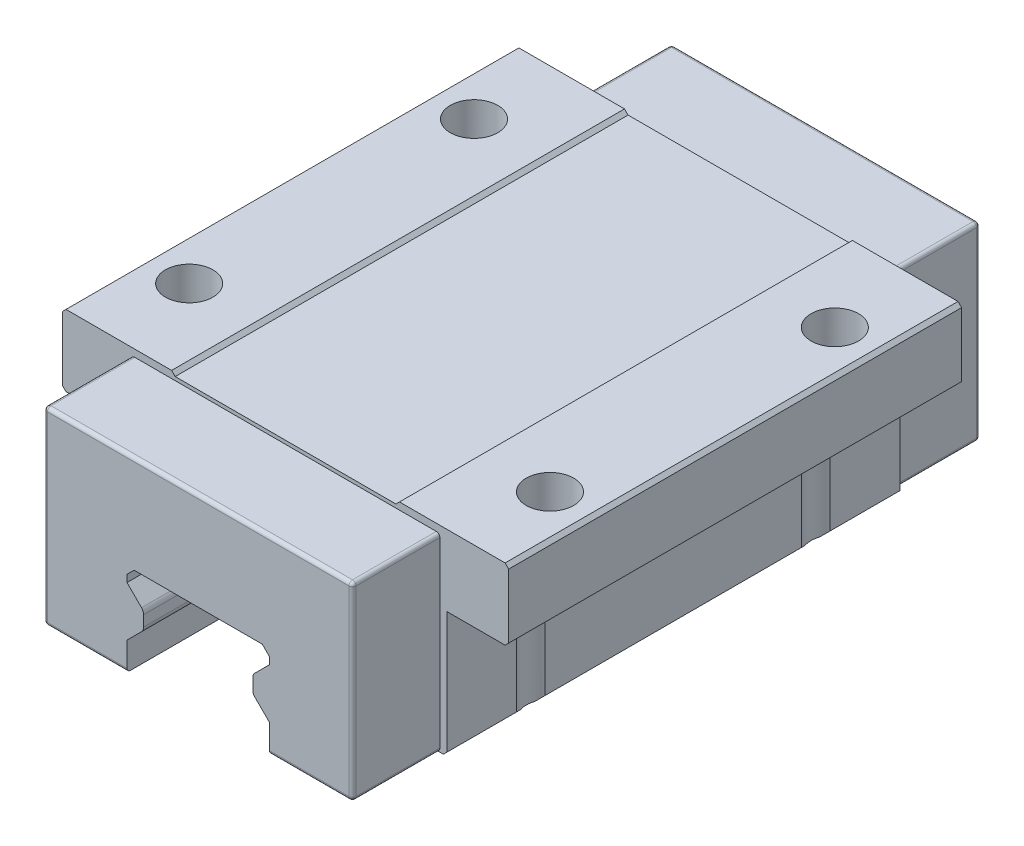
ISO-10303-21;
HEADER;
FILE_DESCRIPTION(('STEP AP214'),'2;1');
FILE_NAME('part.step','',(''),(''),'','','');
FILE_SCHEMA(('AUTOMOTIVE_DESIGN { 1 0 10303 214 1 1 1 1 }'));
ENDSEC;
DATA;
#1=APPLICATION_CONTEXT('core data for automotive mechanical design processes');
#2=APPLICATION_PROTOCOL_DEFINITION('international standard','automotive_design',2000,#1);
#3=PRODUCT_CONTEXT('',#1,'mechanical');
#4=PRODUCT('Part','Part','',(#3));
#5=PRODUCT_RELATED_PRODUCT_CATEGORY('part','',(#4));
#6=PRODUCT_DEFINITION_FORMATION('','',#4);
#7=PRODUCT_DEFINITION_CONTEXT('part definition',#1,'design');
#8=PRODUCT_DEFINITION('design','',#6,#7);
#9=PRODUCT_DEFINITION_SHAPE('','',#8);
#10=(LENGTH_UNIT() NAMED_UNIT(*) SI_UNIT(.MILLI.,.METRE.));
#11=(NAMED_UNIT(*) PLANE_ANGLE_UNIT() SI_UNIT($,.RADIAN.));
#12=(NAMED_UNIT(*) SI_UNIT($,.STERADIAN.) SOLID_ANGLE_UNIT());
#13=UNCERTAINTY_MEASURE_WITH_UNIT(LENGTH_MEASURE(1.E-05),#10,'distance_accuracy_value','');
#14=(GEOMETRIC_REPRESENTATION_CONTEXT(3) GLOBAL_UNCERTAINTY_ASSIGNED_CONTEXT((#13)) GLOBAL_UNIT_ASSIGNED_CONTEXT((#10,
#11,#12)) REPRESENTATION_CONTEXT('',''));
#15=CARTESIAN_POINT('',(0.,0.,0.));
#16=DIRECTION('',(0.,0.,1.));
#17=DIRECTION('',(1.,0.,0.));
#18=AXIS2_PLACEMENT_3D('',#15,#16,#17);
#19=CARTESIAN_POINT('',(-17.,3.29999999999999,23.85));
#20=DIRECTION('',(1.,0.,0.));
#21=DIRECTION('',(0.,0.,-1.));
#22=AXIS2_PLACEMENT_3D('',#19,#20,#21);
#23=PLANE('',#22);
#24=DIRECTION('',(0.,1.,0.));
#25=VECTOR('',#24,1.);
#26=CARTESIAN_POINT('',(-17.,2.99999999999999,-16.5));
#27=LINE('',#26,#25);
#28=CARTESIAN_POINT('',(-17.,16.5,-16.5));
#29=VERTEX_POINT('',#28);
#30=CARTESIAN_POINT('',(-17.,3.67499999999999,-16.5));
#31=VERTEX_POINT('',#30);
#32=EDGE_CURVE('E1801',#29,#31,#27,.F.);
#33=ORIENTED_EDGE('',*,*,#32,.F.);
#34=DIRECTION('',(0.,0.,1.));
#35=VECTOR('',#34,1.);
#36=CARTESIAN_POINT('',(-17.,16.5,23.85));
#37=LINE('',#36,#35);
#38=CARTESIAN_POINT('',(-17.,16.5,-23.85));
#39=VERTEX_POINT('',#38);
#40=EDGE_CURVE('E679',#39,#29,#37,.T.);
#41=ORIENTED_EDGE('',*,*,#40,.F.);
#42=DIRECTION('',(0.,-1.,0.));
#43=VECTOR('',#42,1.);
#44=CARTESIAN_POINT('',(-17.,3.29999999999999,-23.85));
#45=LINE('',#44,#43);
#46=CARTESIAN_POINT('',(-17.,3.67499999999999,-23.85));
#47=VERTEX_POINT('',#46);
#48=EDGE_CURVE('E852',#39,#47,#45,.T.);
#49=ORIENTED_EDGE('',*,*,#48,.T.);
#50=DIRECTION('',(0.,0.,1.));
#51=VECTOR('',#50,1.);
#52=CARTESIAN_POINT('',(-17.,3.67499999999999,23.85));
#53=LINE('',#52,#51);
#54=EDGE_CURVE('E993',#47,#31,#53,.T.);
#55=ORIENTED_EDGE('',*,*,#54,.T.);
#56=EDGE_LOOP('',(#33,#41,#49,#55));
#57=FACE_BOUND('',#56,.T.);
#58=ADVANCED_FACE('F39',(#57),#23,.F.);
#59=DIRECTION('',(0.,1.,0.));
#60=VECTOR('',#59,1.);
#61=CARTESIAN_POINT('',(-17.,2.99999999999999,-13.5));
#62=LINE('',#61,#60);
#63=CARTESIAN_POINT('',(-17.,3.67499999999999,-13.5));
#64=VERTEX_POINT('',#63);
#65=CARTESIAN_POINT('',(-17.,10.375,-13.5));
#66=VERTEX_POINT('',#65);
#67=EDGE_CURVE('E1746',#64,#66,#62,.T.);
#68=ORIENTED_EDGE('',*,*,#67,.F.);
#69=CARTESIAN_POINT('',(-17.,3.67499999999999,13.5));
#70=VERTEX_POINT('',#69);
#71=EDGE_CURVE('E998',#64,#70,#53,.T.);
#72=ORIENTED_EDGE('',*,*,#71,.T.);
#73=DIRECTION('',(0.,1.,0.));
#74=VECTOR('',#73,1.);
#75=CARTESIAN_POINT('',(-17.,2.99999999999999,13.5));
#76=LINE('',#75,#74);
#77=CARTESIAN_POINT('',(-17.,10.375,13.5));
#78=VERTEX_POINT('',#77);
#79=EDGE_CURVE('E1370',#70,#78,#76,.T.);
#80=ORIENTED_EDGE('',*,*,#79,.T.);
#81=DIRECTION('',(0.,0.,-1.));
#82=VECTOR('',#81,1.);
#83=CARTESIAN_POINT('',(-17.,10.375,9.9));
#84=LINE('',#83,#82);
#85=EDGE_CURVE('E709',#78,#66,#84,.T.);
#86=ORIENTED_EDGE('',*,*,#85,.T.);
#87=EDGE_LOOP('',(#68,#72,#80,#86));
#88=FACE_BOUND('',#87,.T.);
#89=ADVANCED_FACE('F648',(#88),#23,.F.);
#90=CARTESIAN_POINT('',(-16.625,3.29999999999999,23.85));
#91=DIRECTION('',(0.707106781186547,0.707106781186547,0.));
#92=DIRECTION('',(0.,0.,-1.));
#93=AXIS2_PLACEMENT_3D('',#90,#91,#92);
#94=PLANE('',#93);
#95=ORIENTED_EDGE('',*,*,#71,.F.);
#96=CARTESIAN_POINT('',(-19.,5.675,-15.));
#97=DIRECTION('',(0.707106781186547,0.707106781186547,0.));
#98=DIRECTION('',(-0.707106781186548,0.707106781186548,0.));
#99=AXIS2_PLACEMENT_3D('',#96,#97,#98);
#100=ELLIPSE('',#99,3.53553390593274,2.5);
#101=CARTESIAN_POINT('',(-16.625,3.29999999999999,-14.2193752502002));
#102=VERTEX_POINT('',#101);
#103=EDGE_CURVE('E1791',#64,#102,#100,.T.);
#104=ORIENTED_EDGE('',*,*,#103,.T.);
#105=DIRECTION('',(0.,0.,-1.));
#106=VECTOR('',#105,1.);
#107=CARTESIAN_POINT('',(-16.625,3.29999999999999,23.85));
#108=LINE('',#107,#106);
#109=CARTESIAN_POINT('',(-16.625,3.29999999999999,14.2193752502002));
#110=VERTEX_POINT('',#109);
#111=EDGE_CURVE('E992',#110,#102,#108,.T.);
#112=ORIENTED_EDGE('',*,*,#111,.F.);
#113=CARTESIAN_POINT('',(-19.,5.675,15.));
#114=DIRECTION('',(0.707106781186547,0.707106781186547,0.));
#115=DIRECTION('',(-0.707106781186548,0.707106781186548,0.));
#116=AXIS2_PLACEMENT_3D('',#113,#114,#115);
#117=ELLIPSE('',#116,3.53553390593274,2.5);
#118=EDGE_CURVE('E1378',#70,#110,#117,.F.);
#119=ORIENTED_EDGE('',*,*,#118,.F.);
#120=EDGE_LOOP('',(#95,#104,#112,#119));
#121=FACE_BOUND('',#120,.T.);
#122=ADVANCED_FACE('F654',(#121),#94,.F.);
#123=CARTESIAN_POINT('',(17.,3.3,23.85));
#124=DIRECTION('',(-1.,0.,0.));
#125=DIRECTION('',(0.,-1.,0.));
#126=AXIS2_PLACEMENT_3D('',#123,#124,#125);
#127=PLANE('',#126);
#128=DIRECTION('',(0.,1.,0.));
#129=VECTOR('',#128,1.);
#130=CARTESIAN_POINT('',(17.,3.,-13.5));
#131=LINE('',#130,#129);
#132=CARTESIAN_POINT('',(17.,10.375,-13.5));
#133=VERTEX_POINT('',#132);
#134=CARTESIAN_POINT('',(17.,3.675,-13.5));
#135=VERTEX_POINT('',#134);
#136=EDGE_CURVE('E553',#133,#135,#131,.F.);
#137=ORIENTED_EDGE('',*,*,#136,.F.);
#138=DIRECTION('',(0.,0.,-1.));
#139=VECTOR('',#138,1.);
#140=CARTESIAN_POINT('',(17.,10.375,9.9));
#141=LINE('',#140,#139);
#142=CARTESIAN_POINT('',(17.,10.375,13.5));
#143=VERTEX_POINT('',#142);
#144=EDGE_CURVE('E551',#143,#133,#141,.T.);
#145=ORIENTED_EDGE('',*,*,#144,.F.);
#146=DIRECTION('',(0.,1.,0.));
#147=VECTOR('',#146,1.);
#148=CARTESIAN_POINT('',(17.,3.,13.5));
#149=LINE('',#148,#147);
#150=CARTESIAN_POINT('',(17.,3.675,13.5));
#151=VERTEX_POINT('',#150);
#152=EDGE_CURVE('E610',#143,#151,#149,.F.);
#153=ORIENTED_EDGE('',*,*,#152,.T.);
#154=DIRECTION('',(0.,0.,-1.));
#155=VECTOR('',#154,1.);
#156=CARTESIAN_POINT('',(17.,3.675,23.85));
#157=LINE('',#156,#155);
#158=EDGE_CURVE('E974',#151,#135,#157,.T.);
#159=ORIENTED_EDGE('',*,*,#158,.T.);
#160=EDGE_LOOP('',(#137,#145,#153,#159));
#161=FACE_BOUND('',#160,.T.);
#162=ADVANCED_FACE('F1776',(#161),#127,.F.);
#163=DIRECTION('',(0.,1.,0.));
#164=VECTOR('',#163,1.);
#165=CARTESIAN_POINT('',(17.,3.,-16.5));
#166=LINE('',#165,#164);
#167=CARTESIAN_POINT('',(17.,3.675,-16.5));
#168=VERTEX_POINT('',#167);
#169=CARTESIAN_POINT('',(17.,16.5,-16.5));
#170=VERTEX_POINT('',#169);
#171=EDGE_CURVE('E1466',#168,#170,#166,.T.);
#172=ORIENTED_EDGE('',*,*,#171,.F.);
#173=CARTESIAN_POINT('',(17.,3.675,-23.85));
#174=VERTEX_POINT('',#173);
#175=EDGE_CURVE('E968',#168,#174,#157,.T.);
#176=ORIENTED_EDGE('',*,*,#175,.T.);
#177=DIRECTION('',(0.,1.,0.));
#178=VECTOR('',#177,1.);
#179=CARTESIAN_POINT('',(17.,3.3,-23.85));
#180=LINE('',#179,#178);
#181=CARTESIAN_POINT('',(17.,16.5,-23.85));
#182=VERTEX_POINT('',#181);
#183=EDGE_CURVE('E828',#174,#182,#180,.T.);
#184=ORIENTED_EDGE('',*,*,#183,.T.);
#185=DIRECTION('',(0.,0.,-1.));
#186=VECTOR('',#185,1.);
#187=CARTESIAN_POINT('',(17.,16.5,23.85));
#188=LINE('',#187,#186);
#189=EDGE_CURVE('E1412',#170,#182,#188,.T.);
#190=ORIENTED_EDGE('',*,*,#189,.F.);
#191=EDGE_LOOP('',(#172,#176,#184,#190));
#192=FACE_BOUND('',#191,.T.);
#193=ADVANCED_FACE('F1811',(#192),#127,.F.);
#194=CARTESIAN_POINT('',(17.,3.675,23.85));
#195=DIRECTION('',(-0.707106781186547,0.707106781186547,0.));
#196=DIRECTION('',(0.,0.,-1.));
#197=AXIS2_PLACEMENT_3D('',#194,#195,#196);
#198=PLANE('',#197);
#199=ORIENTED_EDGE('',*,*,#175,.F.);
#200=CARTESIAN_POINT('',(19.,5.67499999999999,-15.));
#201=DIRECTION('',(-0.707106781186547,0.707106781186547,0.));
#202=DIRECTION('',(0.707106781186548,0.707106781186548,0.));
#203=AXIS2_PLACEMENT_3D('',#200,#201,#202);
#204=ELLIPSE('',#203,3.53553390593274,2.5);
#205=CARTESIAN_POINT('',(16.625,3.3,-15.7806247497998));
#206=VERTEX_POINT('',#205);
#207=EDGE_CURVE('E1744',#168,#206,#204,.T.);
#208=ORIENTED_EDGE('',*,*,#207,.T.);
#209=DIRECTION('',(0.,0.,1.));
#210=VECTOR('',#209,1.);
#211=CARTESIAN_POINT('',(16.625,3.3,23.85));
#212=LINE('',#211,#210);
#213=CARTESIAN_POINT('',(16.625,3.3,-23.85));
#214=VERTEX_POINT('',#213);
#215=EDGE_CURVE('E981',#214,#206,#212,.T.);
#216=ORIENTED_EDGE('',*,*,#215,.F.);
#217=DIRECTION('',(0.707106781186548,0.707106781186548,0.));
#218=VECTOR('',#217,1.);
#219=CARTESIAN_POINT('',(6.6625,-6.6625,-23.85));
#220=LINE('',#219,#218);
#221=EDGE_CURVE('E965',#174,#214,#220,.F.);
#222=ORIENTED_EDGE('',*,*,#221,.F.);
#223=EDGE_LOOP('',(#199,#208,#216,#222));
#224=FACE_BOUND('',#223,.T.);
#225=ADVANCED_FACE('F1355',(#224),#198,.F.);
#226=CARTESIAN_POINT('',(-23.125,10.375,9.9));
#227=DIRECTION('',(0.,0.,-1.));
#228=DIRECTION('',(-1.,0.,0.));
#229=AXIS2_PLACEMENT_3D('',#226,#227,#228);
#230=CYLINDRICAL_SURFACE('',#229,6.125);
#231=CARTESIAN_POINT('',(-21.5,4.46949409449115,-15.));
#232=CARTESIAN_POINT('',(-21.4999946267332,4.46949226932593,-14.8652622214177));
#233=CARTESIAN_POINT('',(-21.4890570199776,4.47247172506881,-14.7303302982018));
#234=CARTESIAN_POINT('',(-21.4456157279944,4.48468700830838,-14.4640611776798));
#235=CARTESIAN_POINT('',(-21.413063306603,4.49393697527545,-14.3327328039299));
#236=CARTESIAN_POINT('',(-21.3275273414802,4.51951557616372,-14.0776759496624));
#237=CARTESIAN_POINT('',(-21.2745542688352,4.53584058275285,-13.9539436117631));
#238=CARTESIAN_POINT('',(-21.1502227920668,4.57671255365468,-13.7176775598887));
#239=CARTESIAN_POINT('',(-21.0788765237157,4.60125409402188,-13.6051365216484));
#240=CARTESIAN_POINT('',(-20.9211612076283,4.65960663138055,-13.3949136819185));
#241=CARTESIAN_POINT('',(-20.8348824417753,4.69336258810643,-13.2971488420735));
#242=CARTESIAN_POINT('',(-20.6506974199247,4.77112454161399,-13.1180592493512));
#243=CARTESIAN_POINT('',(-20.5527910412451,4.81513064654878,-13.0367346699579));
#244=CARTESIAN_POINT('',(-20.3486817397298,4.91417259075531,-12.8912318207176));
#245=CARTESIAN_POINT('',(-20.2424163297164,4.96929751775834,-12.8272024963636));
#246=CARTESIAN_POINT('',(-20.0265825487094,5.09004648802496,-12.7172791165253));
#247=CARTESIAN_POINT('',(-19.9170134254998,5.15567293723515,-12.6713892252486));
#248=CARTESIAN_POINT('',(-19.6896713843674,5.30214712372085,-12.5937772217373));
#249=CARTESIAN_POINT('',(-19.5719352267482,5.38378832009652,-12.5634632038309));
#250=CARTESIAN_POINT('',(-19.3405344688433,5.55687179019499,-12.5205019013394));
#251=CARTESIAN_POINT('',(-19.2268725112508,5.64832027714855,-12.5078658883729));
#252=CARTESIAN_POINT('',(-19.0303364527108,5.81842589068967,-12.4986955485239));
#253=CARTESIAN_POINT('',(-18.946179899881,5.89548582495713,-12.4992361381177));
#254=CARTESIAN_POINT('',(-18.7824956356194,6.05397274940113,-12.5081309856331));
#255=CARTESIAN_POINT('',(-18.7029700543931,6.13540171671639,-12.5164888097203));
#256=CARTESIAN_POINT('',(-18.4718189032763,6.38563167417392,-12.5514593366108));
#257=CARTESIAN_POINT('',(-18.327824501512,6.56019718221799,-12.5879726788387));
#258=CARTESIAN_POINT('',(-18.0966978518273,6.87366877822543,-12.6665867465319));
#259=CARTESIAN_POINT('',(-18.0045305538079,7.00999971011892,-12.7047459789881));
#260=CARTESIAN_POINT('',(-17.8321271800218,7.28827162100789,-12.7874884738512));
#261=CARTESIAN_POINT('',(-17.7518979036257,7.43021573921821,-12.8320753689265));
#262=CARTESIAN_POINT('',(-17.6031800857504,7.71950081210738,-12.9247668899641));
#263=CARTESIAN_POINT('',(-17.5347241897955,7.86685544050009,-12.9728807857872));
#264=CARTESIAN_POINT('',(-17.409748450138,8.16641358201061,-13.0693733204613));
#265=CARTESIAN_POINT('',(-17.3532248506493,8.31861555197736,-13.1177518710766));
#266=CARTESIAN_POINT('',(-17.2640633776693,8.59159506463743,-13.2001944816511));
#267=CARTESIAN_POINT('',(-17.2289338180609,8.71135283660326,-13.2349509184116));
#268=CARTESIAN_POINT('',(-17.1658453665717,8.95380690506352,-13.3006035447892));
#269=CARTESIAN_POINT('',(-17.1378862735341,9.07650311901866,-13.3314998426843));
#270=CARTESIAN_POINT('',(-17.0895443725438,9.32395929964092,-13.3870796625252));
#271=CARTESIAN_POINT('',(-17.0691149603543,9.4487014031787,-13.4118010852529));
#272=CARTESIAN_POINT('',(-17.0359256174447,9.70052982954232,-13.4530288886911));
#273=CARTESIAN_POINT('',(-17.0231621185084,9.82761503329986,-13.4695390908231));
#274=CARTESIAN_POINT('',(-17.0054764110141,10.085230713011,-13.4926511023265));
#275=CARTESIAN_POINT('',(-17.0006767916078,10.2157841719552,-13.4990979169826));
#276=CARTESIAN_POINT('',(-16.9994568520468,10.4769947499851,-13.5007238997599));
#277=CARTESIAN_POINT('',(-17.0030360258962,10.6076518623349,-13.495903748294));
#278=CARTESIAN_POINT('',(-17.0184882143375,10.8682138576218,-13.4756097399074));
#279=CARTESIAN_POINT('',(-17.030399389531,10.9981124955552,-13.4600868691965));
#280=CARTESIAN_POINT('',(-17.0622363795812,11.2555480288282,-13.4202168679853));
#281=CARTESIAN_POINT('',(-17.082165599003,11.3830838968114,-13.395865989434));
#282=CARTESIAN_POINT('',(-17.1368401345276,11.6732499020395,-13.3324071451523));
#283=CARTESIAN_POINT('',(-17.1742398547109,11.8348831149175,-13.2910634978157));
#284=CARTESIAN_POINT('',(-17.2614418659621,12.1530766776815,-13.2024232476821));
#285=CARTESIAN_POINT('',(-17.3112496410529,12.3096347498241,-13.1551240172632));
#286=CARTESIAN_POINT('',(-17.423090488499,12.6179336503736,-13.0586554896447));
#287=CARTESIAN_POINT('',(-17.4851362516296,12.7696692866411,-13.0094842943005));
#288=CARTESIAN_POINT('',(-17.6213479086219,13.0680172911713,-12.9128244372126));
#289=CARTESIAN_POINT('',(-17.6955085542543,13.2146318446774,-12.8653350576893));
#290=CARTESIAN_POINT('',(-17.9004286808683,13.5819889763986,-12.7502545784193));
#291=CARTESIAN_POINT('',(-18.0398775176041,13.79912871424,-12.6859813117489));
#292=CARTESIAN_POINT('',(-18.2709306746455,14.1127074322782,-12.607290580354));
#293=CARTESIAN_POINT('',(-18.3515249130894,14.2151379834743,-12.584024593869));
#294=CARTESIAN_POINT('',(-18.5198286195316,14.4154387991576,-12.5450250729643));
#295=CARTESIAN_POINT('',(-18.6075351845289,14.5133108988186,-12.5292884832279));
#296=CARTESIAN_POINT('',(-18.8263089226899,14.742017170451,-12.5027333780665));
#297=CARTESIAN_POINT('',(-18.9606735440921,14.8703534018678,-12.4964089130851));
#298=CARTESIAN_POINT('',(-19.1700094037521,15.0528507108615,-12.5048106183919));
#299=CARTESIAN_POINT('',(-19.2410743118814,15.1120067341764,-12.5105902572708));
#300=CARTESIAN_POINT('',(-19.3852710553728,15.2266527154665,-12.5287957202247));
#301=CARTESIAN_POINT('',(-19.4584025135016,15.2821433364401,-12.5412203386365));
#302=CARTESIAN_POINT('',(-19.6535302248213,15.4234508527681,-12.5837474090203));
#303=CARTESIAN_POINT('',(-19.7767494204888,15.5058604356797,-12.620078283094));
#304=CARTESIAN_POINT('',(-20.0224899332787,15.6580815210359,-12.7148667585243));
#305=CARTESIAN_POINT('',(-20.1450115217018,15.7278982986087,-12.7733150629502));
#306=CARTESIAN_POINT('',(-20.3844779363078,15.8543803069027,-12.9137180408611));
#307=CARTESIAN_POINT('',(-20.5013865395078,15.9109673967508,-12.9958062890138));
#308=CARTESIAN_POINT('',(-20.7225241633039,16.0104660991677,-13.1823617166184));
#309=CARTESIAN_POINT('',(-20.826756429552,16.0533812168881,-13.2868231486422));
#310=CARTESIAN_POINT('',(-21.0071207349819,16.1229241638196,-13.503565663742));
#311=CARTESIAN_POINT('',(-21.0850275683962,16.1507591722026,-13.6139915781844));
#312=CARTESIAN_POINT('',(-21.2225721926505,16.1975157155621,-13.8473898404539));
#313=CARTESIAN_POINT('',(-21.2822125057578,16.216438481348,-13.9703604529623));
#314=CARTESIAN_POINT('',(-21.3796295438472,16.2462735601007,-14.2220889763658));
#315=CARTESIAN_POINT('',(-21.4179013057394,16.2573689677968,-14.3506342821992));
#316=CARTESIAN_POINT('',(-21.4734220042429,16.2731993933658,-14.6125647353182));
#317=CARTESIAN_POINT('',(-21.4906707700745,16.2779343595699,-14.7459499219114));
#318=CARTESIAN_POINT('',(-21.5036049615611,16.2815008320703,-15.0148619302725));
#319=CARTESIAN_POINT('',(-21.4991248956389,16.2802870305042,-15.1503973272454));
#320=CARTESIAN_POINT('',(-21.4683729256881,16.2717331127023,-15.4187822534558));
#321=CARTESIAN_POINT('',(-21.4421003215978,16.2643927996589,-15.5516316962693));
#322=CARTESIAN_POINT('',(-21.368606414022,16.2428926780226,-15.8111231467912));
#323=CARTESIAN_POINT('',(-21.3213431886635,16.228719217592,-15.9377521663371));
#324=CARTESIAN_POINT('',(-21.2076261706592,16.192460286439,-16.1808408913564));
#325=CARTESIAN_POINT('',(-21.141175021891,16.1703759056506,-16.2973019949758));
#326=CARTESIAN_POINT('',(-20.9923164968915,16.117252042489,-16.5159254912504));
#327=CARTESIAN_POINT('',(-20.9100327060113,16.0862810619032,-16.6181887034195));
#328=CARTESIAN_POINT('',(-20.7326810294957,16.014287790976,-16.806812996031));
#329=CARTESIAN_POINT('',(-20.6376148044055,15.9732668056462,-16.8931761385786));
#330=CARTESIAN_POINT('',(-20.4384829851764,15.8804819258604,-17.0486029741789));
#331=CARTESIAN_POINT('',(-20.3343908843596,15.8286857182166,-17.1176132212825));
#332=CARTESIAN_POINT('',(-20.121733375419,15.7145299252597,-17.2375507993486));
#333=CARTESIAN_POINT('',(-20.0131670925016,15.6521682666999,-17.2884745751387));
#334=CARTESIAN_POINT('',(-19.7883387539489,15.513180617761,-17.3757119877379));
#335=CARTESIAN_POINT('',(-19.6720381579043,15.4358880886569,-17.4108509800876));
#336=CARTESIAN_POINT('',(-19.4424851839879,15.2713943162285,-17.4633502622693));
#337=CARTESIAN_POINT('',(-19.3292347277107,15.1841869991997,-17.4806995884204));
#338=CARTESIAN_POINT('',(-19.1349010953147,15.0232954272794,-17.4977817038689));
#339=CARTESIAN_POINT('',(-19.0526048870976,14.9513681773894,-17.5007363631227));
#340=CARTESIAN_POINT('',(-18.8920051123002,14.8032415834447,-17.4989568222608));
#341=CARTESIAN_POINT('',(-18.8137032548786,14.7270404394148,-17.4942193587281));
#342=CARTESIAN_POINT('',(-18.5854055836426,14.4926754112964,-17.470135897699));
#343=CARTESIAN_POINT('',(-18.4421889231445,14.328892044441,-17.4409085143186));
#344=CARTESIAN_POINT('',(-18.1126469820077,13.9095552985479,-17.3461404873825));
#345=CARTESIAN_POINT('',(-17.9380422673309,13.6472851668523,-17.2699562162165));
#346=CARTESIAN_POINT('',(-17.7089853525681,13.2397651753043,-17.1426490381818));
#347=CARTESIAN_POINT('',(-17.6379936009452,13.1012664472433,-17.0979336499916));
#348=CARTESIAN_POINT('',(-17.5069045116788,12.8197307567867,-17.0067457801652));
#349=CARTESIAN_POINT('',(-17.4468047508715,12.6766948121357,-16.9602736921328));
#350=CARTESIAN_POINT('',(-17.3442078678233,12.4039478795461,-16.8741070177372));
#351=CARTESIAN_POINT('',(-17.3004568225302,12.2747470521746,-16.8342787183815));
#352=CARTESIAN_POINT('',(-17.2214490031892,12.0128095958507,-16.7577765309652));
#353=CARTESIAN_POINT('',(-17.1861932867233,11.8800725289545,-16.7211030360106));
#354=CARTESIAN_POINT('',(-17.1246070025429,11.6118266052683,-16.6537755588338));
#355=CARTESIAN_POINT('',(-17.0982282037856,11.4763371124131,-16.6230894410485));
#356=CARTESIAN_POINT('',(-17.0545384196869,11.2022490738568,-16.5704658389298));
#357=CARTESIAN_POINT('',(-17.0372211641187,11.0636527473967,-16.5485223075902));
#358=CARTESIAN_POINT('',(-17.0146406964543,10.8127314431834,-16.519412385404));
#359=CARTESIAN_POINT('',(-17.0076402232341,10.7008083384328,-16.5101459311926));
#360=CARTESIAN_POINT('',(-16.9998103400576,10.4763722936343,-16.4997625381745));
#361=CARTESIAN_POINT('',(-16.9989798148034,10.3638594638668,-16.4986441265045));
#362=CARTESIAN_POINT('',(-17.0035122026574,10.1390611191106,-16.5046756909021));
#363=CARTESIAN_POINT('',(-17.0088821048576,10.0267760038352,-16.5118349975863));
#364=CARTESIAN_POINT('',(-17.0256999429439,9.80340648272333,-16.5337290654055));
#365=CARTESIAN_POINT('',(-17.0371494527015,9.69232239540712,-16.548465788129));
#366=CARTESIAN_POINT('',(-17.071221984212,9.43132137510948,-16.590849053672));
#367=CARTESIAN_POINT('',(-17.0964083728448,9.28218965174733,-16.6212522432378));
#368=CARTESIAN_POINT('',(-17.1572244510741,8.98795659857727,-16.6900515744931));
#369=CARTESIAN_POINT('',(-17.1928605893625,8.84285781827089,-16.7284526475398));
#370=CARTESIAN_POINT('',(-17.2743950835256,8.55610702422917,-16.8098686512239));
#371=CARTESIAN_POINT('',(-17.3203428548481,8.41447537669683,-16.8529052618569));
#372=CARTESIAN_POINT('',(-17.4222215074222,8.13535497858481,-16.9403931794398));
#373=CARTESIAN_POINT('',(-17.4781500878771,7.9978652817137,-16.9848441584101));
#374=CARTESIAN_POINT('',(-17.6038933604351,7.71831544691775,-17.0753963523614));
#375=CARTESIAN_POINT('',(-17.6743677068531,7.57652601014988,-17.1214210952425));
#376=CARTESIAN_POINT('',(-17.8267301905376,7.29779500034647,-17.2093396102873));
#377=CARTESIAN_POINT('',(-17.9086216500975,7.16085485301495,-17.2512321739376));
#378=CARTESIAN_POINT('',(-18.0834982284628,6.89299729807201,-17.327896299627));
#379=CARTESIAN_POINT('',(-18.1764334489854,6.76205624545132,-17.362698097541));
#380=CARTESIAN_POINT('',(-18.3734749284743,6.50658541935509,-17.4224073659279));
#381=CARTESIAN_POINT('',(-18.4775716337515,6.38205029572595,-17.4473232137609));
#382=CARTESIAN_POINT('',(-18.7112889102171,6.12424161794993,-17.486466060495));
#383=CARTESIAN_POINT('',(-18.8424584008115,5.99205454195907,-17.4987984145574));
#384=CARTESIAN_POINT('',(-19.1164906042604,5.74013122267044,-17.5010330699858));
#385=CARTESIAN_POINT('',(-19.2593413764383,5.62038254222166,-17.4909580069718));
#386=CARTESIAN_POINT('',(-19.5293947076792,5.41401654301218,-17.4464971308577));
#387=CARTESIAN_POINT('',(-19.6555101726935,5.32515282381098,-17.4161977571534));
#388=CARTESIAN_POINT('',(-19.8452806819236,5.20152734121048,-17.3537106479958));
#389=CARTESIAN_POINT('',(-19.908660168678,5.16191791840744,-17.3300302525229));
#390=CARTESIAN_POINT('',(-20.0349415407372,5.08608986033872,-17.2767487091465));
#391=CARTESIAN_POINT('',(-20.0978436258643,5.04986972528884,-17.2471501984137));
#392=CARTESIAN_POINT('',(-20.2228921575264,4.98069343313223,-17.181640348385));
#393=CARTESIAN_POINT('',(-20.2850293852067,4.94776382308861,-17.1456832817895));
#394=CARTESIAN_POINT('',(-20.407197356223,4.88556743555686,-17.0676188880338));
#395=CARTESIAN_POINT('',(-20.4672290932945,4.85629891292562,-17.0255145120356));
#396=CARTESIAN_POINT('',(-20.5843542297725,4.80140808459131,-16.9352731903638));
#397=CARTESIAN_POINT('',(-20.6414479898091,4.7757853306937,-16.8871369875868));
#398=CARTESIAN_POINT('',(-20.7518425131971,4.72810988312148,-16.7851347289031));
#399=CARTESIAN_POINT('',(-20.8051437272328,4.70605676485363,-16.7312693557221));
#400=CARTESIAN_POINT('',(-20.9459475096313,4.64990757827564,-16.5751803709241));
#401=CARTESIAN_POINT('',(-21.0287125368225,4.61937095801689,-16.4672769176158));
#402=CARTESIAN_POINT('',(-21.1763290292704,4.56772234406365,-16.2378340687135));
#403=CARTESIAN_POINT('',(-21.2411742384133,4.54661364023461,-16.1162899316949));
#404=CARTESIAN_POINT('',(-21.348469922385,4.51303570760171,-15.8674404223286));
#405=CARTESIAN_POINT('',(-21.3915877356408,4.5003047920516,-15.7404567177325));
#406=CARTESIAN_POINT('',(-21.4569299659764,4.48141504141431,-15.4809671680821));
#407=CARTESIAN_POINT('',(-21.4792016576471,4.47524133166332,-15.3484745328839));
#408=CARTESIAN_POINT('',(-21.4938149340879,4.47119946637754,-15.1793980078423));
#409=CARTESIAN_POINT('',(-21.4961326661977,4.47055938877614,-15.1435643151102));
#410=CARTESIAN_POINT('',(-21.4992259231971,4.46970694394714,-15.0718250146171));
#411=CARTESIAN_POINT('',(-21.5000014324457,4.46949458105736,-15.0359194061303));
#412=CARTESIAN_POINT('',(-21.5,4.46949409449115,-15.));
#413=B_SPLINE_CURVE_WITH_KNOTS('',3,(#231,#232,#233,#234,#235,#236,#237,#238,#239,#240,#241,
#242,#243,#244,#245,#246,#247,#248,#249,#250,#251,#252,#253,#254,#255,#256,#257,#258,#259,#260,
#261,#262,#263,#264,#265,#266,#267,#268,#269,#270,#271,#272,#273,#274,#275,#276,#277,#278,#279,
#280,#281,#282,#283,#284,#285,#286,#287,#288,#289,#290,#291,#292,#293,#294,#295,#296,#297,#298,
#299,#300,#301,#302,#303,#304,#305,#306,#307,#308,#309,#310,#311,#312,#313,#314,#315,#316,#317,
#318,#319,#320,#321,#322,#323,#324,#325,#326,#327,#328,#329,#330,#331,#332,#333,#334,#335,#336,
#337,#338,#339,#340,#341,#342,#343,#344,#345,#346,#347,#348,#349,#350,#351,#352,#353,#354,#355,
#356,#357,#358,#359,#360,#361,#362,#363,#364,#365,#366,#367,#368,#369,#370,#371,#372,#373,#374,
#375,#376,#377,#378,#379,#380,#381,#382,#383,#384,#385,#386,#387,#388,#389,#390,#391,#392,#393,
#394,#395,#396,#397,#398,#399,#400,#401,#402,#403,#404,#405,#406,#407,#408,#409,#410,#411,#412),
.UNSPECIFIED.,.T.,.F.,(4,2,2,2,2,2,2,2,2,2,2,2,2,2,2,2,2,2,2,2,2,2,2,2,2,2,2,2,2,2,2,2,2,2,2,2,
2,2,2,2,2,2,2,2,2,2,2,2,2,2,2,2,2,2,2,2,2,2,2,2,2,2,2,2,2,2,2,2,2,2,2,2,2,2,2,2,2,2,2,2,2,2,2,2,
2,2,2,2,2,2,4),(0.,0.404076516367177,0.809067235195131,1.21385056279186,1.6183672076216,
2.02051852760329,2.4226740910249,2.82818990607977,3.23379876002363,3.67149692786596,
4.10947404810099,4.45133304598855,4.79334807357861,5.47818500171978,5.98439453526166,
6.49089128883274,6.99877058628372,7.50648978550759,7.89490564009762,8.28331059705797,
8.66926949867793,9.05504861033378,9.44671278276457,9.83835330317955,10.2317993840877,
10.6254127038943,11.1375548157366,11.6499236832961,12.1628266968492,12.6755081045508,
13.4702957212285,13.8670817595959,14.2637066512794,14.8191845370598,15.0968355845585,
15.3744362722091,15.8302942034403,16.2859607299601,16.7442542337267,17.2024301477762,
17.6143338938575,18.026180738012,18.4280420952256,18.8299067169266,19.2348368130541,
19.6397799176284,20.0455354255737,20.4512350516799,20.8538877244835,21.2564881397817,
21.6603137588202,22.0642187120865,22.4945643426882,22.925175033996,23.2527529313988,
23.5804698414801,24.2365634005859,25.203480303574,25.6889853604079,26.1743822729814,
26.6004067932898,27.0264843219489,27.4502079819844,27.8736380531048,28.2107807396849,
28.5478624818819,28.8853245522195,29.2228740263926,29.6848947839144,30.1472012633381,
30.6117724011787,31.0762365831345,31.5704283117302,32.0647641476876,32.556945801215,
33.048709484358,33.6067923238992,34.1643116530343,34.6338681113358,34.8688168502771,
35.1036611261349,35.3402685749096,35.5767628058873,35.8132279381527,36.0496649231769,
36.4655097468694,36.8814995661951,37.2837863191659,37.685158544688,37.7928791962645,
37.9006009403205),.UNSPECIFIED.);
#414=CARTESIAN_POINT('',(-17.0232323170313,10.9079691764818,-13.4695133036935));
#415=VERTEX_POINT('',#414);
#416=EDGE_CURVE('E55',#66,#415,#413,.T.);
#417=ORIENTED_EDGE('',*,*,#416,.F.);
#418=ORIENTED_EDGE('',*,*,#85,.F.);
#419=CARTESIAN_POINT('',(-21.5,4.46949409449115,15.));
#420=CARTESIAN_POINT('',(-21.4999946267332,4.46949226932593,14.8652622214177));
#421=CARTESIAN_POINT('',(-21.4890570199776,4.47247172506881,14.7303302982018));
#422=CARTESIAN_POINT('',(-21.4456157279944,4.48468700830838,14.4640611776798));
#423=CARTESIAN_POINT('',(-21.413063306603,4.49393697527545,14.3327328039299));
#424=CARTESIAN_POINT('',(-21.3275273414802,4.51951557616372,14.0776759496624));
#425=CARTESIAN_POINT('',(-21.2745542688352,4.53584058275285,13.9539436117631));
#426=CARTESIAN_POINT('',(-21.1502227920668,4.57671255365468,13.7176775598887));
#427=CARTESIAN_POINT('',(-21.0788765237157,4.60125409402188,13.6051365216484));
#428=CARTESIAN_POINT('',(-20.9211612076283,4.65960663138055,13.3949136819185));
#429=CARTESIAN_POINT('',(-20.8348824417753,4.69336258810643,13.2971488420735));
#430=CARTESIAN_POINT('',(-20.6506974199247,4.77112454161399,13.1180592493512));
#431=CARTESIAN_POINT('',(-20.5527910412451,4.81513064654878,13.0367346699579));
#432=CARTESIAN_POINT('',(-20.3486817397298,4.91417259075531,12.8912318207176));
#433=CARTESIAN_POINT('',(-20.2424163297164,4.96929751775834,12.8272024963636));
#434=CARTESIAN_POINT('',(-20.0265825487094,5.09004648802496,12.7172791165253));
#435=CARTESIAN_POINT('',(-19.9170134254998,5.15567293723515,12.6713892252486));
#436=CARTESIAN_POINT('',(-19.6896713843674,5.30214712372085,12.5937772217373));
#437=CARTESIAN_POINT('',(-19.5719352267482,5.38378832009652,12.5634632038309));
#438=CARTESIAN_POINT('',(-19.3405344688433,5.55687179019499,12.5205019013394));
#439=CARTESIAN_POINT('',(-19.2268725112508,5.64832027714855,12.5078658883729));
#440=CARTESIAN_POINT('',(-19.0303364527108,5.81842589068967,12.4986955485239));
#441=CARTESIAN_POINT('',(-18.946179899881,5.89548582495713,12.4992361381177));
#442=CARTESIAN_POINT('',(-18.7824956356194,6.05397274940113,12.5081309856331));
#443=CARTESIAN_POINT('',(-18.7029700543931,6.13540171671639,12.5164888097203));
#444=CARTESIAN_POINT('',(-18.4718189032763,6.38563167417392,12.5514593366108));
#445=CARTESIAN_POINT('',(-18.327824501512,6.56019718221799,12.5879726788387));
#446=CARTESIAN_POINT('',(-18.0966978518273,6.87366877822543,12.6665867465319));
#447=CARTESIAN_POINT('',(-18.0045305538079,7.00999971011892,12.7047459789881));
#448=CARTESIAN_POINT('',(-17.8321271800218,7.28827162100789,12.7874884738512));
#449=CARTESIAN_POINT('',(-17.7518979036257,7.43021573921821,12.8320753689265));
#450=CARTESIAN_POINT('',(-17.6031800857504,7.71950081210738,12.9247668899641));
#451=CARTESIAN_POINT('',(-17.5347241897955,7.86685544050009,12.9728807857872));
#452=CARTESIAN_POINT('',(-17.409748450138,8.16641358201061,13.0693733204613));
#453=CARTESIAN_POINT('',(-17.3532248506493,8.31861555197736,13.1177518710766));
#454=CARTESIAN_POINT('',(-17.2640633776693,8.59159506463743,13.2001944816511));
#455=CARTESIAN_POINT('',(-17.2289338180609,8.71135283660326,13.2349509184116));
#456=CARTESIAN_POINT('',(-17.1658453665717,8.95380690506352,13.3006035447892));
#457=CARTESIAN_POINT('',(-17.1378862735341,9.07650311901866,13.3314998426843));
#458=CARTESIAN_POINT('',(-17.0895443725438,9.32395929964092,13.3870796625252));
#459=CARTESIAN_POINT('',(-17.0691149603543,9.4487014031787,13.4118010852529));
#460=CARTESIAN_POINT('',(-17.0359256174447,9.70052982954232,13.4530288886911));
#461=CARTESIAN_POINT('',(-17.0231621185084,9.82761503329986,13.4695390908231));
#462=CARTESIAN_POINT('',(-17.0054764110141,10.085230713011,13.4926511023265));
#463=CARTESIAN_POINT('',(-17.0006767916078,10.2157841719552,13.4990979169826));
#464=CARTESIAN_POINT('',(-16.9994568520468,10.4769947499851,13.5007238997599));
#465=CARTESIAN_POINT('',(-17.0030360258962,10.6076518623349,13.495903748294));
#466=CARTESIAN_POINT('',(-17.0184882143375,10.8682138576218,13.4756097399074));
#467=CARTESIAN_POINT('',(-17.030399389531,10.9981124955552,13.4600868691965));
#468=CARTESIAN_POINT('',(-17.0622363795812,11.2555480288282,13.4202168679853));
#469=CARTESIAN_POINT('',(-17.082165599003,11.3830838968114,13.395865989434));
#470=CARTESIAN_POINT('',(-17.1368401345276,11.6732499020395,13.3324071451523));
#471=CARTESIAN_POINT('',(-17.1742398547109,11.8348831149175,13.2910634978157));
#472=CARTESIAN_POINT('',(-17.2614418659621,12.1530766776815,13.2024232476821));
#473=CARTESIAN_POINT('',(-17.3112496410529,12.3096347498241,13.1551240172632));
#474=CARTESIAN_POINT('',(-17.423090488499,12.6179336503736,13.0586554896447));
#475=CARTESIAN_POINT('',(-17.4851362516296,12.7696692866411,13.0094842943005));
#476=CARTESIAN_POINT('',(-17.6213479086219,13.0680172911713,12.9128244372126));
#477=CARTESIAN_POINT('',(-17.6955085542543,13.2146318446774,12.8653350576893));
#478=CARTESIAN_POINT('',(-17.9004286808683,13.5819889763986,12.7502545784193));
#479=CARTESIAN_POINT('',(-18.0398775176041,13.79912871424,12.6859813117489));
#480=CARTESIAN_POINT('',(-18.2709306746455,14.1127074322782,12.607290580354));
#481=CARTESIAN_POINT('',(-18.3515249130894,14.2151379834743,12.584024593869));
#482=CARTESIAN_POINT('',(-18.5198286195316,14.4154387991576,12.5450250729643));
#483=CARTESIAN_POINT('',(-18.6075351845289,14.5133108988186,12.5292884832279));
#484=CARTESIAN_POINT('',(-18.8263089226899,14.742017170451,12.5027333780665));
#485=CARTESIAN_POINT('',(-18.9606735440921,14.8703534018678,12.4964089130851));
#486=CARTESIAN_POINT('',(-19.1700094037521,15.0528507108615,12.5048106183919));
#487=CARTESIAN_POINT('',(-19.2410743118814,15.1120067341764,12.5105902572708));
#488=CARTESIAN_POINT('',(-19.3852710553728,15.2266527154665,12.5287957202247));
#489=CARTESIAN_POINT('',(-19.4584025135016,15.2821433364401,12.5412203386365));
#490=CARTESIAN_POINT('',(-19.6535302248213,15.4234508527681,12.5837474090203));
#491=CARTESIAN_POINT('',(-19.7767494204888,15.5058604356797,12.620078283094));
#492=CARTESIAN_POINT('',(-20.0224899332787,15.6580815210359,12.7148667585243));
#493=CARTESIAN_POINT('',(-20.1450115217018,15.7278982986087,12.7733150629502));
#494=CARTESIAN_POINT('',(-20.3844779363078,15.8543803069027,12.9137180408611));
#495=CARTESIAN_POINT('',(-20.5013865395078,15.9109673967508,12.9958062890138));
#496=CARTESIAN_POINT('',(-20.7225241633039,16.0104660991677,13.1823617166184));
#497=CARTESIAN_POINT('',(-20.826756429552,16.0533812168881,13.2868231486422));
#498=CARTESIAN_POINT('',(-21.0071207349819,16.1229241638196,13.503565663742));
#499=CARTESIAN_POINT('',(-21.0850275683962,16.1507591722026,13.6139915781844));
#500=CARTESIAN_POINT('',(-21.2225721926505,16.1975157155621,13.8473898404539));
#501=CARTESIAN_POINT('',(-21.2822125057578,16.216438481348,13.9703604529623));
#502=CARTESIAN_POINT('',(-21.3796295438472,16.2462735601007,14.2220889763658));
#503=CARTESIAN_POINT('',(-21.4179013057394,16.2573689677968,14.3506342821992));
#504=CARTESIAN_POINT('',(-21.4734220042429,16.2731993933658,14.6125647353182));
#505=CARTESIAN_POINT('',(-21.4906707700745,16.2779343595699,14.7459499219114));
#506=CARTESIAN_POINT('',(-21.5036049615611,16.2815008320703,15.0148619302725));
#507=CARTESIAN_POINT('',(-21.4991248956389,16.2802870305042,15.1503973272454));
#508=CARTESIAN_POINT('',(-21.4683729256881,16.2717331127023,15.4187822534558));
#509=CARTESIAN_POINT('',(-21.4421003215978,16.2643927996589,15.5516316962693));
#510=CARTESIAN_POINT('',(-21.368606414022,16.2428926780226,15.8111231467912));
#511=CARTESIAN_POINT('',(-21.3213431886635,16.228719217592,15.9377521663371));
#512=CARTESIAN_POINT('',(-21.2076261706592,16.192460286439,16.1808408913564));
#513=CARTESIAN_POINT('',(-21.141175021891,16.1703759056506,16.2973019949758));
#514=CARTESIAN_POINT('',(-20.9923164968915,16.117252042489,16.5159254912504));
#515=CARTESIAN_POINT('',(-20.9100327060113,16.0862810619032,16.6181887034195));
#516=CARTESIAN_POINT('',(-20.7326810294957,16.014287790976,16.806812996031));
#517=CARTESIAN_POINT('',(-20.6376148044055,15.9732668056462,16.8931761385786));
#518=CARTESIAN_POINT('',(-20.4384829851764,15.8804819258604,17.0486029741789));
#519=CARTESIAN_POINT('',(-20.3343908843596,15.8286857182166,17.1176132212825));
#520=CARTESIAN_POINT('',(-20.121733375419,15.7145299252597,17.2375507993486));
#521=CARTESIAN_POINT('',(-20.0131670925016,15.6521682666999,17.2884745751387));
#522=CARTESIAN_POINT('',(-19.7883387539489,15.513180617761,17.3757119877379));
#523=CARTESIAN_POINT('',(-19.6720381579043,15.4358880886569,17.4108509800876));
#524=CARTESIAN_POINT('',(-19.4424851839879,15.2713943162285,17.4633502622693));
#525=CARTESIAN_POINT('',(-19.3292347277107,15.1841869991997,17.4806995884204));
#526=CARTESIAN_POINT('',(-19.1349010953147,15.0232954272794,17.4977817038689));
#527=CARTESIAN_POINT('',(-19.0526048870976,14.9513681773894,17.5007363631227));
#528=CARTESIAN_POINT('',(-18.8920051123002,14.8032415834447,17.4989568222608));
#529=CARTESIAN_POINT('',(-18.8137032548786,14.7270404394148,17.4942193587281));
#530=CARTESIAN_POINT('',(-18.5854055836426,14.4926754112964,17.470135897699));
#531=CARTESIAN_POINT('',(-18.4421889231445,14.328892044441,17.4409085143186));
#532=CARTESIAN_POINT('',(-18.1126469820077,13.9095552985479,17.3461404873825));
#533=CARTESIAN_POINT('',(-17.9380422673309,13.6472851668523,17.2699562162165));
#534=CARTESIAN_POINT('',(-17.7089853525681,13.2397651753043,17.1426490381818));
#535=CARTESIAN_POINT('',(-17.6379936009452,13.1012664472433,17.0979336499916));
#536=CARTESIAN_POINT('',(-17.5069045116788,12.8197307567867,17.0067457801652));
#537=CARTESIAN_POINT('',(-17.4468047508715,12.6766948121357,16.9602736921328));
#538=CARTESIAN_POINT('',(-17.3442078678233,12.4039478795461,16.8741070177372));
#539=CARTESIAN_POINT('',(-17.3004568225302,12.2747470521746,16.8342787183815));
#540=CARTESIAN_POINT('',(-17.2214490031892,12.0128095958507,16.7577765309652));
#541=CARTESIAN_POINT('',(-17.1861932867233,11.8800725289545,16.7211030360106));
#542=CARTESIAN_POINT('',(-17.1246070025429,11.6118266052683,16.6537755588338));
#543=CARTESIAN_POINT('',(-17.0982282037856,11.4763371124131,16.6230894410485));
#544=CARTESIAN_POINT('',(-17.0545384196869,11.2022490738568,16.5704658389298));
#545=CARTESIAN_POINT('',(-17.0372211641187,11.0636527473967,16.5485223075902));
#546=CARTESIAN_POINT('',(-17.0146406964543,10.8127314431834,16.519412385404));
#547=CARTESIAN_POINT('',(-17.0076402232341,10.7008083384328,16.5101459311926));
#548=CARTESIAN_POINT('',(-16.9998103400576,10.4763722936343,16.4997625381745));
#549=CARTESIAN_POINT('',(-16.9989798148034,10.3638594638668,16.4986441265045));
#550=CARTESIAN_POINT('',(-17.0035122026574,10.1390611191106,16.5046756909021));
#551=CARTESIAN_POINT('',(-17.0088821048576,10.0267760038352,16.5118349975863));
#552=CARTESIAN_POINT('',(-17.0256999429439,9.80340648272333,16.5337290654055));
#553=CARTESIAN_POINT('',(-17.0371494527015,9.69232239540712,16.548465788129));
#554=CARTESIAN_POINT('',(-17.071221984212,9.43132137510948,16.590849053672));
#555=CARTESIAN_POINT('',(-17.0964083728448,9.28218965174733,16.6212522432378));
#556=CARTESIAN_POINT('',(-17.1572244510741,8.98795659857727,16.6900515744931));
#557=CARTESIAN_POINT('',(-17.1928605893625,8.84285781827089,16.7284526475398));
#558=CARTESIAN_POINT('',(-17.2743950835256,8.55610702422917,16.8098686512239));
#559=CARTESIAN_POINT('',(-17.3203428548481,8.41447537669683,16.8529052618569));
#560=CARTESIAN_POINT('',(-17.4222215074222,8.13535497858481,16.9403931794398));
#561=CARTESIAN_POINT('',(-17.4781500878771,7.9978652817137,16.9848441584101));
#562=CARTESIAN_POINT('',(-17.6038933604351,7.71831544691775,17.0753963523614));
#563=CARTESIAN_POINT('',(-17.6743677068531,7.57652601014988,17.1214210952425));
#564=CARTESIAN_POINT('',(-17.8267301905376,7.29779500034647,17.2093396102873));
#565=CARTESIAN_POINT('',(-17.9086216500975,7.16085485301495,17.2512321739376));
#566=CARTESIAN_POINT('',(-18.0834982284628,6.89299729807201,17.327896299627));
#567=CARTESIAN_POINT('',(-18.1764334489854,6.76205624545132,17.362698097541));
#568=CARTESIAN_POINT('',(-18.3734749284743,6.50658541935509,17.4224073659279));
#569=CARTESIAN_POINT('',(-18.4775716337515,6.38205029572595,17.4473232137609));
#570=CARTESIAN_POINT('',(-18.7112889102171,6.12424161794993,17.486466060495));
#571=CARTESIAN_POINT('',(-18.8424584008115,5.99205454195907,17.4987984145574));
#572=CARTESIAN_POINT('',(-19.1164906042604,5.74013122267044,17.5010330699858));
#573=CARTESIAN_POINT('',(-19.2593413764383,5.62038254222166,17.4909580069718));
#574=CARTESIAN_POINT('',(-19.5293947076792,5.41401654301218,17.4464971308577));
#575=CARTESIAN_POINT('',(-19.6555101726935,5.32515282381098,17.4161977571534));
#576=CARTESIAN_POINT('',(-19.8452806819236,5.20152734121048,17.3537106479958));
#577=CARTESIAN_POINT('',(-19.908660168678,5.16191791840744,17.3300302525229));
#578=CARTESIAN_POINT('',(-20.0349415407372,5.08608986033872,17.2767487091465));
#579=CARTESIAN_POINT('',(-20.0978436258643,5.04986972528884,17.2471501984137));
#580=CARTESIAN_POINT('',(-20.2228921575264,4.98069343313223,17.181640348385));
#581=CARTESIAN_POINT('',(-20.2850293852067,4.94776382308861,17.1456832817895));
#582=CARTESIAN_POINT('',(-20.407197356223,4.88556743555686,17.0676188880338));
#583=CARTESIAN_POINT('',(-20.4672290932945,4.85629891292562,17.0255145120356));
#584=CARTESIAN_POINT('',(-20.5843542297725,4.80140808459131,16.9352731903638));
#585=CARTESIAN_POINT('',(-20.6414479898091,4.7757853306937,16.8871369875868));
#586=CARTESIAN_POINT('',(-20.7518425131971,4.72810988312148,16.7851347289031));
#587=CARTESIAN_POINT('',(-20.8051437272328,4.70605676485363,16.7312693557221));
#588=CARTESIAN_POINT('',(-20.9459475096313,4.64990757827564,16.5751803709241));
#589=CARTESIAN_POINT('',(-21.0287125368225,4.61937095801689,16.4672769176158));
#590=CARTESIAN_POINT('',(-21.1763290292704,4.56772234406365,16.2378340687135));
#591=CARTESIAN_POINT('',(-21.2411742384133,4.54661364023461,16.1162899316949));
#592=CARTESIAN_POINT('',(-21.348469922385,4.51303570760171,15.8674404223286));
#593=CARTESIAN_POINT('',(-21.3915877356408,4.5003047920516,15.7404567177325));
#594=CARTESIAN_POINT('',(-21.4569299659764,4.48141504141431,15.4809671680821));
#595=CARTESIAN_POINT('',(-21.4792016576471,4.47524133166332,15.3484745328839));
#596=CARTESIAN_POINT('',(-21.4938149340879,4.47119946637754,15.1793980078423));
#597=CARTESIAN_POINT('',(-21.4961326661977,4.47055938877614,15.1435643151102));
#598=CARTESIAN_POINT('',(-21.4992259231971,4.46970694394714,15.0718250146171));
#599=CARTESIAN_POINT('',(-21.5000014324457,4.46949458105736,15.0359194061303));
#600=CARTESIAN_POINT('',(-21.5,4.46949409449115,15.));
#601=B_SPLINE_CURVE_WITH_KNOTS('',3,(#419,#420,#421,#422,#423,#424,#425,#426,#427,#428,#429,
#430,#431,#432,#433,#434,#435,#436,#437,#438,#439,#440,#441,#442,#443,#444,#445,#446,#447,#448,
#449,#450,#451,#452,#453,#454,#455,#456,#457,#458,#459,#460,#461,#462,#463,#464,#465,#466,#467,
#468,#469,#470,#471,#472,#473,#474,#475,#476,#477,#478,#479,#480,#481,#482,#483,#484,#485,#486,
#487,#488,#489,#490,#491,#492,#493,#494,#495,#496,#497,#498,#499,#500,#501,#502,#503,#504,#505,
#506,#507,#508,#509,#510,#511,#512,#513,#514,#515,#516,#517,#518,#519,#520,#521,#522,#523,#524,
#525,#526,#527,#528,#529,#530,#531,#532,#533,#534,#535,#536,#537,#538,#539,#540,#541,#542,#543,
#544,#545,#546,#547,#548,#549,#550,#551,#552,#553,#554,#555,#556,#557,#558,#559,#560,#561,#562,
#563,#564,#565,#566,#567,#568,#569,#570,#571,#572,#573,#574,#575,#576,#577,#578,#579,#580,#581,
#582,#583,#584,#585,#586,#587,#588,#589,#590,#591,#592,#593,#594,#595,#596,#597,#598,#599,#600),
.UNSPECIFIED.,.T.,.F.,(4,2,2,2,2,2,2,2,2,2,2,2,2,2,2,2,2,2,2,2,2,2,2,2,2,2,2,2,2,2,2,2,2,2,2,2,
2,2,2,2,2,2,2,2,2,2,2,2,2,2,2,2,2,2,2,2,2,2,2,2,2,2,2,2,2,2,2,2,2,2,2,2,2,2,2,2,2,2,2,2,2,2,2,2,
2,2,2,2,2,2,4),(0.,0.404076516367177,0.809067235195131,1.21385056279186,1.6183672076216,
2.02051852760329,2.4226740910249,2.82818990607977,3.23379876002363,3.67149692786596,
4.10947404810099,4.45133304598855,4.79334807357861,5.47818500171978,5.98439453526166,
6.49089128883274,6.99877058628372,7.50648978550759,7.89490564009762,8.28331059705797,
8.66926949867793,9.05504861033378,9.44671278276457,9.83835330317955,10.2317993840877,
10.6254127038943,11.1375548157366,11.6499236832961,12.1628266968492,12.6755081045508,
13.4702957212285,13.8670817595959,14.2637066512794,14.8191845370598,15.0968355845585,
15.3744362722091,15.8302942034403,16.2859607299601,16.7442542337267,17.2024301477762,
17.6143338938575,18.026180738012,18.4280420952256,18.8299067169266,19.2348368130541,
19.6397799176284,20.0455354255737,20.4512350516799,20.8538877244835,21.2564881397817,
21.6603137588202,22.0642187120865,22.4945643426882,22.925175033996,23.2527529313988,
23.5804698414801,24.2365634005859,25.203480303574,25.6889853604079,26.1743822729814,
26.6004067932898,27.0264843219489,27.4502079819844,27.8736380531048,28.2107807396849,
28.5478624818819,28.8853245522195,29.2228740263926,29.6848947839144,30.1472012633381,
30.6117724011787,31.0762365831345,31.5704283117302,32.0647641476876,32.556945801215,
33.048709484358,33.6067923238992,34.1643116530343,34.6338681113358,34.8688168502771,
35.1036611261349,35.3402685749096,35.5767628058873,35.8132279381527,36.0496649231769,
36.4655097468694,36.8814995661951,37.2837863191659,37.685158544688,37.7928791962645,
37.9006009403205),.UNSPECIFIED.);
#602=CARTESIAN_POINT('',(-17.0232323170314,10.9079691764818,13.4695133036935));
#603=VERTEX_POINT('',#602);
#604=EDGE_CURVE('E1363',#78,#603,#601,.T.);
#605=ORIENTED_EDGE('',*,*,#604,.T.);
#606=CARTESIAN_POINT('',(-21.,16.119562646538,9.9));
#607=CARTESIAN_POINT('',(-20.8861084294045,16.0774631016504,9.89998326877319));
#608=CARTESIAN_POINT('',(-20.7735535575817,16.0319483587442,9.90486217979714));
#609=CARTESIAN_POINT('',(-20.5521237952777,15.934715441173,9.9236079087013));
#610=CARTESIAN_POINT('',(-20.4432434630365,15.8830070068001,9.93746076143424));
#611=CARTESIAN_POINT('',(-20.2308892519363,15.7744310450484,9.97317444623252));
#612=CARTESIAN_POINT('',(-20.1273718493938,15.7176209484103,9.99495291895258));
#613=CARTESIAN_POINT('',(-19.9250619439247,15.598961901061,10.0457310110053));
#614=CARTESIAN_POINT('',(-19.8262717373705,15.5371105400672,10.0747340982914));
#615=CARTESIAN_POINT('',(-19.6112880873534,15.393944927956,10.146712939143));
#616=CARTESIAN_POINT('',(-19.496433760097,15.3114637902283,10.1913702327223));
#617=CARTESIAN_POINT('',(-19.2748549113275,15.1406688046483,10.289106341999));
#618=CARTESIAN_POINT('',(-19.1681362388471,15.0523508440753,10.3421911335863));
#619=CARTESIAN_POINT('',(-18.9626031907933,14.8704408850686,10.4557503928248));
#620=CARTESIAN_POINT('',(-18.8638229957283,14.7768287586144,10.5162542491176));
#621=CARTESIAN_POINT('',(-18.6746502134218,14.5854764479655,10.6433558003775));
#622=CARTESIAN_POINT('',(-18.584255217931,14.4877374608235,10.7099517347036));
#623=CARTESIAN_POINT('',(-18.378046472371,14.2499900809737,10.8752711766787));
#624=CARTESIAN_POINT('',(-18.2660434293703,14.1083438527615,10.9764062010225));
#625=CARTESIAN_POINT('',(-18.0573391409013,13.8197315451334,11.1865720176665));
#626=CARTESIAN_POINT('',(-17.9606436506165,13.6727634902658,11.2956057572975));
#627=CARTESIAN_POINT('',(-17.7819206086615,13.3745608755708,11.5199687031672));
#628=CARTESIAN_POINT('',(-17.6999058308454,13.2233227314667,11.6353032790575));
#629=CARTESIAN_POINT('',(-17.5501035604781,12.9176610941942,11.8707909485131));
#630=CARTESIAN_POINT('',(-17.4823148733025,12.7632378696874,11.9909436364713));
#631=CARTESIAN_POINT('',(-17.3505154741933,12.4265231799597,12.2548795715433));
#632=CARTESIAN_POINT('',(-17.2889249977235,12.2437949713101,12.3993202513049));
#633=CARTESIAN_POINT('',(-17.1836961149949,11.876048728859,12.6917007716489));
#634=CARTESIAN_POINT('',(-17.1400627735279,11.6910300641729,12.839641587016));
#635=CARTESIAN_POINT('',(-17.03559063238,11.1345316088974,13.2862127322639));
#636=CARTESIAN_POINT('',(-17.0007537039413,10.7604957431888,13.5884724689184));
#637=CARTESIAN_POINT('',(-17.0000040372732,10.3831160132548,13.8934412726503));
#638=CARTESIAN_POINT('',(-17.0000000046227,10.3790579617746,13.8967206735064));
#639=CARTESIAN_POINT('',(-17.,10.375,13.9));
#640=B_SPLINE_CURVE_WITH_KNOTS('',3,(#606,#607,#608,#609,#610,#611,#612,#613,#614,#615,#616,
#617,#618,#619,#620,#621,#622,#623,#624,#625,#626,#627,#628,#629,#630,#631,#632,#633,#634,#635,
#636,#637,#638,#639),.UNSPECIFIED.,.F.,.F.,(4,2,2,2,2,2,2,2,2,2,2,2,2,2,2,2,4),(0.,
0.364016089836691,0.727467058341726,1.08724429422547,1.44719456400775,1.89139962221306,
2.33592108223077,2.78226401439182,3.22847835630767,3.84846804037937,4.46869027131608,
5.08944956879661,5.71015671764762,6.43211940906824,7.15428559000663,8.59421001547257,
8.60986249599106),.UNSPECIFIED.);
#641=CARTESIAN_POINT('',(-21.,16.119562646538,9.9));
#642=VERTEX_POINT('',#641);
#643=EDGE_CURVE('E572',#603,#642,#640,.F.);
#644=ORIENTED_EDGE('',*,*,#643,.T.);
#645=CARTESIAN_POINT('',(-23.125,10.375,9.9));
#646=DIRECTION('',(0.,0.,-1.));
#647=DIRECTION('',(-1.,0.,0.));
#648=AXIS2_PLACEMENT_3D('',#645,#646,#647);
#649=CIRCLE('',#648,6.125);
#650=CARTESIAN_POINT('',(-23.125,16.5,9.9));
#651=VERTEX_POINT('',#650);
#652=EDGE_CURVE('E705',#651,#642,#649,.T.);
#653=ORIENTED_EDGE('',*,*,#652,.F.);
#654=DIRECTION('',(0.,0.,-1.));
#655=VECTOR('',#654,1.);
#656=CARTESIAN_POINT('',(-23.125,16.5,9.9));
#657=LINE('',#656,#655);
#658=CARTESIAN_POINT('',(-23.125,16.5,-9.9));
#659=VERTEX_POINT('',#658);
#660=EDGE_CURVE('E716',#651,#659,#657,.T.);
#661=ORIENTED_EDGE('',*,*,#660,.T.);
#662=CARTESIAN_POINT('',(-23.125,10.375,-9.9));
#663=DIRECTION('',(0.,0.,-1.));
#664=DIRECTION('',(-1.,0.,0.));
#665=AXIS2_PLACEMENT_3D('',#662,#663,#664);
#666=CIRCLE('',#665,6.125);
#667=CARTESIAN_POINT('',(-21.,16.119562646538,-9.9));
#668=VERTEX_POINT('',#667);
#669=EDGE_CURVE('E704',#659,#668,#666,.T.);
#670=ORIENTED_EDGE('',*,*,#669,.T.);
#671=CARTESIAN_POINT('',(-21.,16.119562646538,-9.9));
#672=CARTESIAN_POINT('',(-20.8861084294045,16.0774631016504,-9.89998326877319));
#673=CARTESIAN_POINT('',(-20.7735535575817,16.0319483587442,-9.90486217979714));
#674=CARTESIAN_POINT('',(-20.5521237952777,15.934715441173,-9.9236079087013));
#675=CARTESIAN_POINT('',(-20.4432434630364,15.8830070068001,-9.93746076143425));
#676=CARTESIAN_POINT('',(-20.2308892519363,15.7744310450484,-9.97317444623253));
#677=CARTESIAN_POINT('',(-20.1273718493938,15.7176209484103,-9.99495291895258));
#678=CARTESIAN_POINT('',(-19.9250619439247,15.598961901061,-10.0457310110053));
#679=CARTESIAN_POINT('',(-19.8262717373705,15.5371105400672,-10.0747340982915));
#680=CARTESIAN_POINT('',(-19.6112880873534,15.393944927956,-10.146712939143));
#681=CARTESIAN_POINT('',(-19.496433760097,15.3114637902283,-10.1913702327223));
#682=CARTESIAN_POINT('',(-19.2748549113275,15.1406688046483,-10.289106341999));
#683=CARTESIAN_POINT('',(-19.1681362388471,15.0523508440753,-10.3421911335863));
#684=CARTESIAN_POINT('',(-18.9626031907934,14.8704408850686,-10.4557503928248));
#685=CARTESIAN_POINT('',(-18.8638229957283,14.7768287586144,-10.5162542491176));
#686=CARTESIAN_POINT('',(-18.6746502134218,14.5854764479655,-10.6433558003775));
#687=CARTESIAN_POINT('',(-18.584255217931,14.4877374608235,-10.7099517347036));
#688=CARTESIAN_POINT('',(-18.378046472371,14.2499900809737,-10.8752711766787));
#689=CARTESIAN_POINT('',(-18.2660434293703,14.1083438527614,-10.9764062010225));
#690=CARTESIAN_POINT('',(-18.0573391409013,13.8197315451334,-11.1865720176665));
#691=CARTESIAN_POINT('',(-17.9606436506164,13.6727634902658,-11.2956057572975));
#692=CARTESIAN_POINT('',(-17.7819206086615,13.3745608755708,-11.5199687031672));
#693=CARTESIAN_POINT('',(-17.6999058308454,13.2233227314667,-11.6353032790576));
#694=CARTESIAN_POINT('',(-17.5501035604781,12.9176610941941,-11.8707909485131));
#695=CARTESIAN_POINT('',(-17.4823148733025,12.7632378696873,-11.9909436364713));
#696=CARTESIAN_POINT('',(-17.3505154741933,12.4265231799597,-12.2548795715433));
#697=CARTESIAN_POINT('',(-17.2889249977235,12.2437949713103,-12.3993202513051));
#698=CARTESIAN_POINT('',(-17.1836961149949,11.8760487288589,-12.6917007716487));
#699=CARTESIAN_POINT('',(-17.1400627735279,11.6910300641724,-12.8396415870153));
#700=CARTESIAN_POINT('',(-17.03559063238,11.1345316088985,-13.2862127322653));
#701=CARTESIAN_POINT('',(-17.0007537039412,10.7604957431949,-13.588472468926));
#702=CARTESIAN_POINT('',(-17.0000040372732,10.383116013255,-13.8934412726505));
#703=CARTESIAN_POINT('',(-17.0000000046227,10.3790579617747,-13.8967206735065));
#704=CARTESIAN_POINT('',(-17.,10.375,-13.9));
#705=B_SPLINE_CURVE_WITH_KNOTS('',3,(#671,#672,#673,#674,#675,#676,#677,#678,#679,#680,#681,
#682,#683,#684,#685,#686,#687,#688,#689,#690,#691,#692,#693,#694,#695,#696,#697,#698,#699,#700,
#701,#702,#703,#704),.UNSPECIFIED.,.F.,.F.,(4,2,2,2,2,2,2,2,2,2,2,2,2,2,2,2,4),(0.,
0.364016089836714,0.727467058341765,1.0872442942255,1.44719456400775,1.89139962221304,
2.33592108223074,2.7822640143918,3.22847835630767,3.8484680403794,4.46869027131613,
5.08944956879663,5.71015671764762,6.43211940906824,7.15428559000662,8.59421001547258,
8.60986249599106),.UNSPECIFIED.);
#706=EDGE_CURVE('E562',#668,#415,#705,.T.);
#707=ORIENTED_EDGE('',*,*,#706,.T.);
#708=EDGE_LOOP('',(#417,#418,#605,#644,#653,#661,#670,#707));
#709=FACE_BOUND('',#708,.T.);
#710=ADVANCED_FACE('F594',(#709),#230,.F.);
#711=CARTESIAN_POINT('',(23.125,10.375,9.9));
#712=DIRECTION('',(0.,0.,-1.));
#713=DIRECTION('',(-1.,0.,0.));
#714=AXIS2_PLACEMENT_3D('',#711,#712,#713);
#715=CYLINDRICAL_SURFACE('',#714,6.125);
#716=CARTESIAN_POINT('',(17.,10.375,-13.5));
#717=CARTESIAN_POINT('',(17.0000008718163,10.2692751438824,-13.4999962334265));
#718=CARTESIAN_POINT('',(17.0027443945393,10.1635236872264,-13.4963178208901));
#719=CARTESIAN_POINT('',(17.0136580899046,9.95276356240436,-13.4819358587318));
#720=CARTESIAN_POINT('',(17.021831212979,9.84775532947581,-13.471228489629));
#721=CARTESIAN_POINT('',(17.054350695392,9.53413303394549,-13.4297410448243));
#722=CARTESIAN_POINT('',(17.0866958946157,9.3275400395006,-13.3896037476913));
#723=CARTESIAN_POINT('',(17.1639409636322,8.95690237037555,-13.3024643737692));
#724=CARTESIAN_POINT('',(17.2057705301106,8.79159646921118,-13.257790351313));
#725=CARTESIAN_POINT('',(17.3025451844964,8.46621938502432,-13.1633633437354));
#726=CARTESIAN_POINT('',(17.3575005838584,8.30615243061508,-13.1136063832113));
#727=CARTESIAN_POINT('',(17.4803740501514,7.99121973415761,-13.0132859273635));
#728=CARTESIAN_POINT('',(17.5482999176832,7.83635718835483,-12.9627219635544));
#729=CARTESIAN_POINT('',(17.6970601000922,7.53215613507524,-12.8645141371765));
#730=CARTESIAN_POINT('',(17.7778865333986,7.3828143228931,-12.8168685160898));
#731=CARTESIAN_POINT('',(17.9896854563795,7.02791577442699,-12.7089850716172));
#732=CARTESIAN_POINT('',(18.127415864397,6.82526963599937,-12.6519332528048));
#733=CARTESIAN_POINT('',(18.3534886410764,6.53267332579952,-12.5837636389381));
#734=CARTESIAN_POINT('',(18.4320351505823,6.4370950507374,-12.5639490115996));
#735=CARTESIAN_POINT('',(18.5954064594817,6.25021825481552,-12.5315499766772));
#736=CARTESIAN_POINT('',(18.6802290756,6.15891826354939,-12.5189630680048));
#737=CARTESIAN_POINT('',(18.8961493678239,5.94041802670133,-12.4988522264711));
#738=CARTESIAN_POINT('',(19.0306321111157,5.81595148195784,-12.496295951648));
#739=CARTESIAN_POINT('',(19.2394423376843,5.63934548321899,-12.5105156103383));
#740=CARTESIAN_POINT('',(19.3102160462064,5.58216663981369,-12.518262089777));
#741=CARTESIAN_POINT('',(19.4535677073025,5.47149042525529,-12.5404188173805));
#742=CARTESIAN_POINT('',(19.5261453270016,5.41799238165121,-12.5548278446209));
#743=CARTESIAN_POINT('',(19.7195627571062,5.28185104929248,-12.6025960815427));
#744=CARTESIAN_POINT('',(19.8413817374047,5.20262678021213,-12.6421832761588));
#745=CARTESIAN_POINT('',(20.0834698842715,5.0566631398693,-12.7431719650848));
#746=CARTESIAN_POINT('',(20.2037396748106,4.98991858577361,-12.8045643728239));
#747=CARTESIAN_POINT('',(20.4378525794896,4.86933933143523,-12.9502041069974));
#748=CARTESIAN_POINT('',(20.5516586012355,4.81557431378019,-13.034569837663));
#749=CARTESIAN_POINT('',(20.7660865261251,4.7212476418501,-13.2247661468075));
#750=CARTESIAN_POINT('',(20.8667108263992,4.68068358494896,-13.3305928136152));
#751=CARTESIAN_POINT('',(21.0408467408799,4.61480780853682,-13.5499242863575));
#752=CARTESIAN_POINT('',(21.1160070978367,4.58843069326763,-13.6618076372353));
#753=CARTESIAN_POINT('',(21.2478388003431,4.54432753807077,-13.8975266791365));
#754=CARTESIAN_POINT('',(21.3045124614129,4.5266004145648,-14.0213608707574));
#755=CARTESIAN_POINT('',(21.3962312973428,4.49884072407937,-14.2748155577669));
#756=CARTESIAN_POINT('',(21.4316776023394,4.48866452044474,-14.4042756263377));
#757=CARTESIAN_POINT('',(21.4814123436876,4.47458311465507,-14.6675287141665));
#758=CARTESIAN_POINT('',(21.4957004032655,4.47067802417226,-14.8013218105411));
#759=CARTESIAN_POINT('',(21.5026581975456,4.46876194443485,-15.0705672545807));
#760=CARTESIAN_POINT('',(21.4951569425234,4.47079757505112,-15.2060243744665));
#761=CARTESIAN_POINT('',(21.4584216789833,4.48106248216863,-15.4737247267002));
#762=CARTESIAN_POINT('',(21.4291871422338,4.48929190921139,-15.6059678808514));
#763=CARTESIAN_POINT('',(21.3499638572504,4.51269944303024,-15.8636292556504));
#764=CARTESIAN_POINT('',(21.2999489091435,4.52788632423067,-15.9890386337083));
#765=CARTESIAN_POINT('',(21.1810521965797,4.56633625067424,-16.2292104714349));
#766=CARTESIAN_POINT('',(21.1121732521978,4.58959808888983,-16.3439745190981));
#767=CARTESIAN_POINT('',(20.9589465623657,4.64521796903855,-16.5587801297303));
#768=CARTESIAN_POINT('',(20.8747238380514,4.67750354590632,-16.6589296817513));
#769=CARTESIAN_POINT('',(20.694043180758,4.75222447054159,-16.8430557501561));
#770=CARTESIAN_POINT('',(20.5975866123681,4.79465868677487,-16.9270340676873));
#771=CARTESIAN_POINT('',(20.3960252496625,4.89040191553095,-17.0777491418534));
#772=CARTESIAN_POINT('',(20.2908763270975,4.94376874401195,-17.1443897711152));
#773=CARTESIAN_POINT('',(20.0766639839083,5.06103846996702,-17.259557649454));
#774=CARTESIAN_POINT('',(19.9675997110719,5.12494367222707,-17.3080809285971));
#775=CARTESIAN_POINT('',(19.7415532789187,5.26745500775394,-17.3907345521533));
#776=CARTESIAN_POINT('',(19.6245650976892,5.34678738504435,-17.4235807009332));
#777=CARTESIAN_POINT('',(19.394124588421,5.51530832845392,-17.4715466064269));
#778=CARTESIAN_POINT('',(19.2806745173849,5.60450302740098,-17.486655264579));
#779=CARTESIAN_POINT('',(19.0852855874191,5.76970361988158,-17.4999985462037));
#780=CARTESIAN_POINT('',(19.0020974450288,5.84402886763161,-17.5013134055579));
#781=CARTESIAN_POINT('',(18.8400136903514,5.99699224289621,-17.4961930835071));
#782=CARTESIAN_POINT('',(18.7611199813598,6.07563225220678,-17.4897544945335));
#783=CARTESIAN_POINT('',(18.531411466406,6.31742098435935,-17.4605464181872));
#784=CARTESIAN_POINT('',(18.3877587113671,6.48627780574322,-17.4278770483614));
#785=CARTESIAN_POINT('',(18.1563635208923,6.78965786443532,-17.3556091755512));
#786=CARTESIAN_POINT('',(18.0638183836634,6.92162785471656,-17.320049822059));
#787=CARTESIAN_POINT('',(17.890125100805,7.19107448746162,-17.2421484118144));
#788=CARTESIAN_POINT('',(17.8089832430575,7.32855411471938,-17.1998026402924));
#789=CARTESIAN_POINT('',(17.6579186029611,7.60876195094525,-17.1110457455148));
#790=CARTESIAN_POINT('',(17.588027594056,7.75150367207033,-17.0646236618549));
#791=CARTESIAN_POINT('',(17.4596499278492,8.04163531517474,-16.9706944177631));
#792=CARTESIAN_POINT('',(17.4011602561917,8.18902399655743,-16.9231875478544));
#793=CARTESIAN_POINT('',(17.3051188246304,8.46148483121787,-16.8386686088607));
#794=CARTESIAN_POINT('',(17.2656933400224,8.58579070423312,-16.8013083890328));
#795=CARTESIAN_POINT('',(17.1946348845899,8.83762855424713,-16.7300828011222));
#796=CARTESIAN_POINT('',(17.1630023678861,8.96516071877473,-16.6962176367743));
#797=CARTESIAN_POINT('',(17.1079394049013,9.22267914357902,-16.6345667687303));
#798=CARTESIAN_POINT('',(17.084464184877,9.3526477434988,-16.6067482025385));
#799=CARTESIAN_POINT('',(17.0458445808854,9.61533530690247,-16.559557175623));
#800=CARTESIAN_POINT('',(17.0306964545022,9.748053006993,-16.5401809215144));
#801=CARTESIAN_POINT('',(17.0109209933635,9.99278588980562,-16.5145231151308));
#802=CARTESIAN_POINT('',(17.0049500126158,10.104516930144,-16.5065840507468));
#803=CARTESIAN_POINT('',(16.9991539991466,10.3284161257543,-16.4988801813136));
#804=CARTESIAN_POINT('',(16.999328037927,10.4405842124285,-16.4991141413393));
#805=CARTESIAN_POINT('',(17.0058222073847,10.6645981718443,-16.5077405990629));
#806=CARTESIAN_POINT('',(17.0121522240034,10.7764432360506,-16.5161462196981));
#807=CARTESIAN_POINT('',(17.0308283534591,10.9988259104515,-16.540321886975));
#808=CARTESIAN_POINT('',(17.0431760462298,11.1093631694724,-16.5560938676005));
#809=CARTESIAN_POINT('',(17.0796982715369,11.3718890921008,-16.6011179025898));
#810=CARTESIAN_POINT('',(17.1066179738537,11.5230018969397,-16.6332338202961));
#811=CARTESIAN_POINT('',(17.1711850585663,11.821029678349,-16.7052163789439));
#812=CARTESIAN_POINT('',(17.2088391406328,11.9679419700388,-16.7450878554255));
#813=CARTESIAN_POINT('',(17.2947125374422,12.2581840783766,-16.8291042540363));
#814=CARTESIAN_POINT('',(17.3429814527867,12.4014934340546,-16.8732686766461));
#815=CARTESIAN_POINT('',(17.4498212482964,12.6838416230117,-16.9625996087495));
#816=CARTESIAN_POINT('',(17.5083896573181,12.8228814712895,-17.0077658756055));
#817=CARTESIAN_POINT('',(17.6400303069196,13.1056818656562,-17.099364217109));
#818=CARTESIAN_POINT('',(17.7138015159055,13.2491546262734,-17.1456852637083));
#819=CARTESIAN_POINT('',(17.8731927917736,13.5310037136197,-17.2335159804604));
#820=CARTESIAN_POINT('',(17.9588167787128,13.6693783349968,-17.2750240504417));
#821=CARTESIAN_POINT('',(18.1415197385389,13.9396909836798,-17.3500466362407));
#822=CARTESIAN_POINT('',(18.2385424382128,14.0716564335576,-17.3835981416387));
#823=CARTESIAN_POINT('',(18.444071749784,14.32867877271,-17.4397300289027));
#824=CARTESIAN_POINT('',(18.552566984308,14.4537423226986,-17.4623211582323));
#825=CARTESIAN_POINT('',(18.7905832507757,14.7064145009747,-17.4943563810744));
#826=CARTESIAN_POINT('',(18.9211160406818,14.8332606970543,-17.5024529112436));
#827=CARTESIAN_POINT('',(19.1927386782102,15.0745578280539,-17.4962506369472));
#828=CARTESIAN_POINT('',(19.3338177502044,15.1890211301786,-17.4819744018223));
#829=CARTESIAN_POINT('',(19.6004867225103,15.3866512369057,-17.4300088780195));
#830=CARTESIAN_POINT('',(19.7252166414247,15.4719360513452,-17.3961621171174));
#831=CARTESIAN_POINT('',(19.9122076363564,15.590274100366,-17.3285808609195));
#832=CARTESIAN_POINT('',(19.9745436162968,15.6281341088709,-17.3032394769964));
#833=CARTESIAN_POINT('',(20.0985075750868,15.7005143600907,-17.2467559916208));
#834=CARTESIAN_POINT('',(20.160135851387,15.7350360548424,-17.2156164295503));
#835=CARTESIAN_POINT('',(20.2823673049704,15.8008566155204,-17.1472013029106));
#836=CARTESIAN_POINT('',(20.3429605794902,15.8321318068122,-17.1098852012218));
#837=CARTESIAN_POINT('',(20.4618509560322,15.8911276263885,-17.0293215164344));
#838=CARTESIAN_POINT('',(20.520149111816,15.9188498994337,-16.9860766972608));
#839=CARTESIAN_POINT('',(20.6336656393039,15.9707818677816,-16.8938012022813));
#840=CARTESIAN_POINT('',(20.6888839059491,15.994991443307,-16.8447703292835));
#841=CARTESIAN_POINT('',(20.79542770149,16.0399859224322,-16.7412542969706));
#842=CARTESIAN_POINT('',(20.8467536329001,16.0607711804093,-16.6867697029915));
#843=CARTESIAN_POINT('',(20.9829117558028,16.1139742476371,-16.5283551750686));
#844=CARTESIAN_POINT('',(21.0628107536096,16.142890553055,-16.4188853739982));
#845=CARTESIAN_POINT('',(21.204418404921,16.1915833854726,-16.1870223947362));
#846=CARTESIAN_POINT('',(21.2661299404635,16.2113613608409,-16.0646312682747));
#847=CARTESIAN_POINT('',(21.3674857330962,16.2426664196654,-15.8140971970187));
#848=CARTESIAN_POINT('',(21.4076998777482,16.2544091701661,-15.6862115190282));
#849=CARTESIAN_POINT('',(21.4671994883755,16.271464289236,-15.4252542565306));
#850=CARTESIAN_POINT('',(21.4864849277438,16.27677664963,-15.2921826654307));
#851=CARTESIAN_POINT('',(21.5035347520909,16.2814843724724,-15.0235776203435));
#852=CARTESIAN_POINT('',(21.5011395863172,16.2808358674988,-14.8880332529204));
#853=CARTESIAN_POINT('',(21.4745258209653,16.2734528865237,-14.6192662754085));
#854=CARTESIAN_POINT('',(21.4503064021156,16.2667181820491,-14.486043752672));
#855=CARTESIAN_POINT('',(21.380797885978,16.2465148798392,-14.2253789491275));
#856=CARTESIAN_POINT('',(21.3354560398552,16.2330294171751,-14.0979520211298));
#857=CARTESIAN_POINT('',(21.2253694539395,16.1982586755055,-13.8529333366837));
#858=CARTESIAN_POINT('',(21.1606272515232,16.1769744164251,-13.7353402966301));
#859=CARTESIAN_POINT('',(21.0148576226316,16.1255502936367,-13.5141457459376));
#860=CARTESIAN_POINT('',(20.9339517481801,16.0954757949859,-13.4104489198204));
#861=CARTESIAN_POINT('',(20.7589821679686,16.0253486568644,-13.2187590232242));
#862=CARTESIAN_POINT('',(20.6649202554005,15.9852973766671,-13.1307638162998));
#863=CARTESIAN_POINT('',(20.4675360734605,15.8945385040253,-12.9720939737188));
#864=CARTESIAN_POINT('',(20.3641996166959,15.8438144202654,-12.9014465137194));
#865=CARTESIAN_POINT('',(20.1526663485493,15.7317882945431,-12.7782079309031));
#866=CARTESIAN_POINT('',(20.0444687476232,15.6704845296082,-12.72561975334));
#867=CARTESIAN_POINT('',(19.8205124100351,15.5338970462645,-12.6352102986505));
#868=CARTESIAN_POINT('',(19.7046960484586,15.4579875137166,-12.5984892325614));
#869=CARTESIAN_POINT('',(19.4757667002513,15.2962187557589,-12.5428578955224));
#870=CARTESIAN_POINT('',(19.3626555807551,15.2103528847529,-12.523959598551));
#871=CARTESIAN_POINT('',(19.169043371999,15.0523508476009,-12.5043169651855));
#872=CARTESIAN_POINT('',(19.0873585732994,14.982025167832,-12.5002529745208));
#873=CARTESIAN_POINT('',(18.9277846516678,14.8371332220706,-12.4997699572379));
#874=CARTESIAN_POINT('',(18.8498971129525,14.762565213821,-12.5033540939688));
#875=CARTESIAN_POINT('',(18.6226177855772,14.5331820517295,-12.5239628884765));
#876=CARTESIAN_POINT('',(18.4797242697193,14.3727817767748,-12.5508524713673));
#877=CARTESIAN_POINT('',(18.1506872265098,13.9624766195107,-12.6399408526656));
#878=CARTESIAN_POINT('',(17.9757990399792,13.7059488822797,-12.7127970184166));
#879=CARTESIAN_POINT('',(17.74520582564,13.3071078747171,-12.8359462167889));
#880=CARTESIAN_POINT('',(17.6734770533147,13.1714238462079,-12.8794466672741));
#881=CARTESIAN_POINT('',(17.5406021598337,12.8956197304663,-12.9686085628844));
#882=CARTESIAN_POINT('',(17.4794543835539,12.7555003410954,-13.0142696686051));
#883=CARTESIAN_POINT('',(17.3645210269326,12.4627412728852,-13.1076476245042));
#884=CARTESIAN_POINT('',(17.3113626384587,12.3098453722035,-13.15533133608));
#885=CARTESIAN_POINT('',(17.2169880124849,11.9990078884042,-13.2463842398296));
#886=CARTESIAN_POINT('',(17.1757783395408,11.8410635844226,-13.2897510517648));
#887=CARTESIAN_POINT('',(17.106049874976,11.5214765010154,-13.3673163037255));
#888=CARTESIAN_POINT('',(17.0774351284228,11.3598719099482,-13.4015832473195));
#889=CARTESIAN_POINT('',(17.0331897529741,11.0327090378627,-13.4563217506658));
#890=CARTESIAN_POINT('',(17.0175341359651,10.867159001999,-13.4768198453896));
#891=CARTESIAN_POINT('',(17.0057822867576,10.6465773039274,-13.4923171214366));
#892=CARTESIAN_POINT('',(17.0036160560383,10.5923382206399,-13.4951893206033));
#893=CARTESIAN_POINT('',(17.0007244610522,10.4837351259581,-13.4990320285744));
#894=CARTESIAN_POINT('',(16.9999995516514,10.4293710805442,-13.5000019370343));
#895=CARTESIAN_POINT('',(17.,10.375,-13.5));
#896=B_SPLINE_CURVE_WITH_KNOTS('',3,(#716,#717,#718,#719,#720,#721,#722,#723,#724,#725,#726,
#727,#728,#729,#730,#731,#732,#733,#734,#735,#736,#737,#738,#739,#740,#741,#742,#743,#744,#745,
#746,#747,#748,#749,#750,#751,#752,#753,#754,#755,#756,#757,#758,#759,#760,#761,#762,#763,#764,
#765,#766,#767,#768,#769,#770,#771,#772,#773,#774,#775,#776,#777,#778,#779,#780,#781,#782,#783,
#784,#785,#786,#787,#788,#789,#790,#791,#792,#793,#794,#795,#796,#797,#798,#799,#800,#801,#802,
#803,#804,#805,#806,#807,#808,#809,#810,#811,#812,#813,#814,#815,#816,#817,#818,#819,#820,#821,
#822,#823,#824,#825,#826,#827,#828,#829,#830,#831,#832,#833,#834,#835,#836,#837,#838,#839,#840,
#841,#842,#843,#844,#845,#846,#847,#848,#849,#850,#851,#852,#853,#854,#855,#856,#857,#858,#859,
#860,#861,#862,#863,#864,#865,#866,#867,#868,#869,#870,#871,#872,#873,#874,#875,#876,#877,#878,
#879,#880,#881,#882,#883,#884,#885,#886,#887,#888,#889,#890,#891,#892,#893,#894,#895),
.UNSPECIFIED.,.T.,.F.,(4,2,2,2,2,2,2,2,2,2,2,2,2,2,2,2,2,2,2,2,2,2,2,2,2,2,2,2,2,2,2,2,2,2,2,2,
2,2,2,2,2,2,2,2,2,2,2,2,2,2,2,2,2,2,2,2,2,2,2,2,2,2,2,2,2,2,2,2,2,2,2,2,2,2,2,2,2,2,2,2,2,2,2,2,
2,2,2,2,2,4),(0.,0.317120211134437,0.634412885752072,1.2708324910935,1.7990274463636,
2.32763871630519,2.85656890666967,3.38517717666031,4.13714477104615,4.51264152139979,
4.88800825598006,5.43548595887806,5.70914587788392,5.98275566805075,6.43257699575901,
6.8822110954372,7.33420796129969,7.78612251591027,8.1961397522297,8.60610561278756,
9.00805761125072,9.41001676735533,9.81513876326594,10.2202706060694,10.625914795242,
11.0314983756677,11.433914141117,11.8362850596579,12.2408415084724,12.6454865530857,
13.0791971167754,13.5131789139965,13.8474124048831,14.1817928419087,14.8512899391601,
15.3459038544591,15.8407894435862,16.3370490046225,16.8331771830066,17.2398755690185,
17.646597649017,18.0510506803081,18.4553217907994,18.791399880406,19.127427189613,
19.463995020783,19.8006512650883,20.2703057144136,20.7402539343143,21.2124466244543,
21.6845261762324,22.1875435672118,22.6907277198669,23.1915246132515,23.6918294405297,
24.236618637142,24.7808586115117,25.2432788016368,25.4746595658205,25.7059392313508,
25.9388018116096,26.1715561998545,26.4043185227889,26.6370567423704,27.0505349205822,
27.4639475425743,27.8657760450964,28.2676050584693,28.6723935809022,29.0771972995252,
29.4830173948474,29.8887844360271,30.2916077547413,30.6943762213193,31.0977716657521,
31.5012328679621,31.9293765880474,32.3578077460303,32.6809691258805,33.0042641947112,
33.6512949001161,34.6025555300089,35.0808425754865,35.5590547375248,36.0648204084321,
36.5708634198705,37.0729814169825,37.5741289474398,37.7371627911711,37.9002480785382),.UNSPECIFIED.);
#897=CARTESIAN_POINT('',(17.0232323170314,10.9079691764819,-13.4695133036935));
#898=VERTEX_POINT('',#897);
#899=EDGE_CURVE('E537',#898,#133,#896,.T.);
#900=ORIENTED_EDGE('',*,*,#899,.F.);
#901=CARTESIAN_POINT('',(21.,16.119562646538,-9.9));
#902=CARTESIAN_POINT('',(20.8861084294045,16.0774631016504,-9.89998326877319));
#903=CARTESIAN_POINT('',(20.7735535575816,16.0319483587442,-9.90486217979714));
#904=CARTESIAN_POINT('',(20.5521237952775,15.934715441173,-9.92360790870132));
#905=CARTESIAN_POINT('',(20.4432434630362,15.8830070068,-9.93746076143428));
#906=CARTESIAN_POINT('',(20.2308892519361,15.7744310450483,-9.97317444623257));
#907=CARTESIAN_POINT('',(20.1273718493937,15.7176209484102,-9.99495291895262));
#908=CARTESIAN_POINT('',(19.9250619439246,15.598961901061,-10.0457310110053));
#909=CARTESIAN_POINT('',(19.8262717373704,15.5371105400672,-10.0747340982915));
#910=CARTESIAN_POINT('',(19.6112880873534,15.393944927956,-10.146712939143));
#911=CARTESIAN_POINT('',(19.4964337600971,15.3114637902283,-10.1913702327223));
#912=CARTESIAN_POINT('',(19.2748549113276,15.1406688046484,-10.2891063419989));
#913=CARTESIAN_POINT('',(19.1681362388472,15.0523508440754,-10.3421911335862));
#914=CARTESIAN_POINT('',(18.9626031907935,14.8704408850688,-10.4557503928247));
#915=CARTESIAN_POINT('',(18.8638229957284,14.7768287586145,-10.5162542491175));
#916=CARTESIAN_POINT('',(18.6746502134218,14.5854764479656,-10.6433558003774));
#917=CARTESIAN_POINT('',(18.5842552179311,14.4877374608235,-10.7099517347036));
#918=CARTESIAN_POINT('',(18.378046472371,14.2499900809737,-10.8752711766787));
#919=CARTESIAN_POINT('',(18.2660434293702,14.1083438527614,-10.9764062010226));
#920=CARTESIAN_POINT('',(18.0573391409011,13.8197315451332,-11.1865720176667));
#921=CARTESIAN_POINT('',(17.9606436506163,13.6727634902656,-11.2956057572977));
#922=CARTESIAN_POINT('',(17.7819206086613,13.3745608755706,-11.5199687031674));
#923=CARTESIAN_POINT('',(17.6999058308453,13.2233227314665,-11.6353032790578));
#924=CARTESIAN_POINT('',(17.5501035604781,12.917661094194,-11.8707909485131));
#925=CARTESIAN_POINT('',(17.4823148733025,12.7632378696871,-11.9909436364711));
#926=CARTESIAN_POINT('',(17.3505154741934,12.4265231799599,-12.2548795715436));
#927=CARTESIAN_POINT('',(17.2889249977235,12.2437949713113,-12.3993202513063));
#928=CARTESIAN_POINT('',(17.183696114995,11.876048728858,-12.6917007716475));
#929=CARTESIAN_POINT('',(17.140062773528,11.6910300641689,-12.8396415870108));
#930=CARTESIAN_POINT('',(17.03559063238,11.1345316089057,-13.286212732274));
#931=CARTESIAN_POINT('',(17.0007537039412,10.7604957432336,-13.5884724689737));
#932=CARTESIAN_POINT('',(17.0000040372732,10.3831160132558,-13.8934412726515));
#933=CARTESIAN_POINT('',(17.0000000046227,10.3790579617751,-13.896720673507));
#934=CARTESIAN_POINT('',(17.,10.375,-13.9));
#935=B_SPLINE_CURVE_WITH_KNOTS('',3,(#901,#902,#903,#904,#905,#906,#907,#908,#909,#910,#911,
#912,#913,#914,#915,#916,#917,#918,#919,#920,#921,#922,#923,#924,#925,#926,#927,#928,#929,#930,
#931,#932,#933,#934),.UNSPECIFIED.,.F.,.F.,(4,2,2,2,2,2,2,2,2,2,2,2,2,2,2,2,4),(0.,
0.364016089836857,0.727467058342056,1.08724429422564,1.44719456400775,1.89139962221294,
2.33592108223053,2.7822640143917,3.22847835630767,3.84846804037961,4.46869027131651,
5.08944956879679,5.71015671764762,6.43211940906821,7.15428559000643,8.59421001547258,
8.60986249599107),.UNSPECIFIED.);
#936=CARTESIAN_POINT('',(21.,16.119562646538,-9.9));
#937=VERTEX_POINT('',#936);
#938=EDGE_CURVE('E547',#898,#937,#935,.F.);
#939=ORIENTED_EDGE('',*,*,#938,.T.);
#940=CARTESIAN_POINT('',(23.125,10.375,-9.9));
#941=DIRECTION('',(0.,0.,-1.));
#942=DIRECTION('',(1.,0.,0.));
#943=AXIS2_PLACEMENT_3D('',#940,#941,#942);
#944=CIRCLE('',#943,6.125);
#945=CARTESIAN_POINT('',(23.125,16.5,-9.9));
#946=VERTEX_POINT('',#945);
#947=EDGE_CURVE('E686',#937,#946,#944,.T.);
#948=ORIENTED_EDGE('',*,*,#947,.T.);
#949=DIRECTION('',(0.,0.,-1.));
#950=VECTOR('',#949,1.);
#951=CARTESIAN_POINT('',(23.125,16.5,9.9));
#952=LINE('',#951,#950);
#953=CARTESIAN_POINT('',(23.125,16.5,9.9));
#954=VERTEX_POINT('',#953);
#955=EDGE_CURVE('E700',#954,#946,#952,.T.);
#956=ORIENTED_EDGE('',*,*,#955,.F.);
#957=CARTESIAN_POINT('',(23.125,10.375,9.9));
#958=DIRECTION('',(0.,0.,-1.));
#959=DIRECTION('',(1.,0.,0.));
#960=AXIS2_PLACEMENT_3D('',#957,#958,#959);
#961=CIRCLE('',#960,6.125);
#962=CARTESIAN_POINT('',(21.,16.119562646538,9.9));
#963=VERTEX_POINT('',#962);
#964=EDGE_CURVE('E693',#963,#954,#961,.T.);
#965=ORIENTED_EDGE('',*,*,#964,.F.);
#966=CARTESIAN_POINT('',(21.,16.119562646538,9.9));
#967=CARTESIAN_POINT('',(20.8861084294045,16.0774631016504,9.89998326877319));
#968=CARTESIAN_POINT('',(20.7735535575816,16.0319483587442,9.90486217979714));
#969=CARTESIAN_POINT('',(20.5521237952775,15.934715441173,9.92360790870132));
#970=CARTESIAN_POINT('',(20.4432434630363,15.8830070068,9.93746076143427));
#971=CARTESIAN_POINT('',(20.2308892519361,15.7744310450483,9.97317444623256));
#972=CARTESIAN_POINT('',(20.1273718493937,15.7176209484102,9.99495291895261));
#973=CARTESIAN_POINT('',(19.9250619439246,15.598961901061,10.0457310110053));
#974=CARTESIAN_POINT('',(19.8262717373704,15.5371105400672,10.0747340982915));
#975=CARTESIAN_POINT('',(19.6112880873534,15.393944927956,10.146712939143));
#976=CARTESIAN_POINT('',(19.496433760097,15.3114637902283,10.1913702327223));
#977=CARTESIAN_POINT('',(19.2748549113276,15.1406688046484,10.2891063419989));
#978=CARTESIAN_POINT('',(19.1681362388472,15.0523508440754,10.3421911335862));
#979=CARTESIAN_POINT('',(18.9626031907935,14.8704408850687,10.4557503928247));
#980=CARTESIAN_POINT('',(18.8638229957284,14.7768287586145,10.5162542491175));
#981=CARTESIAN_POINT('',(18.6746502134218,14.5854764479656,10.6433558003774));
#982=CARTESIAN_POINT('',(18.5842552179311,14.4877374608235,10.7099517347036));
#983=CARTESIAN_POINT('',(18.378046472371,14.2499900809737,10.8752711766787));
#984=CARTESIAN_POINT('',(18.2660434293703,14.1083438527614,10.9764062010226));
#985=CARTESIAN_POINT('',(18.0573391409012,13.8197315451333,11.1865720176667));
#986=CARTESIAN_POINT('',(17.9606436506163,13.6727634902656,11.2956057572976));
#987=CARTESIAN_POINT('',(17.7819206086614,13.3745608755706,11.5199687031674));
#988=CARTESIAN_POINT('',(17.6999058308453,13.2233227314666,11.6353032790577));
#989=CARTESIAN_POINT('',(17.5501035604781,12.917661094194,11.8707909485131));
#990=CARTESIAN_POINT('',(17.4823148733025,12.7632378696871,11.9909436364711));
#991=CARTESIAN_POINT('',(17.3505154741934,12.4265231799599,12.2548795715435));
#992=CARTESIAN_POINT('',(17.2889249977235,12.2437949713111,12.3993202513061));
#993=CARTESIAN_POINT('',(17.183696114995,11.8760487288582,12.6917007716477));
#994=CARTESIAN_POINT('',(17.1400627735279,11.6910300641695,12.8396415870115));
#995=CARTESIAN_POINT('',(17.03559063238,11.1345316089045,13.2862127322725));
#996=CARTESIAN_POINT('',(17.0007537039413,10.7604957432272,13.5884724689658));
#997=CARTESIAN_POINT('',(17.0000040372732,10.3831160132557,13.8934412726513));
#998=CARTESIAN_POINT('',(17.0000000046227,10.379057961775,13.8967206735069));
#999=CARTESIAN_POINT('',(17.,10.375,13.9));
#1000=B_SPLINE_CURVE_WITH_KNOTS('',3,(#966,#967,#968,#969,#970,#971,#972,#973,#974,#975,#976,
#977,#978,#979,#980,#981,#982,#983,#984,#985,#986,#987,#988,#989,#990,#991,#992,#993,#994,#995,
#996,#997,#998,#999),.UNSPECIFIED.,.F.,.F.,(4,2,2,2,2,2,2,2,2,2,2,2,2,2,2,2,4),(0.,
0.364016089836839,0.727467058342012,1.08724429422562,1.44719456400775,1.89139962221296,
2.33592108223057,2.78226401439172,3.22847835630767,3.84846804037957,4.46869027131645,
5.08944956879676,5.71015671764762,6.4321194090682,7.15428559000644,8.59421001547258,
8.60986249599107),.UNSPECIFIED.);
#1001=CARTESIAN_POINT('',(17.0232323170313,10.9079691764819,13.4695133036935));
#1002=VERTEX_POINT('',#1001);
#1003=EDGE_CURVE('E561',#963,#1002,#1000,.T.);
#1004=ORIENTED_EDGE('',*,*,#1003,.T.);
#1005=CARTESIAN_POINT('',(17.,10.375,16.5));
#1006=CARTESIAN_POINT('',(17.0000008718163,10.4807248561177,16.5000037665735));
#1007=CARTESIAN_POINT('',(17.0027443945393,10.5864763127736,16.5036821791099));
#1008=CARTESIAN_POINT('',(17.0136580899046,10.7972364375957,16.5180641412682));
#1009=CARTESIAN_POINT('',(17.021831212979,10.9022446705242,16.528771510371));
#1010=CARTESIAN_POINT('',(17.054350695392,11.2158669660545,16.5702589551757));
#1011=CARTESIAN_POINT('',(17.0866958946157,11.4224599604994,16.6103962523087));
#1012=CARTESIAN_POINT('',(17.1639409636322,11.7930976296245,16.6975356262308));
#1013=CARTESIAN_POINT('',(17.2057705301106,11.9584035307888,16.742209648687));
#1014=CARTESIAN_POINT('',(17.3025451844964,12.2837806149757,16.8366366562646));
#1015=CARTESIAN_POINT('',(17.3575005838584,12.4438475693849,16.8863936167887));
#1016=CARTESIAN_POINT('',(17.4803740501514,12.7587802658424,16.9867140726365));
#1017=CARTESIAN_POINT('',(17.5482999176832,12.9136428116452,17.0372780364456));
#1018=CARTESIAN_POINT('',(17.6970601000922,13.2178438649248,17.1354858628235));
#1019=CARTESIAN_POINT('',(17.7778865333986,13.3671856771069,17.1831314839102));
#1020=CARTESIAN_POINT('',(17.9896854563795,13.722084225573,17.2910149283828));
#1021=CARTESIAN_POINT('',(18.127415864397,13.9247303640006,17.3480667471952));
#1022=CARTESIAN_POINT('',(18.3534886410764,14.2173266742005,17.4162363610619));
#1023=CARTESIAN_POINT('',(18.4320351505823,14.3129049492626,17.4360509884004));
#1024=CARTESIAN_POINT('',(18.5954064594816,14.4997817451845,17.4684500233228));
#1025=CARTESIAN_POINT('',(18.6802290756,14.5910817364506,17.4810369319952));
#1026=CARTESIAN_POINT('',(18.8961493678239,14.8095819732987,17.5011477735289));
#1027=CARTESIAN_POINT('',(19.0306321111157,14.9340485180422,17.503704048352));
#1028=CARTESIAN_POINT('',(19.2394423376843,15.110654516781,17.4894843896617));
#1029=CARTESIAN_POINT('',(19.3102160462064,15.1678333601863,17.481737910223));
#1030=CARTESIAN_POINT('',(19.4535677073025,15.2785095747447,17.4595811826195));
#1031=CARTESIAN_POINT('',(19.5261453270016,15.3320076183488,17.4451721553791));
#1032=CARTESIAN_POINT('',(19.7195627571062,15.4681489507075,17.3974039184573));
#1033=CARTESIAN_POINT('',(19.8413817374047,15.5473732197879,17.3578167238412));
#1034=CARTESIAN_POINT('',(20.0834698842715,15.6933368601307,17.2568280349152));
#1035=CARTESIAN_POINT('',(20.2037396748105,15.7600814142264,17.1954356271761));
#1036=CARTESIAN_POINT('',(20.4378525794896,15.8806606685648,17.0497958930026));
#1037=CARTESIAN_POINT('',(20.5516586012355,15.9344256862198,16.965430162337));
#1038=CARTESIAN_POINT('',(20.7660865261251,16.0287523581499,16.7752338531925));
#1039=CARTESIAN_POINT('',(20.8667108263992,16.069316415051,16.6694071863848));
#1040=CARTESIAN_POINT('',(21.0408467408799,16.1351921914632,16.4500757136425));
#1041=CARTESIAN_POINT('',(21.1160070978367,16.1615693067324,16.3381923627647));
#1042=CARTESIAN_POINT('',(21.2478388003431,16.2056724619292,16.1024733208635));
#1043=CARTESIAN_POINT('',(21.3045124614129,16.2233995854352,15.9786391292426));
#1044=CARTESIAN_POINT('',(21.3962312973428,16.2511592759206,15.7251844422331));
#1045=CARTESIAN_POINT('',(21.4316776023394,16.2613354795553,15.5957243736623));
#1046=CARTESIAN_POINT('',(21.4814123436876,16.2754168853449,15.3324712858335));
#1047=CARTESIAN_POINT('',(21.4957004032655,16.2793219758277,15.1986781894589));
#1048=CARTESIAN_POINT('',(21.5026581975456,16.2812380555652,14.9294327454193));
#1049=CARTESIAN_POINT('',(21.4951569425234,16.2792024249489,14.7939756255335));
#1050=CARTESIAN_POINT('',(21.4584216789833,16.2689375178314,14.5262752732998));
#1051=CARTESIAN_POINT('',(21.4291871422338,16.2607080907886,14.3940321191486));
#1052=CARTESIAN_POINT('',(21.3499638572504,16.2373005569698,14.1363707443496));
#1053=CARTESIAN_POINT('',(21.2999489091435,16.2221136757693,14.0109613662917));
#1054=CARTESIAN_POINT('',(21.1810521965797,16.1836637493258,13.7707895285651));
#1055=CARTESIAN_POINT('',(21.1121732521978,16.1604019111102,13.6560254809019));
#1056=CARTESIAN_POINT('',(20.9589465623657,16.1047820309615,13.4412198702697));
#1057=CARTESIAN_POINT('',(20.8747238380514,16.0724964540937,13.3410703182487));
#1058=CARTESIAN_POINT('',(20.694043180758,15.9977755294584,13.1569442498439));
#1059=CARTESIAN_POINT('',(20.5975866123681,15.9553413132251,13.0729659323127));
#1060=CARTESIAN_POINT('',(20.3960252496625,15.8595980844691,12.9222508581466));
#1061=CARTESIAN_POINT('',(20.2908763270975,15.8062312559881,12.8556102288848));
#1062=CARTESIAN_POINT('',(20.0766639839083,15.688961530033,12.740442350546));
#1063=CARTESIAN_POINT('',(19.9675997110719,15.6250563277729,12.6919190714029));
#1064=CARTESIAN_POINT('',(19.7415532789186,15.4825449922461,12.6092654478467));
#1065=CARTESIAN_POINT('',(19.6245650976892,15.4032126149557,12.5764192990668));
#1066=CARTESIAN_POINT('',(19.3941245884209,15.2346916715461,12.5284533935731));
#1067=CARTESIAN_POINT('',(19.2806745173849,15.145496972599,12.513344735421));
#1068=CARTESIAN_POINT('',(19.0852855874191,14.9802963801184,12.5000014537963));
#1069=CARTESIAN_POINT('',(19.0020974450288,14.9059711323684,12.4986865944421));
#1070=CARTESIAN_POINT('',(18.8400136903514,14.7530077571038,12.5038069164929));
#1071=CARTESIAN_POINT('',(18.7611199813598,14.6743677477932,12.5102455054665));
#1072=CARTESIAN_POINT('',(18.531411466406,14.4325790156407,12.5394535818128));
#1073=CARTESIAN_POINT('',(18.3877587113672,14.2637221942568,12.5721229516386));
#1074=CARTESIAN_POINT('',(18.1563635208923,13.9603421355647,12.6443908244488));
#1075=CARTESIAN_POINT('',(18.0638183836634,13.8283721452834,12.679950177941));
#1076=CARTESIAN_POINT('',(17.890125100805,13.5589255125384,12.7578515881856));
#1077=CARTESIAN_POINT('',(17.8089832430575,13.4214458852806,12.8001973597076));
#1078=CARTESIAN_POINT('',(17.6579186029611,13.1412380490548,12.8889542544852));
#1079=CARTESIAN_POINT('',(17.588027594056,12.9984963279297,12.9353763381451));
#1080=CARTESIAN_POINT('',(17.4596499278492,12.7083646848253,13.0293055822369));
#1081=CARTESIAN_POINT('',(17.4011602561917,12.5609760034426,13.0768124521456));
#1082=CARTESIAN_POINT('',(17.3051188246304,12.2885151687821,13.1613313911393));
#1083=CARTESIAN_POINT('',(17.2656933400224,12.1642092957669,13.1986916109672));
#1084=CARTESIAN_POINT('',(17.1946348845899,11.9123714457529,13.2699171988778));
#1085=CARTESIAN_POINT('',(17.1630023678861,11.7848392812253,13.3037823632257));
#1086=CARTESIAN_POINT('',(17.1079394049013,11.527320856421,13.3654332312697));
#1087=CARTESIAN_POINT('',(17.084464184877,11.3973522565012,13.3932517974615));
#1088=CARTESIAN_POINT('',(17.0458445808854,11.1346646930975,13.440442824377));
#1089=CARTESIAN_POINT('',(17.0306964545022,11.001946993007,13.4598190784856));
#1090=CARTESIAN_POINT('',(17.0109209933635,10.7572141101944,13.4854768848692));
#1091=CARTESIAN_POINT('',(17.0049500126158,10.645483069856,13.4934159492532));
#1092=CARTESIAN_POINT('',(16.9991539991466,10.4215838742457,13.5011198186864));
#1093=CARTESIAN_POINT('',(16.999328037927,10.3094157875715,13.5008858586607));
#1094=CARTESIAN_POINT('',(17.0058222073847,10.0854018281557,13.4922594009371));
#1095=CARTESIAN_POINT('',(17.0121522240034,9.97355676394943,13.4838537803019));
#1096=CARTESIAN_POINT('',(17.0308283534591,9.75117408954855,13.459678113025));
#1097=CARTESIAN_POINT('',(17.0431760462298,9.64063683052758,13.4439061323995));
#1098=CARTESIAN_POINT('',(17.0796982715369,9.37811090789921,13.3988820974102));
#1099=CARTESIAN_POINT('',(17.1066179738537,9.22699810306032,13.3667661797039));
#1100=CARTESIAN_POINT('',(17.1711850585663,8.92897032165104,13.2947836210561));
#1101=CARTESIAN_POINT('',(17.2088391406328,8.7820580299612,13.2549121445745));
#1102=CARTESIAN_POINT('',(17.2947125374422,8.4918159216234,13.1708957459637));
#1103=CARTESIAN_POINT('',(17.3429814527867,8.34850656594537,13.1267313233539));
#1104=CARTESIAN_POINT('',(17.4498212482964,8.06615837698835,13.0374003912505));
#1105=CARTESIAN_POINT('',(17.5083896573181,7.92711852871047,12.9922341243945));
#1106=CARTESIAN_POINT('',(17.6400303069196,7.64431813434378,12.900635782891));
#1107=CARTESIAN_POINT('',(17.7138015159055,7.50084537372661,12.8543147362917));
#1108=CARTESIAN_POINT('',(17.8731927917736,7.21899628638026,12.7664840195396));
#1109=CARTESIAN_POINT('',(17.9588167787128,7.08062166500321,12.7249759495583));
#1110=CARTESIAN_POINT('',(18.1415197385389,6.81030901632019,12.6499533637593));
#1111=CARTESIAN_POINT('',(18.2385424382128,6.67834356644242,12.6164018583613));
#1112=CARTESIAN_POINT('',(18.444071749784,6.42132122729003,12.5602699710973));
#1113=CARTESIAN_POINT('',(18.552566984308,6.29625767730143,12.5376788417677));
#1114=CARTESIAN_POINT('',(18.7905832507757,6.04358549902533,12.5056436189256));
#1115=CARTESIAN_POINT('',(18.9211160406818,5.91673930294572,12.4975470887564));
#1116=CARTESIAN_POINT('',(19.1927386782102,5.6754421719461,12.5037493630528));
#1117=CARTESIAN_POINT('',(19.3338177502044,5.56097886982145,12.5180255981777));
#1118=CARTESIAN_POINT('',(19.6004867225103,5.36334876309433,12.5699911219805));
#1119=CARTESIAN_POINT('',(19.7252166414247,5.27806394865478,12.6038378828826));
#1120=CARTESIAN_POINT('',(19.9122076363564,5.15972589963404,12.6714191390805));
#1121=CARTESIAN_POINT('',(19.9745436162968,5.12186589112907,12.6967605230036));
#1122=CARTESIAN_POINT('',(20.0985075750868,5.04948563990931,12.7532440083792));
#1123=CARTESIAN_POINT('',(20.160135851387,5.01496394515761,12.7843835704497));
#1124=CARTESIAN_POINT('',(20.2823673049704,4.94914338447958,12.8527986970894));
#1125=CARTESIAN_POINT('',(20.3429605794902,4.91786819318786,12.8901147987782));
#1126=CARTESIAN_POINT('',(20.4618509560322,4.85887237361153,12.9706784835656));
#1127=CARTESIAN_POINT('',(20.520149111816,4.83115010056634,13.0139233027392));
#1128=CARTESIAN_POINT('',(20.6336656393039,4.77921813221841,13.1061987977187));
#1129=CARTESIAN_POINT('',(20.6888839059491,4.75500855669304,13.1552296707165));
#1130=CARTESIAN_POINT('',(20.79542770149,4.71001407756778,13.2587457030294));
#1131=CARTESIAN_POINT('',(20.8467536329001,4.68922881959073,13.3132302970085));
#1132=CARTESIAN_POINT('',(20.9829117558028,4.63602575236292,13.4716448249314));
#1133=CARTESIAN_POINT('',(21.0628107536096,4.60710944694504,13.5811146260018));
#1134=CARTESIAN_POINT('',(21.204418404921,4.55841661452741,13.8129776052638));
#1135=CARTESIAN_POINT('',(21.2661299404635,4.53863863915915,13.9353687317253));
#1136=CARTESIAN_POINT('',(21.3674857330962,4.50733358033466,14.1859028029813));
#1137=CARTESIAN_POINT('',(21.4076998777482,4.49559082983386,14.3137884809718));
#1138=CARTESIAN_POINT('',(21.4671994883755,4.47853571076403,14.5747457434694));
#1139=CARTESIAN_POINT('',(21.4864849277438,4.47322335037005,14.7078173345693));
#1140=CARTESIAN_POINT('',(21.5035347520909,4.46851562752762,14.9764223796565));
#1141=CARTESIAN_POINT('',(21.5011395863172,4.46916413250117,15.1119667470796));
#1142=CARTESIAN_POINT('',(21.4745258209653,4.47654711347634,15.3807337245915));
#1143=CARTESIAN_POINT('',(21.4503064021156,4.48328181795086,15.513956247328));
#1144=CARTESIAN_POINT('',(21.380797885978,4.50348512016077,15.7746210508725));
#1145=CARTESIAN_POINT('',(21.3354560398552,4.5169705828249,15.9020479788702));
#1146=CARTESIAN_POINT('',(21.2253694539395,4.55174132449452,16.1470666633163));
#1147=CARTESIAN_POINT('',(21.1606272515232,4.57302558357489,16.2646597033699));
#1148=CARTESIAN_POINT('',(21.0148576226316,4.62444970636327,16.4858542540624));
#1149=CARTESIAN_POINT('',(20.9339517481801,4.65452420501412,16.5895510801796));
#1150=CARTESIAN_POINT('',(20.7589821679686,4.72465134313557,16.7812409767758));
#1151=CARTESIAN_POINT('',(20.6649202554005,4.76470262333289,16.8692361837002));
#1152=CARTESIAN_POINT('',(20.4675360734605,4.8554614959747,17.0279060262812));
#1153=CARTESIAN_POINT('',(20.3641996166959,4.90618557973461,17.0985534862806));
#1154=CARTESIAN_POINT('',(20.1526663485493,5.01821170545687,17.2217920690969));
#1155=CARTESIAN_POINT('',(20.0444687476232,5.07951547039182,17.27438024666));
#1156=CARTESIAN_POINT('',(19.8205124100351,5.2161029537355,17.3647897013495));
#1157=CARTESIAN_POINT('',(19.7046960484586,5.29201248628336,17.4015107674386));
#1158=CARTESIAN_POINT('',(19.4757667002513,5.45378124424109,17.4571421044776));
#1159=CARTESIAN_POINT('',(19.3626555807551,5.53964711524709,17.476040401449));
#1160=CARTESIAN_POINT('',(19.169043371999,5.69764915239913,17.4956830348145));
#1161=CARTESIAN_POINT('',(19.0873585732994,5.76797483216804,17.4997470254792));
#1162=CARTESIAN_POINT('',(18.9277846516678,5.9128667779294,17.500230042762));
#1163=CARTESIAN_POINT('',(18.8498971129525,5.98743478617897,17.4966459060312));
#1164=CARTESIAN_POINT('',(18.6226177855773,6.21681794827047,17.4760371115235));
#1165=CARTESIAN_POINT('',(18.4797242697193,6.37721822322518,17.4491475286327));
#1166=CARTESIAN_POINT('',(18.1506872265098,6.78752338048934,17.3600591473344));
#1167=CARTESIAN_POINT('',(17.9757990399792,7.04405111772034,17.2872029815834));
#1168=CARTESIAN_POINT('',(17.74520582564,7.44289212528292,17.1640537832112));
#1169=CARTESIAN_POINT('',(17.6734770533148,7.57857615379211,17.1205533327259));
#1170=CARTESIAN_POINT('',(17.5406021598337,7.85438026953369,17.0313914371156));
#1171=CARTESIAN_POINT('',(17.4794543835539,7.99449965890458,16.9857303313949));
#1172=CARTESIAN_POINT('',(17.3645210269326,8.28725872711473,16.8923523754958));
#1173=CARTESIAN_POINT('',(17.3113626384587,8.44015462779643,16.84466866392));
#1174=CARTESIAN_POINT('',(17.2169880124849,8.75099211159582,16.7536157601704));
#1175=CARTESIAN_POINT('',(17.1757783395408,8.90893641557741,16.7102489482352));
#1176=CARTESIAN_POINT('',(17.106049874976,9.22852349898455,16.6326836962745));
#1177=CARTESIAN_POINT('',(17.0774351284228,9.39012809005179,16.5984167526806));
#1178=CARTESIAN_POINT('',(17.0331897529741,9.71729096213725,16.5436782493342));
#1179=CARTESIAN_POINT('',(17.0175341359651,9.88284099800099,16.5231801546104));
#1180=CARTESIAN_POINT('',(17.0057822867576,10.1034226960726,16.5076828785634));
#1181=CARTESIAN_POINT('',(17.0036160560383,10.1576617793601,16.5048106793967));
#1182=CARTESIAN_POINT('',(17.0007244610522,10.2662648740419,16.5009679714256));
#1183=CARTESIAN_POINT('',(16.9999995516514,10.3206289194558,16.4999980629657));
#1184=CARTESIAN_POINT('',(17.,10.375,16.5));
#1185=B_SPLINE_CURVE_WITH_KNOTS('',3,(#1005,#1006,#1007,#1008,#1009,#1010,#1011,#1012,#1013,
#1014,#1015,#1016,#1017,#1018,#1019,#1020,#1021,#1022,#1023,#1024,#1025,#1026,#1027,#1028,#1029,
#1030,#1031,#1032,#1033,#1034,#1035,#1036,#1037,#1038,#1039,#1040,#1041,#1042,#1043,#1044,#1045,
#1046,#1047,#1048,#1049,#1050,#1051,#1052,#1053,#1054,#1055,#1056,#1057,#1058,#1059,#1060,#1061,
#1062,#1063,#1064,#1065,#1066,#1067,#1068,#1069,#1070,#1071,#1072,#1073,#1074,#1075,#1076,#1077,
#1078,#1079,#1080,#1081,#1082,#1083,#1084,#1085,#1086,#1087,#1088,#1089,#1090,#1091,#1092,#1093,
#1094,#1095,#1096,#1097,#1098,#1099,#1100,#1101,#1102,#1103,#1104,#1105,#1106,#1107,#1108,#1109,
#1110,#1111,#1112,#1113,#1114,#1115,#1116,#1117,#1118,#1119,#1120,#1121,#1122,#1123,#1124,#1125,
#1126,#1127,#1128,#1129,#1130,#1131,#1132,#1133,#1134,#1135,#1136,#1137,#1138,#1139,#1140,#1141,
#1142,#1143,#1144,#1145,#1146,#1147,#1148,#1149,#1150,#1151,#1152,#1153,#1154,#1155,#1156,#1157,
#1158,#1159,#1160,#1161,#1162,#1163,#1164,#1165,#1166,#1167,#1168,#1169,#1170,#1171,#1172,#1173,
#1174,#1175,#1176,#1177,#1178,#1179,#1180,#1181,#1182,#1183,#1184),.UNSPECIFIED.,.T.,.F.,(4,2,2,
2,2,2,2,2,2,2,2,2,2,2,2,2,2,2,2,2,2,2,2,2,2,2,2,2,2,2,2,2,2,2,2,2,2,2,2,2,2,2,2,2,2,2,2,2,2,2,2,
2,2,2,2,2,2,2,2,2,2,2,2,2,2,2,2,2,2,2,2,2,2,2,2,2,2,2,2,2,2,2,2,2,2,2,2,2,2,4),(0.,
0.317120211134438,0.634412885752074,1.2708324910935,1.7990274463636,2.32763871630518,
2.85656890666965,3.3851771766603,4.13714477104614,4.51264152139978,4.88800825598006,
5.43548595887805,5.70914587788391,5.98275566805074,6.43257699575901,6.8822110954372,
7.33420796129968,7.78612251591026,8.1961397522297,8.60610561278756,9.00805761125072,
9.41001676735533,9.81513876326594,10.2202706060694,10.6259147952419,11.0314983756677,
11.433914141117,11.8362850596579,12.2408415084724,12.6454865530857,13.0791971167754,
13.5131789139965,13.8474124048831,14.1817928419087,14.8512899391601,15.3459038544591,
15.8407894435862,16.3370490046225,16.8331771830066,17.2398755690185,17.646597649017,
18.0510506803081,18.4553217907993,18.7913998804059,19.127427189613,19.463995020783,
19.8006512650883,20.2703057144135,20.7402539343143,21.2124466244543,21.6845261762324,
22.1875435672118,22.6907277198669,23.1915246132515,23.6918294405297,24.236618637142,
24.7808586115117,25.2432788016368,25.4746595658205,25.7059392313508,25.9388018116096,
26.1715561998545,26.4043185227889,26.6370567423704,27.0505349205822,27.4639475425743,
27.8657760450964,28.2676050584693,28.6723935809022,29.0771972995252,29.4830173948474,
29.8887844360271,30.2916077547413,30.6943762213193,31.0977716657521,31.5012328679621,
31.9293765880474,32.3578077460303,32.6809691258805,33.0042641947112,33.651294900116,
34.6025555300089,35.0808425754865,35.5590547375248,36.064820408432,36.5708634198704,
37.0729814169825,37.5741289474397,37.7371627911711,37.9002480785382),.UNSPECIFIED.);
#1186=EDGE_CURVE('E603',#1002,#143,#1185,.T.);
#1187=ORIENTED_EDGE('',*,*,#1186,.T.);
#1188=ORIENTED_EDGE('',*,*,#144,.T.);
#1189=EDGE_LOOP('',(#900,#939,#948,#956,#965,#1004,#1187,#1188));
#1190=FACE_BOUND('',#1189,.T.);
#1191=ADVANCED_FACE('F546',(#1190),#715,.F.);
#1192=CARTESIAN_POINT('',(-21.,3.29999999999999,-13.9));
#1193=DIRECTION('',(0.,1.,0.));
#1194=DIRECTION('',(0.,0.,1.));
#1195=AXIS2_PLACEMENT_3D('',#1192,#1193,#1194);
#1196=CYLINDRICAL_SURFACE('',#1195,4.);
#1197=DIRECTION('',(0.,1.,0.));
#1198=VECTOR('',#1197,1.);
#1199=CARTESIAN_POINT('',(-17.0232323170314,13.5,-13.4695133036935));
#1200=LINE('',#1199,#1198);
#1201=CARTESIAN_POINT('',(-17.0232323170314,16.5,-13.4695133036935));
#1202=VERTEX_POINT('',#1201);
#1203=EDGE_CURVE('E11',#415,#1202,#1200,.T.);
#1204=ORIENTED_EDGE('',*,*,#1203,.F.);
#1205=ORIENTED_EDGE('',*,*,#706,.F.);
#1206=DIRECTION('',(0.,1.,0.));
#1207=VECTOR('',#1206,1.);
#1208=CARTESIAN_POINT('',(-21.,10.375,-9.9));
#1209=LINE('',#1208,#1207);
#1210=CARTESIAN_POINT('',(-21.,16.5,-9.9));
#1211=VERTEX_POINT('',#1210);
#1212=EDGE_CURVE('E1332',#1211,#668,#1209,.F.);
#1213=ORIENTED_EDGE('',*,*,#1212,.F.);
#1214=CARTESIAN_POINT('',(-21.,16.5,-13.9));
#1215=DIRECTION('',(0.,1.,0.));
#1216=DIRECTION('',(0.,0.,1.));
#1217=AXIS2_PLACEMENT_3D('',#1214,#1215,#1216);
#1218=CIRCLE('',#1217,4.);
#1219=EDGE_CURVE('E1329',#1202,#1211,#1218,.F.);
#1220=ORIENTED_EDGE('',*,*,#1219,.F.);
#1221=EDGE_LOOP('',(#1204,#1205,#1213,#1220));
#1222=FACE_BOUND('',#1221,.T.);
#1223=ADVANCED_FACE('F593',(#1222),#1196,.F.);
#1224=CARTESIAN_POINT('',(21.,10.375,-13.9));
#1225=DIRECTION('',(0.,-1.,0.));
#1226=DIRECTION('',(1.,0.,0.));
#1227=AXIS2_PLACEMENT_3D('',#1224,#1225,#1226);
#1228=CYLINDRICAL_SURFACE('',#1227,4.);
#1229=DIRECTION('',(0.,1.,0.));
#1230=VECTOR('',#1229,1.);
#1231=CARTESIAN_POINT('',(17.0232323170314,13.5,-13.4695133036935));
#1232=LINE('',#1231,#1230);
#1233=CARTESIAN_POINT('',(17.0232323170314,16.5,-13.4695133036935));
#1234=VERTEX_POINT('',#1233);
#1235=EDGE_CURVE('E49',#1234,#898,#1232,.F.);
#1236=ORIENTED_EDGE('',*,*,#1235,.F.);
#1237=CARTESIAN_POINT('',(21.,16.5,-13.9));
#1238=DIRECTION('',(0.,1.,0.));
#1239=DIRECTION('',(0.,0.,1.));
#1240=AXIS2_PLACEMENT_3D('',#1237,#1238,#1239);
#1241=CIRCLE('',#1240,4.);
#1242=CARTESIAN_POINT('',(21.,16.5,-9.9));
#1243=VERTEX_POINT('',#1242);
#1244=EDGE_CURVE('E1337',#1243,#1234,#1241,.F.);
#1245=ORIENTED_EDGE('',*,*,#1244,.F.);
#1246=DIRECTION('',(0.,1.,0.));
#1247=VECTOR('',#1246,1.);
#1248=CARTESIAN_POINT('',(21.,16.5,-9.9));
#1249=LINE('',#1248,#1247);
#1250=EDGE_CURVE('E559',#937,#1243,#1249,.T.);
#1251=ORIENTED_EDGE('',*,*,#1250,.F.);
#1252=ORIENTED_EDGE('',*,*,#938,.F.);
#1253=EDGE_LOOP('',(#1236,#1245,#1251,#1252));
#1254=FACE_BOUND('',#1253,.T.);
#1255=ADVANCED_FACE('F557',(#1254),#1228,.F.);
#1256=CARTESIAN_POINT('',(17.,3.675,23.85));
#1257=VERTEX_POINT('',#1256);
#1258=CARTESIAN_POINT('',(17.,3.675,16.5));
#1259=VERTEX_POINT('',#1258);
#1260=EDGE_CURVE('E969',#1257,#1259,#157,.T.);
#1261=ORIENTED_EDGE('',*,*,#1260,.T.);
#1262=DIRECTION('',(0.,1.,0.));
#1263=VECTOR('',#1262,1.);
#1264=CARTESIAN_POINT('',(17.,3.,16.5));
#1265=LINE('',#1264,#1263);
#1266=CARTESIAN_POINT('',(17.,16.5,16.5));
#1267=VERTEX_POINT('',#1266);
#1268=EDGE_CURVE('E1474',#1259,#1267,#1265,.T.);
#1269=ORIENTED_EDGE('',*,*,#1268,.T.);
#1270=CARTESIAN_POINT('',(17.,16.5,23.85));
#1271=VERTEX_POINT('',#1270);
#1272=EDGE_CURVE('E1415',#1271,#1267,#188,.T.);
#1273=ORIENTED_EDGE('',*,*,#1272,.F.);
#1274=DIRECTION('',(0.,1.,0.));
#1275=VECTOR('',#1274,1.);
#1276=CARTESIAN_POINT('',(17.,3.3,23.85));
#1277=LINE('',#1276,#1275);
#1278=EDGE_CURVE('E829',#1257,#1271,#1277,.T.);
#1279=ORIENTED_EDGE('',*,*,#1278,.F.);
#1280=EDGE_LOOP('',(#1261,#1269,#1273,#1279));
#1281=FACE_BOUND('',#1280,.T.);
#1282=ADVANCED_FACE('F1813',(#1281),#127,.F.);
#1283=CARTESIAN_POINT('',(19.,5.67499999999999,15.));
#1284=DIRECTION('',(-0.707106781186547,0.707106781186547,0.));
#1285=DIRECTION('',(0.707106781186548,0.707106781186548,0.));
#1286=AXIS2_PLACEMENT_3D('',#1283,#1284,#1285);
#1287=ELLIPSE('',#1286,3.53553390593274,2.5);
#1288=CARTESIAN_POINT('',(16.625,3.3,15.7806247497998));
#1289=VERTEX_POINT('',#1288);
#1290=EDGE_CURVE('E1479',#1259,#1289,#1287,.F.);
#1291=ORIENTED_EDGE('',*,*,#1290,.F.);
#1292=ORIENTED_EDGE('',*,*,#1260,.F.);
#1293=DIRECTION('',(-0.707106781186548,-0.707106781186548,0.));
#1294=VECTOR('',#1293,1.);
#1295=CARTESIAN_POINT('',(17.,3.675,23.85));
#1296=LINE('',#1295,#1294);
#1297=CARTESIAN_POINT('',(16.625,3.3,23.85));
#1298=VERTEX_POINT('',#1297);
#1299=EDGE_CURVE('E977',#1298,#1257,#1296,.F.);
#1300=ORIENTED_EDGE('',*,*,#1299,.F.);
#1301=EDGE_CURVE('E980',#1289,#1298,#212,.T.);
#1302=ORIENTED_EDGE('',*,*,#1301,.F.);
#1303=EDGE_LOOP('',(#1291,#1292,#1300,#1302));
#1304=FACE_BOUND('',#1303,.T.);
#1305=ADVANCED_FACE('F1817',(#1304),#198,.F.);
#1306=CARTESIAN_POINT('',(-16.625,3.29999999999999,-15.7806247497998));
#1307=VERTEX_POINT('',#1306);
#1308=CARTESIAN_POINT('',(-16.625,3.29999999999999,-23.85));
#1309=VERTEX_POINT('',#1308);
#1310=EDGE_CURVE('E985',#1307,#1309,#108,.T.);
#1311=ORIENTED_EDGE('',*,*,#1310,.F.);
#1312=EDGE_CURVE('E1797',#1307,#31,#100,.T.);
#1313=ORIENTED_EDGE('',*,*,#1312,.T.);
#1314=ORIENTED_EDGE('',*,*,#54,.F.);
#1315=DIRECTION('',(0.707106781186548,-0.707106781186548,0.));
#1316=VECTOR('',#1315,1.);
#1317=CARTESIAN_POINT('',(-6.6625,-6.6625,-23.85));
#1318=LINE('',#1317,#1316);
#1319=EDGE_CURVE('E961',#1309,#47,#1318,.F.);
#1320=ORIENTED_EDGE('',*,*,#1319,.F.);
#1321=EDGE_LOOP('',(#1311,#1313,#1314,#1320));
#1322=FACE_BOUND('',#1321,.T.);
#1323=ADVANCED_FACE('F1493',(#1322),#94,.F.);
#1324=CARTESIAN_POINT('',(23.5,16.5,9.9));
#1325=DIRECTION('',(0.,1.,0.));
#1326=DIRECTION('',(0.,0.,1.));
#1327=AXIS2_PLACEMENT_3D('',#1324,#1325,#1326);
#1328=PLANE('',#1327);
#1329=CARTESIAN_POINT('',(19.,16.5,-15.));
#1330=DIRECTION('',(0.,1.,0.));
#1331=DIRECTION('',(0.,0.,1.));
#1332=AXIS2_PLACEMENT_3D('',#1329,#1330,#1331);
#1333=CIRCLE('',#1332,2.5);
#1334=EDGE_CURVE('E63',#170,#1234,#1333,.F.);
#1335=ORIENTED_EDGE('',*,*,#1334,.F.);
#1336=ORIENTED_EDGE('',*,*,#189,.T.);
#1337=DIRECTION('',(1.,0.,0.));
#1338=VECTOR('',#1337,1.);
#1339=CARTESIAN_POINT('',(23.5,16.5,-23.85));
#1340=LINE('',#1339,#1338);
#1341=CARTESIAN_POINT('',(23.125,16.5,-23.85));
#1342=VERTEX_POINT('',#1341);
#1343=EDGE_CURVE('E1398',#182,#1342,#1340,.T.);
#1344=ORIENTED_EDGE('',*,*,#1343,.T.);
#1345=DIRECTION('',(0.,0.,1.));
#1346=VECTOR('',#1345,1.);
#1347=CARTESIAN_POINT('',(23.125,16.5,9.9));
#1348=LINE('',#1347,#1346);
#1349=EDGE_CURVE('E1313',#1342,#946,#1348,.T.);
#1350=ORIENTED_EDGE('',*,*,#1349,.T.);
#1351=DIRECTION('',(-1.,0.,0.));
#1352=VECTOR('',#1351,1.);
#1353=CARTESIAN_POINT('',(23.125,16.5,-9.9));
#1354=LINE('',#1353,#1352);
#1355=EDGE_CURVE('E1397',#946,#1243,#1354,.T.);
#1356=ORIENTED_EDGE('',*,*,#1355,.T.);
#1357=ORIENTED_EDGE('',*,*,#1244,.T.);
#1358=EDGE_LOOP('',(#1335,#1336,#1344,#1350,#1356,#1357));
#1359=FACE_BOUND('',#1358,.T.);
#1360=ADVANCED_FACE('F645',(#1359),#1328,.F.);
#1361=CARTESIAN_POINT('',(-23.5,16.5,9.9));
#1362=DIRECTION('',(0.,1.,0.));
#1363=DIRECTION('',(0.,0.,1.));
#1364=AXIS2_PLACEMENT_3D('',#1361,#1362,#1363);
#1365=PLANE('',#1364);
#1366=CARTESIAN_POINT('',(-21.,16.5,13.9));
#1367=DIRECTION('',(0.,1.,0.));
#1368=DIRECTION('',(0.,0.,1.));
#1369=AXIS2_PLACEMENT_3D('',#1366,#1367,#1368);
#1370=CIRCLE('',#1369,4.);
#1371=CARTESIAN_POINT('',(-21.,16.5,9.9));
#1372=VERTEX_POINT('',#1371);
#1373=CARTESIAN_POINT('',(-17.0232323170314,16.5,13.4695133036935));
#1374=VERTEX_POINT('',#1373);
#1375=EDGE_CURVE('E1325',#1372,#1374,#1370,.F.);
#1376=ORIENTED_EDGE('',*,*,#1375,.T.);
#1377=CARTESIAN_POINT('',(-19.,16.5,15.));
#1378=DIRECTION('',(0.,1.,0.));
#1379=DIRECTION('',(0.,0.,1.));
#1380=AXIS2_PLACEMENT_3D('',#1377,#1378,#1379);
#1381=CIRCLE('',#1380,2.5);
#1382=CARTESIAN_POINT('',(-17.,16.5,16.5));
#1383=VERTEX_POINT('',#1382);
#1384=EDGE_CURVE('E1375',#1374,#1383,#1381,.T.);
#1385=ORIENTED_EDGE('',*,*,#1384,.T.);
#1386=CARTESIAN_POINT('',(-17.,16.5,23.85));
#1387=VERTEX_POINT('',#1386);
#1388=EDGE_CURVE('E669',#1383,#1387,#37,.T.);
#1389=ORIENTED_EDGE('',*,*,#1388,.T.);
#1390=DIRECTION('',(1.,0.,0.));
#1391=VECTOR('',#1390,1.);
#1392=CARTESIAN_POINT('',(-23.5,16.5,23.85));
#1393=LINE('',#1392,#1391);
#1394=CARTESIAN_POINT('',(-23.125,16.5,23.85));
#1395=VERTEX_POINT('',#1394);
#1396=EDGE_CURVE('E1416',#1395,#1387,#1393,.T.);
#1397=ORIENTED_EDGE('',*,*,#1396,.F.);
#1398=DIRECTION('',(0.,0.,-1.));
#1399=VECTOR('',#1398,1.);
#1400=CARTESIAN_POINT('',(-23.125,16.5,9.9));
#1401=LINE('',#1400,#1399);
#1402=EDGE_CURVE('E1265',#1395,#651,#1401,.T.);
#1403=ORIENTED_EDGE('',*,*,#1402,.T.);
#1404=DIRECTION('',(1.,0.,0.));
#1405=VECTOR('',#1404,1.);
#1406=CARTESIAN_POINT('',(-23.125,16.5,9.9));
#1407=LINE('',#1406,#1405);
#1408=EDGE_CURVE('E680',#651,#1372,#1407,.T.);
#1409=ORIENTED_EDGE('',*,*,#1408,.T.);
#1410=EDGE_LOOP('',(#1376,#1385,#1389,#1397,#1403,#1409));
#1411=FACE_BOUND('',#1410,.T.);
#1412=ADVANCED_FACE('F627',(#1411),#1365,.F.);
#1413=CARTESIAN_POINT('',(23.125,10.375,9.9));
#1414=DIRECTION('',(0.,0.,1.));
#1415=DIRECTION('',(1.,0.,0.));
#1416=AXIS2_PLACEMENT_3D('',#1413,#1414,#1415);
#1417=PLANE('',#1416);
#1418=DIRECTION('',(-1.,0.,0.));
#1419=VECTOR('',#1418,1.);
#1420=CARTESIAN_POINT('',(23.125,16.5,9.9));
#1421=LINE('',#1420,#1419);
#1422=CARTESIAN_POINT('',(21.,16.5,9.9));
#1423=VERTEX_POINT('',#1422);
#1424=EDGE_CURVE('E1408',#954,#1423,#1421,.T.);
#1425=ORIENTED_EDGE('',*,*,#1424,.T.);
#1426=DIRECTION('',(0.,1.,0.));
#1427=VECTOR('',#1426,1.);
#1428=CARTESIAN_POINT('',(21.,10.375,9.9));
#1429=LINE('',#1428,#1427);
#1430=EDGE_CURVE('E1343',#1423,#963,#1429,.F.);
#1431=ORIENTED_EDGE('',*,*,#1430,.T.);
#1432=ORIENTED_EDGE('',*,*,#964,.T.);
#1433=EDGE_LOOP('',(#1425,#1431,#1432));
#1434=FACE_BOUND('',#1433,.T.);
#1435=ADVANCED_FACE('F623',(#1434),#1417,.T.);
#1436=CARTESIAN_POINT('',(23.125,10.375,-9.9));
#1437=DIRECTION('',(0.,0.,1.));
#1438=DIRECTION('',(1.,0.,0.));
#1439=AXIS2_PLACEMENT_3D('',#1436,#1437,#1438);
#1440=PLANE('',#1439);
#1441=ORIENTED_EDGE('',*,*,#947,.F.);
#1442=ORIENTED_EDGE('',*,*,#1250,.T.);
#1443=ORIENTED_EDGE('',*,*,#1355,.F.);
#1444=EDGE_LOOP('',(#1441,#1442,#1443));
#1445=FACE_BOUND('',#1444,.T.);
#1446=ADVANCED_FACE('F626',(#1445),#1440,.F.);
#1447=ORIENTED_EDGE('',*,*,#1388,.F.);
#1448=DIRECTION('',(0.,1.,0.));
#1449=VECTOR('',#1448,1.);
#1450=CARTESIAN_POINT('',(-17.,2.99999999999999,16.5));
#1451=LINE('',#1450,#1449);
#1452=CARTESIAN_POINT('',(-17.,3.67499999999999,16.5));
#1453=VERTEX_POINT('',#1452);
#1454=EDGE_CURVE('E670',#1383,#1453,#1451,.F.);
#1455=ORIENTED_EDGE('',*,*,#1454,.T.);
#1456=CARTESIAN_POINT('',(-17.,3.67499999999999,23.85));
#1457=VERTEX_POINT('',#1456);
#1458=EDGE_CURVE('E991',#1453,#1457,#53,.T.);
#1459=ORIENTED_EDGE('',*,*,#1458,.T.);
#1460=DIRECTION('',(0.,-1.,0.));
#1461=VECTOR('',#1460,1.);
#1462=CARTESIAN_POINT('',(-17.,3.29999999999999,23.85));
#1463=LINE('',#1462,#1461);
#1464=EDGE_CURVE('E673',#1387,#1457,#1463,.T.);
#1465=ORIENTED_EDGE('',*,*,#1464,.F.);
#1466=EDGE_LOOP('',(#1447,#1455,#1459,#1465));
#1467=FACE_BOUND('',#1466,.T.);
#1468=ADVANCED_FACE('F630',(#1467),#23,.F.);
#1469=CARTESIAN_POINT('',(-23.125,10.375,9.9));
#1470=DIRECTION('',(0.,0.,-1.));
#1471=DIRECTION('',(-1.,0.,0.));
#1472=AXIS2_PLACEMENT_3D('',#1469,#1470,#1471);
#1473=PLANE('',#1472);
#1474=ORIENTED_EDGE('',*,*,#652,.T.);
#1475=DIRECTION('',(0.,1.,0.));
#1476=VECTOR('',#1475,1.);
#1477=CARTESIAN_POINT('',(-21.,16.5,9.9));
#1478=LINE('',#1477,#1476);
#1479=EDGE_CURVE('E1321',#642,#1372,#1478,.T.);
#1480=ORIENTED_EDGE('',*,*,#1479,.T.);
#1481=ORIENTED_EDGE('',*,*,#1408,.F.);
#1482=EDGE_LOOP('',(#1474,#1480,#1481));
#1483=FACE_BOUND('',#1482,.T.);
#1484=ADVANCED_FACE('F597',(#1483),#1473,.F.);
#1485=CARTESIAN_POINT('',(-23.125,10.375,-9.9));
#1486=DIRECTION('',(0.,0.,-1.));
#1487=DIRECTION('',(-1.,0.,0.));
#1488=AXIS2_PLACEMENT_3D('',#1485,#1486,#1487);
#1489=PLANE('',#1488);
#1490=DIRECTION('',(1.,0.,0.));
#1491=VECTOR('',#1490,1.);
#1492=CARTESIAN_POINT('',(-23.125,16.5,-9.9));
#1493=LINE('',#1492,#1491);
#1494=EDGE_CURVE('E689',#659,#1211,#1493,.T.);
#1495=ORIENTED_EDGE('',*,*,#1494,.T.);
#1496=ORIENTED_EDGE('',*,*,#1212,.T.);
#1497=ORIENTED_EDGE('',*,*,#669,.F.);
#1498=EDGE_LOOP('',(#1495,#1496,#1497));
#1499=FACE_BOUND('',#1498,.T.);
#1500=ADVANCED_FACE('F664',(#1499),#1489,.T.);
#1501=CARTESIAN_POINT('',(-17.,24.,23.85));
#1502=DIRECTION('',(0.,-1.,0.));
#1503=DIRECTION('',(1.,0.,0.));
#1504=AXIS2_PLACEMENT_3D('',#1501,#1502,#1503);
#1505=PLANE('',#1504);
#1506=CARTESIAN_POINT('',(-19.,24.,-15.));
#1507=DIRECTION('',(0.,-1.,0.));
#1508=DIRECTION('',(-1.,0.,0.));
#1509=AXIS2_PLACEMENT_3D('',#1506,#1507,#1508);
#1510=CIRCLE('',#1509,2.5);
#1511=CARTESIAN_POINT('',(-21.5,24.,-15.));
#1512=VERTEX_POINT('',#1511);
#1513=EDGE_CURVE('E554',#1512,#1512,#1510,.T.);
#1514=ORIENTED_EDGE('',*,*,#1513,.T.);
#1515=EDGE_LOOP('',(#1514));
#1516=FACE_BOUND('',#1515,.T.);
#1517=CARTESIAN_POINT('',(-19.,24.,15.));
#1518=DIRECTION('',(0.,1.,0.));
#1519=DIRECTION('',(-1.,0.,0.));
#1520=AXIS2_PLACEMENT_3D('',#1517,#1518,#1519);
#1521=CIRCLE('',#1520,2.5);
#1522=CARTESIAN_POINT('',(-21.5,24.,15.));
#1523=VERTEX_POINT('',#1522);
#1524=EDGE_CURVE('E1469',#1523,#1523,#1521,.T.);
#1525=ORIENTED_EDGE('',*,*,#1524,.F.);
#1526=EDGE_LOOP('',(#1525));
#1527=FACE_BOUND('',#1526,.T.);
#1528=DIRECTION('',(-1.,0.,0.));
#1529=VECTOR('',#1528,1.);
#1530=CARTESIAN_POINT('',(-17.,24.,-23.85));
#1531=LINE('',#1530,#1529);
#1532=CARTESIAN_POINT('',(-12.,24.,-23.85));
#1533=VERTEX_POINT('',#1532);
#1534=CARTESIAN_POINT('',(-23.125,24.,-23.85));
#1535=VERTEX_POINT('',#1534);
#1536=EDGE_CURVE('E848',#1533,#1535,#1531,.T.);
#1537=ORIENTED_EDGE('',*,*,#1536,.T.);
#1538=DIRECTION('',(0.,0.,1.));
#1539=VECTOR('',#1538,1.);
#1540=CARTESIAN_POINT('',(-23.125,24.,23.85));
#1541=LINE('',#1540,#1539);
#1542=CARTESIAN_POINT('',(-23.125,24.,23.85));
#1543=VERTEX_POINT('',#1542);
#1544=EDGE_CURVE('E1300',#1535,#1543,#1541,.T.);
#1545=ORIENTED_EDGE('',*,*,#1544,.T.);
#1546=DIRECTION('',(-1.,0.,0.));
#1547=VECTOR('',#1546,1.);
#1548=CARTESIAN_POINT('',(-17.,24.,23.85));
#1549=LINE('',#1548,#1547);
#1550=CARTESIAN_POINT('',(-12.,24.,23.85));
#1551=VERTEX_POINT('',#1550);
#1552=EDGE_CURVE('E833',#1551,#1543,#1549,.T.);
#1553=ORIENTED_EDGE('',*,*,#1552,.F.);
#1554=DIRECTION('',(0.,0.,-1.));
#1555=VECTOR('',#1554,1.);
#1556=CARTESIAN_POINT('',(-12.,24.,23.85));
#1557=LINE('',#1556,#1555);
#1558=EDGE_CURVE('E954',#1551,#1533,#1557,.T.);
#1559=ORIENTED_EDGE('',*,*,#1558,.T.);
#1560=EDGE_LOOP('',(#1537,#1545,#1553,#1559));
#1561=FACE_BOUND('',#1560,.T.);
#1562=ADVANCED_FACE('F1877',(#1516,#1527,#1561),#1505,.F.);
#1563=CARTESIAN_POINT('',(7.5,13.,-33.05));
#1564=DIRECTION('',(1.,0.,0.));
#1565=DIRECTION('',(0.,1.,0.));
#1566=AXIS2_PLACEMENT_3D('',#1563,#1564,#1565);
#1567=PLANE('',#1566);
#1568=DIRECTION('',(0.,-1.,0.));
#1569=VECTOR('',#1568,1.);
#1570=CARTESIAN_POINT('',(7.5,0.,33.05));
#1571=LINE('',#1570,#1569);
#1572=CARTESIAN_POINT('',(7.5,12.25,33.05));
#1573=VERTEX_POINT('',#1572);
#1574=CARTESIAN_POINT('',(7.5,11.5,33.05));
#1575=VERTEX_POINT('',#1574);
#1576=EDGE_CURVE('E869',#1573,#1575,#1571,.T.);
#1577=ORIENTED_EDGE('',*,*,#1576,.F.);
#1578=DIRECTION('',(0.,0.,-1.));
#1579=VECTOR('',#1578,1.);
#1580=CARTESIAN_POINT('',(7.5,12.25,-33.05));
#1581=LINE('',#1580,#1579);
#1582=CARTESIAN_POINT('',(7.5,12.25,-33.05));
#1583=VERTEX_POINT('',#1582);
#1584=EDGE_CURVE('E879',#1573,#1583,#1581,.T.);
#1585=ORIENTED_EDGE('',*,*,#1584,.T.);
#1586=DIRECTION('',(0.,1.,0.));
#1587=VECTOR('',#1586,1.);
#1588=CARTESIAN_POINT('',(7.5,13.,-33.05));
#1589=LINE('',#1588,#1587);
#1590=CARTESIAN_POINT('',(7.5,11.5,-33.05));
#1591=VERTEX_POINT('',#1590);
#1592=EDGE_CURVE('E792',#1591,#1583,#1589,.T.);
#1593=ORIENTED_EDGE('',*,*,#1592,.F.);
#1594=DIRECTION('',(0.,0.,1.));
#1595=VECTOR('',#1594,1.);
#1596=CARTESIAN_POINT('',(7.5,11.5,-38.5839859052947));
#1597=LINE('',#1596,#1595);
#1598=EDGE_CURVE('E731',#1591,#1575,#1597,.T.);
#1599=ORIENTED_EDGE('',*,*,#1598,.T.);
#1600=EDGE_LOOP('',(#1577,#1585,#1593,#1599));
#1601=FACE_BOUND('',#1600,.T.);
#1602=ADVANCED_FACE('F2335',(#1601),#1567,.F.);
#1603=CARTESIAN_POINT('',(-7.5,13.,-33.05));
#1604=DIRECTION('',(-1.,0.,0.));
#1605=DIRECTION('',(0.,-1.,0.));
#1606=AXIS2_PLACEMENT_3D('',#1603,#1604,#1605);
#1607=PLANE('',#1606);
#1608=DIRECTION('',(0.,-1.,0.));
#1609=VECTOR('',#1608,1.);
#1610=CARTESIAN_POINT('',(-7.5,13.,33.05));
#1611=LINE('',#1610,#1609);
#1612=CARTESIAN_POINT('',(-7.5,6.25,33.05));
#1613=VERTEX_POINT('',#1612);
#1614=CARTESIAN_POINT('',(-7.5,3.675,33.05));
#1615=VERTEX_POINT('',#1614);
#1616=EDGE_CURVE('E805',#1613,#1615,#1611,.T.);
#1617=ORIENTED_EDGE('',*,*,#1616,.T.);
#1618=CARTESIAN_POINT('',(-7.5,3.67499999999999,32.675));
#1619=DIRECTION('',(-1.,0.,0.));
#1620=DIRECTION('',(0.,-1.,0.));
#1621=AXIS2_PLACEMENT_3D('',#1618,#1619,#1620);
#1622=CIRCLE('',#1621,0.375);
#1623=CARTESIAN_POINT('',(-7.5,3.3,32.675));
#1624=VERTEX_POINT('',#1623);
#1625=EDGE_CURVE('E1103',#1615,#1624,#1622,.F.);
#1626=ORIENTED_EDGE('',*,*,#1625,.T.);
#1627=DIRECTION('',(0.,0.,1.));
#1628=VECTOR('',#1627,1.);
#1629=CARTESIAN_POINT('',(-7.5,3.3,23.85));
#1630=LINE('',#1629,#1628);
#1631=CARTESIAN_POINT('',(-7.5,3.3,-32.675));
#1632=VERTEX_POINT('',#1631);
#1633=EDGE_CURVE('E801',#1632,#1624,#1630,.T.);
#1634=ORIENTED_EDGE('',*,*,#1633,.F.);
#1635=CARTESIAN_POINT('',(-7.5,3.67499999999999,-32.675));
#1636=DIRECTION('',(-1.,0.,0.));
#1637=DIRECTION('',(0.,-1.,0.));
#1638=AXIS2_PLACEMENT_3D('',#1635,#1636,#1637);
#1639=CIRCLE('',#1638,0.375);
#1640=CARTESIAN_POINT('',(-7.5,3.675,-33.05));
#1641=VERTEX_POINT('',#1640);
#1642=EDGE_CURVE('E1100',#1632,#1641,#1639,.F.);
#1643=ORIENTED_EDGE('',*,*,#1642,.T.);
#1644=DIRECTION('',(0.,-1.,0.));
#1645=VECTOR('',#1644,1.);
#1646=CARTESIAN_POINT('',(-7.5,13.,-33.05));
#1647=LINE('',#1646,#1645);
#1648=CARTESIAN_POINT('',(-7.5,6.25,-33.05));
#1649=VERTEX_POINT('',#1648);
#1650=EDGE_CURVE('E796',#1649,#1641,#1647,.T.);
#1651=ORIENTED_EDGE('',*,*,#1650,.F.);
#1652=DIRECTION('',(0.,0.,1.));
#1653=VECTOR('',#1652,1.);
#1654=CARTESIAN_POINT('',(-7.5,6.25,-38.5839859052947));
#1655=LINE('',#1654,#1653);
#1656=EDGE_CURVE('E762',#1649,#1613,#1655,.T.);
#1657=ORIENTED_EDGE('',*,*,#1656,.T.);
#1658=EDGE_LOOP('',(#1617,#1626,#1634,#1643,#1651,#1657));
#1659=FACE_BOUND('',#1658,.T.);
#1660=ADVANCED_FACE('F1513',(#1659),#1607,.F.);
#1661=CARTESIAN_POINT('',(-17.,3.29999999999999,23.85));
#1662=DIRECTION('',(0.,1.,0.));
#1663=DIRECTION('',(-1.,0.,0.));
#1664=AXIS2_PLACEMENT_3D('',#1661,#1662,#1663);
#1665=PLANE('',#1664);
#1666=CARTESIAN_POINT('',(19.,3.3,-15.));
#1667=DIRECTION('',(0.,1.,0.));
#1668=DIRECTION('',(-1.,0.,0.));
#1669=AXIS2_PLACEMENT_3D('',#1666,#1667,#1668);
#1670=CIRCLE('',#1669,2.5);
#1671=CARTESIAN_POINT('',(16.625,3.3,-14.2193752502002));
#1672=VERTEX_POINT('',#1671);
#1673=EDGE_CURVE('E1464',#1672,#206,#1670,.F.);
#1674=ORIENTED_EDGE('',*,*,#1673,.F.);
#1675=CARTESIAN_POINT('',(16.625,3.3,14.2193752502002));
#1676=VERTEX_POINT('',#1675);
#1677=EDGE_CURVE('E986',#1672,#1676,#212,.T.);
#1678=ORIENTED_EDGE('',*,*,#1677,.T.);
#1679=CARTESIAN_POINT('',(19.,3.3,15.));
#1680=DIRECTION('',(0.,1.,0.));
#1681=DIRECTION('',(-1.,0.,0.));
#1682=AXIS2_PLACEMENT_3D('',#1679,#1680,#1681);
#1683=CIRCLE('',#1682,2.5);
#1684=EDGE_CURVE('E1371',#1676,#1289,#1683,.T.);
#1685=ORIENTED_EDGE('',*,*,#1684,.T.);
#1686=ORIENTED_EDGE('',*,*,#1301,.T.);
#1687=DIRECTION('',(1.,0.,0.));
#1688=VECTOR('',#1687,1.);
#1689=CARTESIAN_POINT('',(-17.,3.29999999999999,23.85));
#1690=LINE('',#1689,#1688);
#1691=CARTESIAN_POINT('',(15.875,3.3,23.85));
#1692=VERTEX_POINT('',#1691);
#1693=EDGE_CURVE('E840',#1692,#1298,#1690,.T.);
#1694=ORIENTED_EDGE('',*,*,#1693,.F.);
#1695=DIRECTION('',(0.,0.,-1.));
#1696=VECTOR('',#1695,1.);
#1697=CARTESIAN_POINT('',(15.875,3.3,23.85));
#1698=LINE('',#1697,#1696);
#1699=CARTESIAN_POINT('',(15.875,3.3,32.675));
#1700=VERTEX_POINT('',#1699);
#1701=EDGE_CURVE('E1049',#1692,#1700,#1698,.F.);
#1702=ORIENTED_EDGE('',*,*,#1701,.T.);
#1703=DIRECTION('',(1.,0.,0.));
#1704=VECTOR('',#1703,1.);
#1705=CARTESIAN_POINT('',(-17.,3.29999999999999,32.675));
#1706=LINE('',#1705,#1704);
#1707=CARTESIAN_POINT('',(7.5,3.3,32.675));
#1708=VERTEX_POINT('',#1707);
#1709=EDGE_CURVE('E1052',#1700,#1708,#1706,.F.);
#1710=ORIENTED_EDGE('',*,*,#1709,.T.);
#1711=DIRECTION('',(0.,0.,-1.));
#1712=VECTOR('',#1711,1.);
#1713=CARTESIAN_POINT('',(7.5,3.3,23.85));
#1714=LINE('',#1713,#1712);
#1715=CARTESIAN_POINT('',(7.5,3.3,-32.675));
#1716=VERTEX_POINT('',#1715);
#1717=EDGE_CURVE('E813',#1708,#1716,#1714,.T.);
#1718=ORIENTED_EDGE('',*,*,#1717,.T.);
#1719=DIRECTION('',(1.,0.,0.));
#1720=VECTOR('',#1719,1.);
#1721=CARTESIAN_POINT('',(16.25,3.3,-32.675));
#1722=LINE('',#1721,#1720);
#1723=CARTESIAN_POINT('',(15.875,3.3,-32.675));
#1724=VERTEX_POINT('',#1723);
#1725=EDGE_CURVE('E1046',#1716,#1724,#1722,.T.);
#1726=ORIENTED_EDGE('',*,*,#1725,.T.);
#1727=DIRECTION('',(0.,0.,-1.));
#1728=VECTOR('',#1727,1.);
#1729=CARTESIAN_POINT('',(15.875,3.3,23.85));
#1730=LINE('',#1729,#1728);
#1731=CARTESIAN_POINT('',(15.875,3.3,-23.85));
#1732=VERTEX_POINT('',#1731);
#1733=EDGE_CURVE('E1042',#1724,#1732,#1730,.F.);
#1734=ORIENTED_EDGE('',*,*,#1733,.T.);
#1735=DIRECTION('',(1.,0.,0.));
#1736=VECTOR('',#1735,1.);
#1737=CARTESIAN_POINT('',(-17.,3.29999999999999,-23.85));
#1738=LINE('',#1737,#1736);
#1739=EDGE_CURVE('E855',#1732,#214,#1738,.T.);
#1740=ORIENTED_EDGE('',*,*,#1739,.T.);
#1741=ORIENTED_EDGE('',*,*,#215,.T.);
#1742=EDGE_LOOP('',(#1674,#1678,#1685,#1686,#1694,#1702,#1710,#1718,#1726,#1734,#1740,#1741));
#1743=FACE_BOUND('',#1742,.T.);
#1744=ADVANCED_FACE('F1740',(#1743),#1665,.F.);
#1745=CARTESIAN_POINT('',(0.,0.,23.85));
#1746=DIRECTION('',(0.,0.,-1.));
#1747=DIRECTION('',(-1.,0.,0.));
#1748=AXIS2_PLACEMENT_3D('',#1745,#1746,#1747);
#1749=PLANE('',#1748);
#1750=DIRECTION('',(0.,-1.,0.));
#1751=VECTOR('',#1750,1.);
#1752=CARTESIAN_POINT('',(-23.5,16.5,23.85));
#1753=LINE('',#1752,#1751);
#1754=CARTESIAN_POINT('',(-23.5,23.625,23.85));
#1755=VERTEX_POINT('',#1754);
#1756=CARTESIAN_POINT('',(-23.5,16.875,23.85));
#1757=VERTEX_POINT('',#1756);
#1758=EDGE_CURVE('E1419',#1755,#1757,#1753,.T.);
#1759=ORIENTED_EDGE('',*,*,#1758,.T.);
#1760=DIRECTION('',(-0.707106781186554,0.707106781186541,0.));
#1761=VECTOR('',#1760,1.);
#1762=CARTESIAN_POINT('',(-23.125,16.5,23.85));
#1763=LINE('',#1762,#1761);
#1764=EDGE_CURVE('E1297',#1757,#1395,#1763,.F.);
#1765=ORIENTED_EDGE('',*,*,#1764,.T.);
#1766=ORIENTED_EDGE('',*,*,#1396,.T.);
#1767=ORIENTED_EDGE('',*,*,#1464,.T.);
#1768=DIRECTION('',(-0.707106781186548,0.707106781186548,0.));
#1769=VECTOR('',#1768,1.);
#1770=CARTESIAN_POINT('',(-16.625,3.29999999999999,23.85));
#1771=LINE('',#1770,#1769);
#1772=CARTESIAN_POINT('',(-16.625,3.29999999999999,23.85));
#1773=VERTEX_POINT('',#1772);
#1774=EDGE_CURVE('E973',#1457,#1773,#1771,.F.);
#1775=ORIENTED_EDGE('',*,*,#1774,.T.);
#1776=CARTESIAN_POINT('',(-15.875,3.29999999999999,23.85));
#1777=VERTEX_POINT('',#1776);
#1778=EDGE_CURVE('E841',#1773,#1777,#1690,.T.);
#1779=ORIENTED_EDGE('',*,*,#1778,.T.);
#1780=CARTESIAN_POINT('',(-15.875,3.67499999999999,23.85));
#1781=DIRECTION('',(0.,0.,-1.));
#1782=DIRECTION('',(-1.,0.,0.));
#1783=AXIS2_PLACEMENT_3D('',#1780,#1781,#1782);
#1784=CIRCLE('',#1783,0.375);
#1785=CARTESIAN_POINT('',(-16.25,3.67499999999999,23.85));
#1786=VERTEX_POINT('',#1785);
#1787=EDGE_CURVE('E1146',#1777,#1786,#1784,.T.);
#1788=ORIENTED_EDGE('',*,*,#1787,.T.);
#1789=DIRECTION('',(0.,-1.,0.));
#1790=VECTOR('',#1789,1.);
#1791=CARTESIAN_POINT('',(-16.25,0.,23.85));
#1792=LINE('',#1791,#1790);
#1793=CARTESIAN_POINT('',(-16.25,22.875,23.85));
#1794=VERTEX_POINT('',#1793);
#1795=EDGE_CURVE('E825',#1794,#1786,#1792,.T.);
#1796=ORIENTED_EDGE('',*,*,#1795,.F.);
#1797=CARTESIAN_POINT('',(-15.875,22.875,23.85));
#1798=DIRECTION('',(0.,0.,-1.));
#1799=DIRECTION('',(-1.,0.,0.));
#1800=AXIS2_PLACEMENT_3D('',#1797,#1798,#1799);
#1801=CIRCLE('',#1800,0.375);
#1802=CARTESIAN_POINT('',(-15.875,23.25,23.85));
#1803=VERTEX_POINT('',#1802);
#1804=EDGE_CURVE('E1154',#1794,#1803,#1801,.T.);
#1805=ORIENTED_EDGE('',*,*,#1804,.T.);
#1806=DIRECTION('',(-1.,0.,0.));
#1807=VECTOR('',#1806,1.);
#1808=CARTESIAN_POINT('',(0.,23.25,23.85));
#1809=LINE('',#1808,#1807);
#1810=CARTESIAN_POINT('',(15.875,23.25,23.85));
#1811=VERTEX_POINT('',#1810);
#1812=EDGE_CURVE('E817',#1811,#1803,#1809,.T.);
#1813=ORIENTED_EDGE('',*,*,#1812,.F.);
#1814=CARTESIAN_POINT('',(15.875,22.875,23.85));
#1815=DIRECTION('',(0.,0.,-1.));
#1816=DIRECTION('',(-1.,0.,0.));
#1817=AXIS2_PLACEMENT_3D('',#1814,#1815,#1816);
#1818=CIRCLE('',#1817,0.375);
#1819=CARTESIAN_POINT('',(16.25,22.875,23.85));
#1820=VERTEX_POINT('',#1819);
#1821=EDGE_CURVE('E1157',#1811,#1820,#1818,.T.);
#1822=ORIENTED_EDGE('',*,*,#1821,.T.);
#1823=DIRECTION('',(0.,1.,0.));
#1824=VECTOR('',#1823,1.);
#1825=CARTESIAN_POINT('',(16.25,0.,23.85));
#1826=LINE('',#1825,#1824);
#1827=CARTESIAN_POINT('',(16.25,3.675,23.85));
#1828=VERTEX_POINT('',#1827);
#1829=EDGE_CURVE('E821',#1828,#1820,#1826,.T.);
#1830=ORIENTED_EDGE('',*,*,#1829,.F.);
#1831=CARTESIAN_POINT('',(15.875,3.675,23.85));
#1832=DIRECTION('',(0.,0.,-1.));
#1833=DIRECTION('',(-1.,0.,0.));
#1834=AXIS2_PLACEMENT_3D('',#1831,#1832,#1833);
#1835=CIRCLE('',#1834,0.375);
#1836=EDGE_CURVE('E1150',#1828,#1692,#1835,.T.);
#1837=ORIENTED_EDGE('',*,*,#1836,.T.);
#1838=ORIENTED_EDGE('',*,*,#1693,.T.);
#1839=ORIENTED_EDGE('',*,*,#1299,.T.);
#1840=ORIENTED_EDGE('',*,*,#1278,.T.);
#1841=DIRECTION('',(1.,0.,0.));
#1842=VECTOR('',#1841,1.);
#1843=CARTESIAN_POINT('',(23.5,16.5,23.85));
#1844=LINE('',#1843,#1842);
#1845=CARTESIAN_POINT('',(23.125,16.5,23.85));
#1846=VERTEX_POINT('',#1845);
#1847=EDGE_CURVE('E1388',#1271,#1846,#1844,.T.);
#1848=ORIENTED_EDGE('',*,*,#1847,.T.);
#1849=DIRECTION('',(-0.707106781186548,-0.707106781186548,0.));
#1850=VECTOR('',#1849,1.);
#1851=CARTESIAN_POINT('',(23.5,16.875,23.85));
#1852=LINE('',#1851,#1850);
#1853=CARTESIAN_POINT('',(23.5,16.875,23.85));
#1854=VERTEX_POINT('',#1853);
#1855=EDGE_CURVE('E1291',#1846,#1854,#1852,.F.);
#1856=ORIENTED_EDGE('',*,*,#1855,.T.);
#1857=DIRECTION('',(0.,1.,0.));
#1858=VECTOR('',#1857,1.);
#1859=CARTESIAN_POINT('',(23.5,16.5,23.85));
#1860=LINE('',#1859,#1858);
#1861=CARTESIAN_POINT('',(23.5,23.625,23.85));
#1862=VERTEX_POINT('',#1861);
#1863=EDGE_CURVE('E1392',#1854,#1862,#1860,.T.);
#1864=ORIENTED_EDGE('',*,*,#1863,.T.);
#1865=DIRECTION('',(0.707106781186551,-0.707106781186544,0.));
#1866=VECTOR('',#1865,1.);
#1867=CARTESIAN_POINT('',(23.125,24.,23.85));
#1868=LINE('',#1867,#1866);
#1869=CARTESIAN_POINT('',(23.125,24.,23.85));
#1870=VERTEX_POINT('',#1869);
#1871=EDGE_CURVE('E1288',#1862,#1870,#1868,.F.);
#1872=ORIENTED_EDGE('',*,*,#1871,.T.);
#1873=CARTESIAN_POINT('',(12.,24.,23.85));
#1874=VERTEX_POINT('',#1873);
#1875=EDGE_CURVE('E835',#1870,#1874,#1549,.T.);
#1876=ORIENTED_EDGE('',*,*,#1875,.T.);
#1877=DIRECTION('',(0.707106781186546,0.707106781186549,0.));
#1878=VECTOR('',#1877,1.);
#1879=CARTESIAN_POINT('',(-5.99999999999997,5.99999999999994,23.85));
#1880=LINE('',#1879,#1878);
#1881=CARTESIAN_POINT('',(11.625,23.625,23.85));
#1882=VERTEX_POINT('',#1881);
#1883=EDGE_CURVE('E1005',#1874,#1882,#1880,.F.);
#1884=ORIENTED_EDGE('',*,*,#1883,.T.);
#1885=DIRECTION('',(1.,0.,0.));
#1886=VECTOR('',#1885,1.);
#1887=CARTESIAN_POINT('',(-12.,23.625,23.85));
#1888=LINE('',#1887,#1886);
#1889=CARTESIAN_POINT('',(-11.625,23.625,23.85));
#1890=VERTEX_POINT('',#1889);
#1891=EDGE_CURVE('E721',#1890,#1882,#1888,.T.);
#1892=ORIENTED_EDGE('',*,*,#1891,.F.);
#1893=DIRECTION('',(0.707106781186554,-0.707106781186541,0.));
#1894=VECTOR('',#1893,1.);
#1895=CARTESIAN_POINT('',(6.00000000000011,6.00000000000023,23.85));
#1896=LINE('',#1895,#1894);
#1897=EDGE_CURVE('E1012',#1890,#1551,#1896,.F.);
#1898=ORIENTED_EDGE('',*,*,#1897,.T.);
#1899=ORIENTED_EDGE('',*,*,#1552,.T.);
#1900=DIRECTION('',(0.707106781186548,0.707106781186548,0.));
#1901=VECTOR('',#1900,1.);
#1902=CARTESIAN_POINT('',(-23.5,23.625,23.85));
#1903=LINE('',#1902,#1901);
#1904=EDGE_CURVE('E1294',#1543,#1755,#1903,.F.);
#1905=ORIENTED_EDGE('',*,*,#1904,.T.);
#1906=EDGE_LOOP('',(#1759,#1765,#1766,#1767,#1775,#1779,#1788,#1796,#1805,#1813,#1822,#1830,
#1837,#1838,#1839,#1840,#1848,#1856,#1864,#1872,#1876,#1884,#1892,#1898,#1899,#1905));
#1907=FACE_BOUND('',#1906,.T.);
#1908=ADVANCED_FACE('F1666',(#1907),#1749,.F.);
#1909=CARTESIAN_POINT('',(0.,0.,-23.85));
#1910=DIRECTION('',(0.,0.,-1.));
#1911=DIRECTION('',(-1.,0.,0.));
#1912=AXIS2_PLACEMENT_3D('',#1909,#1910,#1911);
#1913=PLANE('',#1912);
#1914=DIRECTION('',(1.,0.,0.));
#1915=VECTOR('',#1914,1.);
#1916=CARTESIAN_POINT('',(-23.5,16.5,-23.85));
#1917=LINE('',#1916,#1915);
#1918=CARTESIAN_POINT('',(-23.125,16.5,-23.85));
#1919=VERTEX_POINT('',#1918);
#1920=EDGE_CURVE('E1424',#1919,#39,#1917,.T.);
#1921=ORIENTED_EDGE('',*,*,#1920,.F.);
#1922=DIRECTION('',(0.707106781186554,-0.707106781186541,0.));
#1923=VECTOR('',#1922,1.);
#1924=CARTESIAN_POINT('',(-3.31249999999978,-3.31249999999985,-23.85));
#1925=LINE('',#1924,#1923);
#1926=CARTESIAN_POINT('',(-23.5,16.875,-23.85));
#1927=VERTEX_POINT('',#1926);
#1928=EDGE_CURVE('E1278',#1919,#1927,#1925,.F.);
#1929=ORIENTED_EDGE('',*,*,#1928,.T.);
#1930=DIRECTION('',(0.,-1.,0.));
#1931=VECTOR('',#1930,1.);
#1932=CARTESIAN_POINT('',(-23.5,16.5,-23.85));
#1933=LINE('',#1932,#1931);
#1934=CARTESIAN_POINT('',(-23.5,23.625,-23.85));
#1935=VERTEX_POINT('',#1934);
#1936=EDGE_CURVE('E1420',#1935,#1927,#1933,.T.);
#1937=ORIENTED_EDGE('',*,*,#1936,.F.);
#1938=DIRECTION('',(-0.707106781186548,-0.707106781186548,0.));
#1939=VECTOR('',#1938,1.);
#1940=CARTESIAN_POINT('',(-23.5625,23.5625,-23.85));
#1941=LINE('',#1940,#1939);
#1942=EDGE_CURVE('E1275',#1935,#1535,#1941,.F.);
#1943=ORIENTED_EDGE('',*,*,#1942,.T.);
#1944=ORIENTED_EDGE('',*,*,#1536,.F.);
#1945=DIRECTION('',(-0.707106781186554,0.707106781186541,0.));
#1946=VECTOR('',#1945,1.);
#1947=CARTESIAN_POINT('',(-11.625,23.625,-23.85));
#1948=LINE('',#1947,#1946);
#1949=CARTESIAN_POINT('',(-11.625,23.625,-23.85));
#1950=VERTEX_POINT('',#1949);
#1951=EDGE_CURVE('E1015',#1533,#1950,#1948,.F.);
#1952=ORIENTED_EDGE('',*,*,#1951,.T.);
#1953=DIRECTION('',(-1.,0.,0.));
#1954=VECTOR('',#1953,1.);
#1955=CARTESIAN_POINT('',(0.,23.625,-23.85));
#1956=LINE('',#1955,#1954);
#1957=CARTESIAN_POINT('',(11.625,23.625,-23.85));
#1958=VERTEX_POINT('',#1957);
#1959=EDGE_CURVE('E957',#1958,#1950,#1956,.T.);
#1960=ORIENTED_EDGE('',*,*,#1959,.F.);
#1961=DIRECTION('',(-0.707106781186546,-0.707106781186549,0.));
#1962=VECTOR('',#1961,1.);
#1963=CARTESIAN_POINT('',(12.,24.,-23.85));
#1964=LINE('',#1963,#1962);
#1965=CARTESIAN_POINT('',(12.,24.,-23.85));
#1966=VERTEX_POINT('',#1965);
#1967=EDGE_CURVE('E1008',#1958,#1966,#1964,.F.);
#1968=ORIENTED_EDGE('',*,*,#1967,.T.);
#1969=CARTESIAN_POINT('',(23.125,24.,-23.85));
#1970=VERTEX_POINT('',#1969);
#1971=EDGE_CURVE('E849',#1970,#1966,#1531,.T.);
#1972=ORIENTED_EDGE('',*,*,#1971,.F.);
#1973=DIRECTION('',(-0.707106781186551,0.707106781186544,0.));
#1974=VECTOR('',#1973,1.);
#1975=CARTESIAN_POINT('',(23.5624999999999,23.5625000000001,-23.85));
#1976=LINE('',#1975,#1974);
#1977=CARTESIAN_POINT('',(23.5,23.625,-23.85));
#1978=VERTEX_POINT('',#1977);
#1979=EDGE_CURVE('E1269',#1970,#1978,#1976,.F.);
#1980=ORIENTED_EDGE('',*,*,#1979,.T.);
#1981=DIRECTION('',(0.,1.,0.));
#1982=VECTOR('',#1981,1.);
#1983=CARTESIAN_POINT('',(23.5,16.5,-23.85));
#1984=LINE('',#1983,#1982);
#1985=CARTESIAN_POINT('',(23.5,16.875,-23.85));
#1986=VERTEX_POINT('',#1985);
#1987=EDGE_CURVE('E1393',#1986,#1978,#1984,.T.);
#1988=ORIENTED_EDGE('',*,*,#1987,.F.);
#1989=DIRECTION('',(0.707106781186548,0.707106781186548,0.));
#1990=VECTOR('',#1989,1.);
#1991=CARTESIAN_POINT('',(3.3125,-3.3125,-23.85));
#1992=LINE('',#1991,#1990);
#1993=EDGE_CURVE('E1272',#1986,#1342,#1992,.F.);
#1994=ORIENTED_EDGE('',*,*,#1993,.T.);
#1995=ORIENTED_EDGE('',*,*,#1343,.F.);
#1996=ORIENTED_EDGE('',*,*,#183,.F.);
#1997=ORIENTED_EDGE('',*,*,#221,.T.);
#1998=ORIENTED_EDGE('',*,*,#1739,.F.);
#1999=CARTESIAN_POINT('',(15.875,3.675,-23.85));
#2000=DIRECTION('',(0.,0.,-1.));
#2001=DIRECTION('',(-1.,0.,0.));
#2002=AXIS2_PLACEMENT_3D('',#1999,#2000,#2001);
#2003=CIRCLE('',#2002,0.375);
#2004=CARTESIAN_POINT('',(16.25,3.675,-23.85));
#2005=VERTEX_POINT('',#2004);
#2006=EDGE_CURVE('E1160',#1732,#2005,#2003,.F.);
#2007=ORIENTED_EDGE('',*,*,#2006,.T.);
#2008=DIRECTION('',(0.,1.,0.));
#2009=VECTOR('',#2008,1.);
#2010=CARTESIAN_POINT('',(16.25,0.,-23.85));
#2011=LINE('',#2010,#2009);
#2012=CARTESIAN_POINT('',(16.25,22.875,-23.85));
#2013=VERTEX_POINT('',#2012);
#2014=EDGE_CURVE('E861',#2005,#2013,#2011,.T.);
#2015=ORIENTED_EDGE('',*,*,#2014,.T.);
#2016=CARTESIAN_POINT('',(15.875,22.875,-23.85));
#2017=DIRECTION('',(0.,0.,-1.));
#2018=DIRECTION('',(-1.,0.,0.));
#2019=AXIS2_PLACEMENT_3D('',#2016,#2017,#2018);
#2020=CIRCLE('',#2019,0.375);
#2021=CARTESIAN_POINT('',(15.875,23.25,-23.85));
#2022=VERTEX_POINT('',#2021);
#2023=EDGE_CURVE('E1163',#2013,#2022,#2020,.F.);
#2024=ORIENTED_EDGE('',*,*,#2023,.T.);
#2025=DIRECTION('',(-1.,0.,0.));
#2026=VECTOR('',#2025,1.);
#2027=CARTESIAN_POINT('',(0.,23.25,-23.85));
#2028=LINE('',#2027,#2026);
#2029=CARTESIAN_POINT('',(-15.875,23.25,-23.85));
#2030=VERTEX_POINT('',#2029);
#2031=EDGE_CURVE('E844',#2022,#2030,#2028,.T.);
#2032=ORIENTED_EDGE('',*,*,#2031,.T.);
#2033=CARTESIAN_POINT('',(-15.875,22.875,-23.85));
#2034=DIRECTION('',(0.,0.,-1.));
#2035=DIRECTION('',(-1.,0.,0.));
#2036=AXIS2_PLACEMENT_3D('',#2033,#2034,#2035);
#2037=CIRCLE('',#2036,0.375);
#2038=CARTESIAN_POINT('',(-16.25,22.875,-23.85));
#2039=VERTEX_POINT('',#2038);
#2040=EDGE_CURVE('E1166',#2030,#2039,#2037,.F.);
#2041=ORIENTED_EDGE('',*,*,#2040,.T.);
#2042=DIRECTION('',(0.,-1.,0.));
#2043=VECTOR('',#2042,1.);
#2044=CARTESIAN_POINT('',(-16.25,0.,-23.85));
#2045=LINE('',#2044,#2043);
#2046=CARTESIAN_POINT('',(-16.25,3.67499999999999,-23.85));
#2047=VERTEX_POINT('',#2046);
#2048=EDGE_CURVE('E865',#2039,#2047,#2045,.T.);
#2049=ORIENTED_EDGE('',*,*,#2048,.T.);
#2050=CARTESIAN_POINT('',(-15.875,3.67499999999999,-23.85));
#2051=DIRECTION('',(0.,0.,-1.));
#2052=DIRECTION('',(-1.,0.,0.));
#2053=AXIS2_PLACEMENT_3D('',#2050,#2051,#2052);
#2054=CIRCLE('',#2053,0.375);
#2055=CARTESIAN_POINT('',(-15.875,3.29999999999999,-23.85));
#2056=VERTEX_POINT('',#2055);
#2057=EDGE_CURVE('E1142',#2047,#2056,#2054,.F.);
#2058=ORIENTED_EDGE('',*,*,#2057,.T.);
#2059=EDGE_CURVE('E834',#1309,#2056,#1738,.T.);
#2060=ORIENTED_EDGE('',*,*,#2059,.F.);
#2061=ORIENTED_EDGE('',*,*,#1319,.T.);
#2062=ORIENTED_EDGE('',*,*,#48,.F.);
#2063=EDGE_LOOP('',(#1921,#1929,#1937,#1943,#1944,#1952,#1960,#1968,#1972,#1980,#1988,#1994,
#1995,#1996,#1997,#1998,#2007,#2015,#2024,#2032,#2041,#2049,#2058,#2060,#2061,#2062));
#2064=FACE_BOUND('',#2063,.T.);
#2065=ADVANCED_FACE('F1497',(#2064),#1913,.T.);
#2066=CARTESIAN_POINT('',(19.,24.,-15.));
#2067=DIRECTION('',(0.,-1.,0.));
#2068=DIRECTION('',(-1.,0.,0.));
#2069=AXIS2_PLACEMENT_3D('',#2066,#2067,#2068);
#2070=CIRCLE('',#2069,2.5);
#2071=CARTESIAN_POINT('',(16.5,24.,-15.));
#2072=VERTEX_POINT('',#2071);
#2073=EDGE_CURVE('E1656',#2072,#2072,#2070,.T.);
#2074=ORIENTED_EDGE('',*,*,#2073,.T.);
#2075=EDGE_LOOP('',(#2074));
#2076=FACE_BOUND('',#2075,.T.);
#2077=CARTESIAN_POINT('',(19.,24.,15.));
#2078=DIRECTION('',(0.,1.,0.));
#2079=DIRECTION('',(-1.,0.,0.));
#2080=AXIS2_PLACEMENT_3D('',#2077,#2078,#2079);
#2081=CIRCLE('',#2080,2.5);
#2082=CARTESIAN_POINT('',(16.5,24.,15.));
#2083=VERTEX_POINT('',#2082);
#2084=EDGE_CURVE('E1471',#2083,#2083,#2081,.T.);
#2085=ORIENTED_EDGE('',*,*,#2084,.F.);
#2086=EDGE_LOOP('',(#2085));
#2087=FACE_BOUND('',#2086,.T.);
#2088=ORIENTED_EDGE('',*,*,#1875,.F.);
#2089=DIRECTION('',(0.,0.,-1.));
#2090=VECTOR('',#2089,1.);
#2091=CARTESIAN_POINT('',(23.125,24.,23.85));
#2092=LINE('',#2091,#2090);
#2093=EDGE_CURVE('E1317',#1870,#1970,#2092,.T.);
#2094=ORIENTED_EDGE('',*,*,#2093,.T.);
#2095=ORIENTED_EDGE('',*,*,#1971,.T.);
#2096=DIRECTION('',(0.,0.,1.));
#2097=VECTOR('',#2096,1.);
#2098=CARTESIAN_POINT('',(12.,24.,23.85));
#2099=LINE('',#2098,#2097);
#2100=EDGE_CURVE('E950',#1966,#1874,#2099,.T.);
#2101=ORIENTED_EDGE('',*,*,#2100,.T.);
#2102=EDGE_LOOP('',(#2088,#2094,#2095,#2101));
#2103=FACE_BOUND('',#2102,.T.);
#2104=ADVANCED_FACE('F1862',(#2076,#2087,#2103),#1505,.F.);
#2105=CARTESIAN_POINT('',(-19.,3.29999999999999,-15.));
#2106=DIRECTION('',(0.,1.,0.));
#2107=DIRECTION('',(-1.,0.,0.));
#2108=AXIS2_PLACEMENT_3D('',#2105,#2106,#2107);
#2109=CIRCLE('',#2108,2.5);
#2110=EDGE_CURVE('E1489',#1307,#102,#2109,.F.);
#2111=ORIENTED_EDGE('',*,*,#2110,.F.);
#2112=ORIENTED_EDGE('',*,*,#1310,.T.);
#2113=ORIENTED_EDGE('',*,*,#2059,.T.);
#2114=DIRECTION('',(0.,0.,-1.));
#2115=VECTOR('',#2114,1.);
#2116=CARTESIAN_POINT('',(-15.875,3.29999999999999,23.85));
#2117=LINE('',#2116,#2115);
#2118=CARTESIAN_POINT('',(-15.875,3.29999999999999,-32.675));
#2119=VERTEX_POINT('',#2118);
#2120=EDGE_CURVE('E1021',#2056,#2119,#2117,.T.);
#2121=ORIENTED_EDGE('',*,*,#2120,.T.);
#2122=DIRECTION('',(1.,0.,0.));
#2123=VECTOR('',#2122,1.);
#2124=CARTESIAN_POINT('',(-7.5,3.3,-32.675));
#2125=LINE('',#2124,#2123);
#2126=EDGE_CURVE('E1018',#2119,#1632,#2125,.T.);
#2127=ORIENTED_EDGE('',*,*,#2126,.T.);
#2128=ORIENTED_EDGE('',*,*,#1633,.T.);
#2129=DIRECTION('',(1.,0.,0.));
#2130=VECTOR('',#2129,1.);
#2131=CARTESIAN_POINT('',(-17.,3.29999999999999,32.675));
#2132=LINE('',#2131,#2130);
#2133=CARTESIAN_POINT('',(-15.875,3.29999999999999,32.675));
#2134=VERTEX_POINT('',#2133);
#2135=EDGE_CURVE('E1025',#1624,#2134,#2132,.F.);
#2136=ORIENTED_EDGE('',*,*,#2135,.T.);
#2137=DIRECTION('',(0.,0.,-1.));
#2138=VECTOR('',#2137,1.);
#2139=CARTESIAN_POINT('',(-15.875,3.29999999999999,23.85));
#2140=LINE('',#2139,#2138);
#2141=EDGE_CURVE('E1028',#2134,#1777,#2140,.T.);
#2142=ORIENTED_EDGE('',*,*,#2141,.T.);
#2143=ORIENTED_EDGE('',*,*,#1778,.F.);
#2144=CARTESIAN_POINT('',(-16.625,3.29999999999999,15.7806247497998));
#2145=VERTEX_POINT('',#2144);
#2146=EDGE_CURVE('E987',#1773,#2145,#108,.T.);
#2147=ORIENTED_EDGE('',*,*,#2146,.T.);
#2148=CARTESIAN_POINT('',(-19.,3.29999999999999,15.));
#2149=DIRECTION('',(0.,1.,0.));
#2150=DIRECTION('',(-1.,0.,0.));
#2151=AXIS2_PLACEMENT_3D('',#2148,#2149,#2150);
#2152=CIRCLE('',#2151,2.5);
#2153=EDGE_CURVE('E1381',#2145,#110,#2152,.T.);
#2154=ORIENTED_EDGE('',*,*,#2153,.T.);
#2155=ORIENTED_EDGE('',*,*,#111,.T.);
#2156=EDGE_LOOP('',(#2111,#2112,#2113,#2121,#2127,#2128,#2136,#2142,#2143,#2147,#2154,#2155));
#2157=FACE_BOUND('',#2156,.T.);
#2158=ADVANCED_FACE('F1487',(#2157),#1665,.F.);
#2159=CARTESIAN_POINT('',(0.,0.,-33.05));
#2160=DIRECTION('',(0.,0.,-1.));
#2161=DIRECTION('',(-1.,0.,0.));
#2162=AXIS2_PLACEMENT_3D('',#2159,#2160,#2161);
#2163=PLANE('',#2162);
#2164=DIRECTION('',(0.,1.,0.));
#2165=VECTOR('',#2164,1.);
#2166=CARTESIAN_POINT('',(15.875,3.29999999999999,-33.05));
#2167=LINE('',#2166,#2165);
#2168=CARTESIAN_POINT('',(15.875,22.875,-33.05));
#2169=VERTEX_POINT('',#2168);
#2170=CARTESIAN_POINT('',(15.875,3.675,-33.05));
#2171=VERTEX_POINT('',#2170);
#2172=EDGE_CURVE('E1064',#2169,#2171,#2167,.F.);
#2173=ORIENTED_EDGE('',*,*,#2172,.T.);
#2174=DIRECTION('',(1.,0.,0.));
#2175=VECTOR('',#2174,1.);
#2176=CARTESIAN_POINT('',(7.5,3.675,-33.05));
#2177=LINE('',#2176,#2175);
#2178=CARTESIAN_POINT('',(7.5,3.675,-33.05));
#2179=VERTEX_POINT('',#2178);
#2180=EDGE_CURVE('E1067',#2171,#2179,#2177,.F.);
#2181=ORIENTED_EDGE('',*,*,#2180,.T.);
#2182=CARTESIAN_POINT('',(7.5,6.25,-33.05));
#2183=VERTEX_POINT('',#2182);
#2184=EDGE_CURVE('E788',#2179,#2183,#1589,.T.);
#2185=ORIENTED_EDGE('',*,*,#2184,.T.);
#2186=DIRECTION('',(0.707106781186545,-0.70710678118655,0.));
#2187=VECTOR('',#2186,1.);
#2188=CARTESIAN_POINT('',(7.5,6.25,-33.05));
#2189=LINE('',#2188,#2187);
#2190=CARTESIAN_POINT('',(5.96966991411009,7.78033008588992,-33.05));
#2191=VERTEX_POINT('',#2190);
#2192=EDGE_CURVE('E738',#2191,#2183,#2189,.T.);
#2193=ORIENTED_EDGE('',*,*,#2192,.F.);
#2194=CARTESIAN_POINT('',(6.50000000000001,8.31066017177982,-33.05));
#2195=DIRECTION('',(0.,0.,-1.));
#2196=DIRECTION('',(-1.,0.,0.));
#2197=AXIS2_PLACEMENT_3D('',#2194,#2195,#2196);
#2198=CIRCLE('',#2197,0.75);
#2199=CARTESIAN_POINT('',(5.75000000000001,8.31066017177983,-33.05));
#2200=VERTEX_POINT('',#2199);
#2201=EDGE_CURVE('E929',#2191,#2200,#2198,.T.);
#2202=ORIENTED_EDGE('',*,*,#2201,.T.);
#2203=DIRECTION('',(0.,-1.,0.));
#2204=VECTOR('',#2203,1.);
#2205=CARTESIAN_POINT('',(5.75000000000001,8.00000000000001,-33.05));
#2206=LINE('',#2205,#2204);
#2207=CARTESIAN_POINT('',(5.75000000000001,9.43933982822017,-33.05));
#2208=VERTEX_POINT('',#2207);
#2209=EDGE_CURVE('E743',#2208,#2200,#2206,.T.);
#2210=ORIENTED_EDGE('',*,*,#2209,.F.);
#2211=CARTESIAN_POINT('',(6.50000000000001,9.43933982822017,-33.05));
#2212=DIRECTION('',(0.,0.,-1.));
#2213=DIRECTION('',(-1.,0.,0.));
#2214=AXIS2_PLACEMENT_3D('',#2211,#2212,#2213);
#2215=CIRCLE('',#2214,0.75);
#2216=CARTESIAN_POINT('',(5.9696699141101,9.96966991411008,-33.05));
#2217=VERTEX_POINT('',#2216);
#2218=EDGE_CURVE('E926',#2208,#2217,#2215,.T.);
#2219=ORIENTED_EDGE('',*,*,#2218,.T.);
#2220=DIRECTION('',(-0.707106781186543,-0.707106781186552,0.));
#2221=VECTOR('',#2220,1.);
#2222=CARTESIAN_POINT('',(5.75000000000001,9.74999999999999,-33.05));
#2223=LINE('',#2222,#2221);
#2224=EDGE_CURVE('E747',#1591,#2217,#2223,.T.);
#2225=ORIENTED_EDGE('',*,*,#2224,.F.);
#2226=ORIENTED_EDGE('',*,*,#1592,.T.);
#2227=DIRECTION('',(0.707106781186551,-0.707106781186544,0.));
#2228=VECTOR('',#2227,1.);
#2229=CARTESIAN_POINT('',(6.75,13.,-33.05));
#2230=LINE('',#2229,#2228);
#2231=CARTESIAN_POINT('',(6.75,13.,-33.05));
#2232=VERTEX_POINT('',#2231);
#2233=EDGE_CURVE('E889',#1583,#2232,#2230,.F.);
#2234=ORIENTED_EDGE('',*,*,#2233,.T.);
#2235=DIRECTION('',(-1.,0.,0.));
#2236=VECTOR('',#2235,1.);
#2237=CARTESIAN_POINT('',(-7.5,13.,-33.05));
#2238=LINE('',#2237,#2236);
#2239=CARTESIAN_POINT('',(-6.75,13.,-33.05));
#2240=VERTEX_POINT('',#2239);
#2241=EDGE_CURVE('E791',#2232,#2240,#2238,.T.);
#2242=ORIENTED_EDGE('',*,*,#2241,.T.);
#2243=DIRECTION('',(0.707106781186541,0.707106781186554,0.));
#2244=VECTOR('',#2243,1.);
#2245=CARTESIAN_POINT('',(-7.5,12.25,-33.05));
#2246=LINE('',#2245,#2244);
#2247=CARTESIAN_POINT('',(-7.5,12.25,-33.05));
#2248=VERTEX_POINT('',#2247);
#2249=EDGE_CURVE('E895',#2240,#2248,#2246,.F.);
#2250=ORIENTED_EDGE('',*,*,#2249,.T.);
#2251=CARTESIAN_POINT('',(-7.5,11.5,-33.05));
#2252=VERTEX_POINT('',#2251);
#2253=EDGE_CURVE('E797',#2248,#2252,#1647,.T.);
#2254=ORIENTED_EDGE('',*,*,#2253,.T.);
#2255=DIRECTION('',(-0.707106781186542,0.707106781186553,0.));
#2256=VECTOR('',#2255,1.);
#2257=CARTESIAN_POINT('',(-5.75000000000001,9.74999999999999,-33.05));
#2258=LINE('',#2257,#2256);
#2259=CARTESIAN_POINT('',(-5.9696699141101,9.96966991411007,-33.05));
#2260=VERTEX_POINT('',#2259);
#2261=EDGE_CURVE('E769',#2260,#2252,#2258,.T.);
#2262=ORIENTED_EDGE('',*,*,#2261,.F.);
#2263=CARTESIAN_POINT('',(-6.50000000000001,9.43933982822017,-33.05));
#2264=DIRECTION('',(0.,0.,-1.));
#2265=DIRECTION('',(-1.,0.,0.));
#2266=AXIS2_PLACEMENT_3D('',#2263,#2264,#2265);
#2267=CIRCLE('',#2266,0.75);
#2268=CARTESIAN_POINT('',(-5.75000000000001,9.43933982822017,-33.05));
#2269=VERTEX_POINT('',#2268);
#2270=EDGE_CURVE('E920',#2260,#2269,#2267,.T.);
#2271=ORIENTED_EDGE('',*,*,#2270,.T.);
#2272=DIRECTION('',(0.,1.,0.));
#2273=VECTOR('',#2272,1.);
#2274=CARTESIAN_POINT('',(-5.75000000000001,8.00000000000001,-33.05));
#2275=LINE('',#2274,#2273);
#2276=CARTESIAN_POINT('',(-5.75000000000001,8.31066017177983,-33.05));
#2277=VERTEX_POINT('',#2276);
#2278=EDGE_CURVE('E773',#2277,#2269,#2275,.T.);
#2279=ORIENTED_EDGE('',*,*,#2278,.F.);
#2280=CARTESIAN_POINT('',(-6.50000000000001,8.31066017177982,-33.05));
#2281=DIRECTION('',(0.,0.,-1.));
#2282=DIRECTION('',(-1.,0.,0.));
#2283=AXIS2_PLACEMENT_3D('',#2280,#2281,#2282);
#2284=CIRCLE('',#2283,0.75);
#2285=CARTESIAN_POINT('',(-5.96966991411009,7.78033008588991,-33.05));
#2286=VERTEX_POINT('',#2285);
#2287=EDGE_CURVE('E923',#2277,#2286,#2284,.T.);
#2288=ORIENTED_EDGE('',*,*,#2287,.T.);
#2289=DIRECTION('',(0.707106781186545,0.70710678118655,0.));
#2290=VECTOR('',#2289,1.);
#2291=CARTESIAN_POINT('',(-7.5,6.25,-33.05));
#2292=LINE('',#2291,#2290);
#2293=EDGE_CURVE('E777',#1649,#2286,#2292,.T.);
#2294=ORIENTED_EDGE('',*,*,#2293,.F.);
#2295=ORIENTED_EDGE('',*,*,#1650,.T.);
#2296=DIRECTION('',(1.,0.,0.));
#2297=VECTOR('',#2296,1.);
#2298=CARTESIAN_POINT('',(-16.25,3.67499999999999,-33.05));
#2299=LINE('',#2298,#2297);
#2300=CARTESIAN_POINT('',(-15.875,3.67499999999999,-33.05));
#2301=VERTEX_POINT('',#2300);
#2302=EDGE_CURVE('E1061',#1641,#2301,#2299,.F.);
#2303=ORIENTED_EDGE('',*,*,#2302,.T.);
#2304=DIRECTION('',(0.,-1.,0.));
#2305=VECTOR('',#2304,1.);
#2306=CARTESIAN_POINT('',(-15.875,23.25,-33.05));
#2307=LINE('',#2306,#2305);
#2308=CARTESIAN_POINT('',(-15.875,22.875,-33.05));
#2309=VERTEX_POINT('',#2308);
#2310=EDGE_CURVE('E1058',#2301,#2309,#2307,.F.);
#2311=ORIENTED_EDGE('',*,*,#2310,.T.);
#2312=DIRECTION('',(-1.,0.,0.));
#2313=VECTOR('',#2312,1.);
#2314=CARTESIAN_POINT('',(16.25,22.875,-33.05));
#2315=LINE('',#2314,#2313);
#2316=EDGE_CURVE('E1055',#2309,#2169,#2315,.F.);
#2317=ORIENTED_EDGE('',*,*,#2316,.T.);
#2318=EDGE_LOOP('',(#2173,#2181,#2185,#2193,#2202,#2210,#2219,#2225,#2226,#2234,#2242,#2250,
#2254,#2262,#2271,#2279,#2288,#2294,#2295,#2303,#2311,#2317));
#2319=FACE_BOUND('',#2318,.T.);
#2320=ADVANCED_FACE('F1521',(#2319),#2163,.T.);
#2321=CARTESIAN_POINT('',(-16.25,23.25,33.05));
#2322=DIRECTION('',(0.,-1.,0.));
#2323=DIRECTION('',(0.,0.,-1.));
#2324=AXIS2_PLACEMENT_3D('',#2321,#2322,#2323);
#2325=PLANE('',#2324);
#2326=ORIENTED_EDGE('',*,*,#2031,.F.);
#2327=DIRECTION('',(0.,0.,-1.));
#2328=VECTOR('',#2327,1.);
#2329=CARTESIAN_POINT('',(15.875,23.25,33.05));
#2330=LINE('',#2329,#2328);
#2331=CARTESIAN_POINT('',(15.875,23.25,-32.675));
#2332=VERTEX_POINT('',#2331);
#2333=EDGE_CURVE('E1139',#2022,#2332,#2330,.T.);
#2334=ORIENTED_EDGE('',*,*,#2333,.T.);
#2335=DIRECTION('',(-1.,0.,0.));
#2336=VECTOR('',#2335,1.);
#2337=CARTESIAN_POINT('',(-16.25,23.25,-32.675));
#2338=LINE('',#2337,#2336);
#2339=CARTESIAN_POINT('',(-15.875,23.25,-32.675));
#2340=VERTEX_POINT('',#2339);
#2341=EDGE_CURVE('E1133',#2332,#2340,#2338,.T.);
#2342=ORIENTED_EDGE('',*,*,#2341,.T.);
#2343=DIRECTION('',(0.,0.,-1.));
#2344=VECTOR('',#2343,1.);
#2345=CARTESIAN_POINT('',(-15.875,23.25,33.05));
#2346=LINE('',#2345,#2344);
#2347=EDGE_CURVE('E1136',#2340,#2030,#2346,.F.);
#2348=ORIENTED_EDGE('',*,*,#2347,.T.);
#2349=EDGE_LOOP('',(#2326,#2334,#2342,#2348));
#2350=FACE_BOUND('',#2349,.T.);
#2351=ADVANCED_FACE('F2379',(#2350),#2325,.F.);
#2352=CARTESIAN_POINT('',(16.25,3.29999999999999,33.05));
#2353=DIRECTION('',(-1.,0.,0.));
#2354=DIRECTION('',(0.,0.,1.));
#2355=AXIS2_PLACEMENT_3D('',#2352,#2353,#2354);
#2356=PLANE('',#2355);
#2357=ORIENTED_EDGE('',*,*,#2014,.F.);
#2358=DIRECTION('',(0.,0.,-1.));
#2359=VECTOR('',#2358,1.);
#2360=CARTESIAN_POINT('',(16.25,3.675,33.05));
#2361=LINE('',#2360,#2359);
#2362=CARTESIAN_POINT('',(16.25,3.675,-32.675));
#2363=VERTEX_POINT('',#2362);
#2364=EDGE_CURVE('E1130',#2005,#2363,#2361,.T.);
#2365=ORIENTED_EDGE('',*,*,#2364,.T.);
#2366=DIRECTION('',(0.,1.,0.));
#2367=VECTOR('',#2366,1.);
#2368=CARTESIAN_POINT('',(16.25,23.25,-32.675));
#2369=LINE('',#2368,#2367);
#2370=CARTESIAN_POINT('',(16.25,22.875,-32.675));
#2371=VERTEX_POINT('',#2370);
#2372=EDGE_CURVE('E1127',#2363,#2371,#2369,.T.);
#2373=ORIENTED_EDGE('',*,*,#2372,.T.);
#2374=DIRECTION('',(0.,0.,-1.));
#2375=VECTOR('',#2374,1.);
#2376=CARTESIAN_POINT('',(16.25,22.875,33.05));
#2377=LINE('',#2376,#2375);
#2378=EDGE_CURVE('E1124',#2371,#2013,#2377,.F.);
#2379=ORIENTED_EDGE('',*,*,#2378,.T.);
#2380=EDGE_LOOP('',(#2357,#2365,#2373,#2379));
#2381=FACE_BOUND('',#2380,.T.);
#2382=ADVANCED_FACE('F1553',(#2381),#2356,.F.);
#2383=CARTESIAN_POINT('',(-16.25,3.29999999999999,33.05));
#2384=DIRECTION('',(1.,0.,0.));
#2385=DIRECTION('',(0.,0.,-1.));
#2386=AXIS2_PLACEMENT_3D('',#2383,#2384,#2385);
#2387=PLANE('',#2386);
#2388=DIRECTION('',(0.,-1.,0.));
#2389=VECTOR('',#2388,1.);
#2390=CARTESIAN_POINT('',(-16.25,3.29999999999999,-32.675));
#2391=LINE('',#2390,#2389);
#2392=CARTESIAN_POINT('',(-16.25,22.875,-32.675));
#2393=VERTEX_POINT('',#2392);
#2394=CARTESIAN_POINT('',(-16.25,3.67499999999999,-32.675));
#2395=VERTEX_POINT('',#2394);
#2396=EDGE_CURVE('E1032',#2393,#2395,#2391,.T.);
#2397=ORIENTED_EDGE('',*,*,#2396,.T.);
#2398=DIRECTION('',(0.,0.,-1.));
#2399=VECTOR('',#2398,1.);
#2400=CARTESIAN_POINT('',(-16.25,3.67499999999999,33.05));
#2401=LINE('',#2400,#2399);
#2402=EDGE_CURVE('E1038',#2395,#2047,#2401,.F.);
#2403=ORIENTED_EDGE('',*,*,#2402,.T.);
#2404=ORIENTED_EDGE('',*,*,#2048,.F.);
#2405=DIRECTION('',(0.,0.,-1.));
#2406=VECTOR('',#2405,1.);
#2407=CARTESIAN_POINT('',(-16.25,22.875,33.05));
#2408=LINE('',#2407,#2406);
#2409=EDGE_CURVE('E1035',#2039,#2393,#2408,.T.);
#2410=ORIENTED_EDGE('',*,*,#2409,.T.);
#2411=EDGE_LOOP('',(#2397,#2403,#2404,#2410));
#2412=FACE_BOUND('',#2411,.T.);
#2413=ADVANCED_FACE('F2395',(#2412),#2387,.F.);
#2414=ORIENTED_EDGE('',*,*,#1795,.T.);
#2415=DIRECTION('',(0.,0.,-1.));
#2416=VECTOR('',#2415,1.);
#2417=CARTESIAN_POINT('',(-16.25,3.67499999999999,33.05));
#2418=LINE('',#2417,#2416);
#2419=CARTESIAN_POINT('',(-16.25,3.67499999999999,32.675));
#2420=VERTEX_POINT('',#2419);
#2421=EDGE_CURVE('E1082',#1786,#2420,#2418,.F.);
#2422=ORIENTED_EDGE('',*,*,#2421,.T.);
#2423=DIRECTION('',(0.,-1.,0.));
#2424=VECTOR('',#2423,1.);
#2425=CARTESIAN_POINT('',(-16.25,3.29999999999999,32.675));
#2426=LINE('',#2425,#2424);
#2427=CARTESIAN_POINT('',(-16.25,22.875,32.675));
#2428=VERTEX_POINT('',#2427);
#2429=EDGE_CURVE('E1079',#2420,#2428,#2426,.F.);
#2430=ORIENTED_EDGE('',*,*,#2429,.T.);
#2431=DIRECTION('',(0.,0.,-1.));
#2432=VECTOR('',#2431,1.);
#2433=CARTESIAN_POINT('',(-16.25,22.875,33.05));
#2434=LINE('',#2433,#2432);
#2435=EDGE_CURVE('E1076',#2428,#1794,#2434,.T.);
#2436=ORIENTED_EDGE('',*,*,#2435,.T.);
#2437=EDGE_LOOP('',(#2414,#2422,#2430,#2436));
#2438=FACE_BOUND('',#2437,.T.);
#2439=ADVANCED_FACE('F1678',(#2438),#2387,.F.);
#2440=DIRECTION('',(0.,1.,0.));
#2441=VECTOR('',#2440,1.);
#2442=CARTESIAN_POINT('',(16.25,3.29999999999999,32.675));
#2443=LINE('',#2442,#2441);
#2444=CARTESIAN_POINT('',(16.25,22.875,32.675));
#2445=VERTEX_POINT('',#2444);
#2446=CARTESIAN_POINT('',(16.25,3.675,32.675));
#2447=VERTEX_POINT('',#2446);
#2448=EDGE_CURVE('E1106',#2445,#2447,#2443,.F.);
#2449=ORIENTED_EDGE('',*,*,#2448,.T.);
#2450=DIRECTION('',(0.,0.,-1.));
#2451=VECTOR('',#2450,1.);
#2452=CARTESIAN_POINT('',(16.25,3.675,33.05));
#2453=LINE('',#2452,#2451);
#2454=EDGE_CURVE('E1112',#2447,#1828,#2453,.T.);
#2455=ORIENTED_EDGE('',*,*,#2454,.T.);
#2456=ORIENTED_EDGE('',*,*,#1829,.T.);
#2457=DIRECTION('',(0.,0.,-1.));
#2458=VECTOR('',#2457,1.);
#2459=CARTESIAN_POINT('',(16.25,22.875,33.05));
#2460=LINE('',#2459,#2458);
#2461=EDGE_CURVE('E1109',#1820,#2445,#2460,.F.);
#2462=ORIENTED_EDGE('',*,*,#2461,.T.);
#2463=EDGE_LOOP('',(#2449,#2455,#2456,#2462));
#2464=FACE_BOUND('',#2463,.T.);
#2465=ADVANCED_FACE('F1723',(#2464),#2356,.F.);
#2466=ORIENTED_EDGE('',*,*,#1812,.T.);
#2467=DIRECTION('',(0.,0.,-1.));
#2468=VECTOR('',#2467,1.);
#2469=CARTESIAN_POINT('',(-15.875,23.25,33.05));
#2470=LINE('',#2469,#2468);
#2471=CARTESIAN_POINT('',(-15.875,23.25,32.675));
#2472=VERTEX_POINT('',#2471);
#2473=EDGE_CURVE('E1121',#1803,#2472,#2470,.F.);
#2474=ORIENTED_EDGE('',*,*,#2473,.T.);
#2475=DIRECTION('',(-1.,0.,0.));
#2476=VECTOR('',#2475,1.);
#2477=CARTESIAN_POINT('',(-16.25,23.25,32.675));
#2478=LINE('',#2477,#2476);
#2479=CARTESIAN_POINT('',(15.875,23.25,32.675));
#2480=VERTEX_POINT('',#2479);
#2481=EDGE_CURVE('E1115',#2472,#2480,#2478,.F.);
#2482=ORIENTED_EDGE('',*,*,#2481,.T.);
#2483=DIRECTION('',(0.,0.,-1.));
#2484=VECTOR('',#2483,1.);
#2485=CARTESIAN_POINT('',(15.875,23.25,33.05));
#2486=LINE('',#2485,#2484);
#2487=EDGE_CURVE('E1118',#2480,#1811,#2486,.T.);
#2488=ORIENTED_EDGE('',*,*,#2487,.T.);
#2489=EDGE_LOOP('',(#2466,#2474,#2482,#2488));
#2490=FACE_BOUND('',#2489,.T.);
#2491=ADVANCED_FACE('F1708',(#2490),#2325,.F.);
#2492=CARTESIAN_POINT('',(0.,0.,33.05));
#2493=DIRECTION('',(0.,0.,-1.));
#2494=DIRECTION('',(-1.,0.,0.));
#2495=AXIS2_PLACEMENT_3D('',#2492,#2493,#2494);
#2496=PLANE('',#2495);
#2497=DIRECTION('',(0.,-1.,0.));
#2498=VECTOR('',#2497,1.);
#2499=CARTESIAN_POINT('',(-15.875,0.,33.05));
#2500=LINE('',#2499,#2498);
#2501=CARTESIAN_POINT('',(-15.875,22.875,33.05));
#2502=VERTEX_POINT('',#2501);
#2503=CARTESIAN_POINT('',(-15.875,3.67499999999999,33.05));
#2504=VERTEX_POINT('',#2503);
#2505=EDGE_CURVE('E1091',#2502,#2504,#2500,.T.);
#2506=ORIENTED_EDGE('',*,*,#2505,.T.);
#2507=DIRECTION('',(1.,0.,0.));
#2508=VECTOR('',#2507,1.);
#2509=CARTESIAN_POINT('',(0.,3.675,33.05));
#2510=LINE('',#2509,#2508);
#2511=EDGE_CURVE('E1097',#2504,#1615,#2510,.T.);
#2512=ORIENTED_EDGE('',*,*,#2511,.T.);
#2513=ORIENTED_EDGE('',*,*,#1616,.F.);
#2514=DIRECTION('',(0.707106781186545,0.70710678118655,0.));
#2515=VECTOR('',#2514,1.);
#2516=CARTESIAN_POINT('',(-7.5,6.25,33.05));
#2517=LINE('',#2516,#2515);
#2518=CARTESIAN_POINT('',(-5.96966991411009,7.78033008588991,33.05));
#2519=VERTEX_POINT('',#2518);
#2520=EDGE_CURVE('E763',#1613,#2519,#2517,.T.);
#2521=ORIENTED_EDGE('',*,*,#2520,.T.);
#2522=CARTESIAN_POINT('',(-6.50000000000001,8.31066017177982,33.05));
#2523=DIRECTION('',(0.,0.,-1.));
#2524=DIRECTION('',(-1.,0.,0.));
#2525=AXIS2_PLACEMENT_3D('',#2522,#2523,#2524);
#2526=CIRCLE('',#2525,0.75);
#2527=CARTESIAN_POINT('',(-5.75000000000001,8.31066017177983,33.05));
#2528=VERTEX_POINT('',#2527);
#2529=EDGE_CURVE('E908',#2519,#2528,#2526,.F.);
#2530=ORIENTED_EDGE('',*,*,#2529,.T.);
#2531=DIRECTION('',(0.,1.,0.));
#2532=VECTOR('',#2531,1.);
#2533=CARTESIAN_POINT('',(-5.75000000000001,8.00000000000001,33.05));
#2534=LINE('',#2533,#2532);
#2535=CARTESIAN_POINT('',(-5.75000000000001,9.43933982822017,33.05));
#2536=VERTEX_POINT('',#2535);
#2537=EDGE_CURVE('E758',#2528,#2536,#2534,.T.);
#2538=ORIENTED_EDGE('',*,*,#2537,.T.);
#2539=CARTESIAN_POINT('',(-6.50000000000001,9.43933982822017,33.05));
#2540=DIRECTION('',(0.,0.,-1.));
#2541=DIRECTION('',(-1.,0.,0.));
#2542=AXIS2_PLACEMENT_3D('',#2539,#2540,#2541);
#2543=CIRCLE('',#2542,0.75);
#2544=CARTESIAN_POINT('',(-5.9696699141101,9.96966991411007,33.05));
#2545=VERTEX_POINT('',#2544);
#2546=EDGE_CURVE('E905',#2536,#2545,#2543,.F.);
#2547=ORIENTED_EDGE('',*,*,#2546,.T.);
#2548=DIRECTION('',(-0.707106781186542,0.707106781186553,0.));
#2549=VECTOR('',#2548,1.);
#2550=CARTESIAN_POINT('',(-5.75000000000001,9.74999999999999,33.05));
#2551=LINE('',#2550,#2549);
#2552=CARTESIAN_POINT('',(-7.5,11.5,33.05));
#2553=VERTEX_POINT('',#2552);
#2554=EDGE_CURVE('E757',#2545,#2553,#2551,.T.);
#2555=ORIENTED_EDGE('',*,*,#2554,.T.);
#2556=CARTESIAN_POINT('',(-7.5,12.25,33.05));
#2557=VERTEX_POINT('',#2556);
#2558=EDGE_CURVE('E806',#2557,#2553,#1611,.T.);
#2559=ORIENTED_EDGE('',*,*,#2558,.F.);
#2560=DIRECTION('',(-0.707106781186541,-0.707106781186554,0.));
#2561=VECTOR('',#2560,1.);
#2562=CARTESIAN_POINT('',(-9.87500000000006,9.87499999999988,33.05));
#2563=LINE('',#2562,#2561);
#2564=CARTESIAN_POINT('',(-6.75,13.,33.05));
#2565=VERTEX_POINT('',#2564);
#2566=EDGE_CURVE('E892',#2557,#2565,#2563,.F.);
#2567=ORIENTED_EDGE('',*,*,#2566,.T.);
#2568=DIRECTION('',(-1.,0.,0.));
#2569=VECTOR('',#2568,1.);
#2570=CARTESIAN_POINT('',(-7.5,13.,33.05));
#2571=LINE('',#2570,#2569);
#2572=CARTESIAN_POINT('',(6.75,13.,33.05));
#2573=VERTEX_POINT('',#2572);
#2574=EDGE_CURVE('E787',#2573,#2565,#2571,.T.);
#2575=ORIENTED_EDGE('',*,*,#2574,.F.);
#2576=DIRECTION('',(-0.707106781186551,0.707106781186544,0.));
#2577=VECTOR('',#2576,1.);
#2578=CARTESIAN_POINT('',(9.87499999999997,9.87500000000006,33.05));
#2579=LINE('',#2578,#2577);
#2580=EDGE_CURVE('E886',#2573,#1573,#2579,.F.);
#2581=ORIENTED_EDGE('',*,*,#2580,.T.);
#2582=ORIENTED_EDGE('',*,*,#1576,.T.);
#2583=DIRECTION('',(-0.707106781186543,-0.707106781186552,0.));
#2584=VECTOR('',#2583,1.);
#2585=CARTESIAN_POINT('',(5.75000000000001,9.74999999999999,33.05));
#2586=LINE('',#2585,#2584);
#2587=CARTESIAN_POINT('',(5.9696699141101,9.96966991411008,33.05));
#2588=VERTEX_POINT('',#2587);
#2589=EDGE_CURVE('E732',#1575,#2588,#2586,.T.);
#2590=ORIENTED_EDGE('',*,*,#2589,.T.);
#2591=CARTESIAN_POINT('',(6.50000000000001,9.43933982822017,33.05));
#2592=DIRECTION('',(0.,0.,-1.));
#2593=DIRECTION('',(-1.,0.,0.));
#2594=AXIS2_PLACEMENT_3D('',#2591,#2592,#2593);
#2595=CIRCLE('',#2594,0.75);
#2596=CARTESIAN_POINT('',(5.75000000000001,9.43933982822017,33.05));
#2597=VERTEX_POINT('',#2596);
#2598=EDGE_CURVE('E911',#2588,#2597,#2595,.F.);
#2599=ORIENTED_EDGE('',*,*,#2598,.T.);
#2600=DIRECTION('',(0.,-1.,0.));
#2601=VECTOR('',#2600,1.);
#2602=CARTESIAN_POINT('',(5.75000000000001,8.00000000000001,33.05));
#2603=LINE('',#2602,#2601);
#2604=CARTESIAN_POINT('',(5.75000000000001,8.31066017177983,33.05));
#2605=VERTEX_POINT('',#2604);
#2606=EDGE_CURVE('E727',#2597,#2605,#2603,.T.);
#2607=ORIENTED_EDGE('',*,*,#2606,.T.);
#2608=CARTESIAN_POINT('',(6.50000000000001,8.31066017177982,33.05));
#2609=DIRECTION('',(0.,0.,-1.));
#2610=DIRECTION('',(-1.,0.,0.));
#2611=AXIS2_PLACEMENT_3D('',#2608,#2609,#2610);
#2612=CIRCLE('',#2611,0.75);
#2613=CARTESIAN_POINT('',(5.96966991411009,7.78033008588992,33.05));
#2614=VERTEX_POINT('',#2613);
#2615=EDGE_CURVE('E914',#2605,#2614,#2612,.F.);
#2616=ORIENTED_EDGE('',*,*,#2615,.T.);
#2617=DIRECTION('',(0.707106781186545,-0.70710678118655,0.));
#2618=VECTOR('',#2617,1.);
#2619=CARTESIAN_POINT('',(7.5,6.25,33.05));
#2620=LINE('',#2619,#2618);
#2621=CARTESIAN_POINT('',(7.5,6.25,33.05));
#2622=VERTEX_POINT('',#2621);
#2623=EDGE_CURVE('E725',#2614,#2622,#2620,.T.);
#2624=ORIENTED_EDGE('',*,*,#2623,.T.);
#2625=CARTESIAN_POINT('',(7.5,3.675,33.05));
#2626=VERTEX_POINT('',#2625);
#2627=EDGE_CURVE('E868',#2622,#2626,#1571,.T.);
#2628=ORIENTED_EDGE('',*,*,#2627,.T.);
#2629=DIRECTION('',(1.,0.,0.));
#2630=VECTOR('',#2629,1.);
#2631=CARTESIAN_POINT('',(0.,3.675,33.05));
#2632=LINE('',#2631,#2630);
#2633=CARTESIAN_POINT('',(15.875,3.675,33.05));
#2634=VERTEX_POINT('',#2633);
#2635=EDGE_CURVE('E1094',#2626,#2634,#2632,.T.);
#2636=ORIENTED_EDGE('',*,*,#2635,.T.);
#2637=DIRECTION('',(0.,1.,0.));
#2638=VECTOR('',#2637,1.);
#2639=CARTESIAN_POINT('',(15.875,0.,33.05));
#2640=LINE('',#2639,#2638);
#2641=CARTESIAN_POINT('',(15.875,22.875,33.05));
#2642=VERTEX_POINT('',#2641);
#2643=EDGE_CURVE('E1088',#2634,#2642,#2640,.T.);
#2644=ORIENTED_EDGE('',*,*,#2643,.T.);
#2645=DIRECTION('',(-1.,0.,0.));
#2646=VECTOR('',#2645,1.);
#2647=CARTESIAN_POINT('',(0.,22.875,33.05));
#2648=LINE('',#2647,#2646);
#2649=EDGE_CURVE('E1085',#2642,#2502,#2648,.T.);
#2650=ORIENTED_EDGE('',*,*,#2649,.T.);
#2651=EDGE_LOOP('',(#2506,#2512,#2513,#2521,#2530,#2538,#2547,#2555,#2559,#2567,#2575,#2581,
#2582,#2590,#2599,#2607,#2616,#2624,#2628,#2636,#2644,#2650));
#2652=FACE_BOUND('',#2651,.T.);
#2653=ADVANCED_FACE('F1591',(#2652),#2496,.F.);
#2654=ORIENTED_EDGE('',*,*,#2184,.F.);
#2655=CARTESIAN_POINT('',(7.5,3.675,-32.675));
#2656=DIRECTION('',(1.,0.,0.));
#2657=DIRECTION('',(0.,1.,0.));
#2658=AXIS2_PLACEMENT_3D('',#2655,#2656,#2657);
#2659=CIRCLE('',#2658,0.375);
#2660=EDGE_CURVE('E1073',#2179,#1716,#2659,.F.);
#2661=ORIENTED_EDGE('',*,*,#2660,.T.);
#2662=ORIENTED_EDGE('',*,*,#1717,.F.);
#2663=CARTESIAN_POINT('',(7.5,3.675,32.675));
#2664=DIRECTION('',(1.,0.,0.));
#2665=DIRECTION('',(0.,1.,0.));
#2666=AXIS2_PLACEMENT_3D('',#2663,#2664,#2665);
#2667=CIRCLE('',#2666,0.375);
#2668=EDGE_CURVE('E1070',#1708,#2626,#2667,.F.);
#2669=ORIENTED_EDGE('',*,*,#2668,.T.);
#2670=ORIENTED_EDGE('',*,*,#2627,.F.);
#2671=DIRECTION('',(0.,0.,1.));
#2672=VECTOR('',#2671,1.);
#2673=CARTESIAN_POINT('',(7.5,6.25,-38.5839859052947));
#2674=LINE('',#2673,#2672);
#2675=EDGE_CURVE('E742',#2183,#2622,#2674,.T.);
#2676=ORIENTED_EDGE('',*,*,#2675,.F.);
#2677=EDGE_LOOP('',(#2654,#2661,#2662,#2669,#2670,#2676));
#2678=FACE_BOUND('',#2677,.T.);
#2679=ADVANCED_FACE('F1573',(#2678),#1567,.F.);
#2680=ORIENTED_EDGE('',*,*,#2253,.F.);
#2681=DIRECTION('',(0.,0.,1.));
#2682=VECTOR('',#2681,1.);
#2683=CARTESIAN_POINT('',(-7.5,12.25,33.05));
#2684=LINE('',#2683,#2682);
#2685=EDGE_CURVE('E882',#2248,#2557,#2684,.T.);
#2686=ORIENTED_EDGE('',*,*,#2685,.T.);
#2687=ORIENTED_EDGE('',*,*,#2558,.T.);
#2688=DIRECTION('',(0.,0.,1.));
#2689=VECTOR('',#2688,1.);
#2690=CARTESIAN_POINT('',(-7.5,11.5,-38.5839859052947));
#2691=LINE('',#2690,#2689);
#2692=EDGE_CURVE('E772',#2252,#2553,#2691,.T.);
#2693=ORIENTED_EDGE('',*,*,#2692,.F.);
#2694=EDGE_LOOP('',(#2680,#2686,#2687,#2693));
#2695=FACE_BOUND('',#2694,.T.);
#2696=ADVANCED_FACE('F1621',(#2695),#1607,.F.);
#2697=CARTESIAN_POINT('',(-7.5,13.,-33.05));
#2698=DIRECTION('',(0.,1.,0.));
#2699=DIRECTION('',(0.,0.,1.));
#2700=AXIS2_PLACEMENT_3D('',#2697,#2698,#2699);
#2701=PLANE('',#2700);
#2702=ORIENTED_EDGE('',*,*,#2241,.F.);
#2703=DIRECTION('',(0.,0.,1.));
#2704=VECTOR('',#2703,1.);
#2705=CARTESIAN_POINT('',(6.75,13.,33.05));
#2706=LINE('',#2705,#2704);
#2707=EDGE_CURVE('E875',#2232,#2573,#2706,.T.);
#2708=ORIENTED_EDGE('',*,*,#2707,.T.);
#2709=ORIENTED_EDGE('',*,*,#2574,.T.);
#2710=DIRECTION('',(0.,0.,-1.));
#2711=VECTOR('',#2710,1.);
#2712=CARTESIAN_POINT('',(-6.75,13.,-33.05));
#2713=LINE('',#2712,#2711);
#2714=EDGE_CURVE('E872',#2565,#2240,#2713,.T.);
#2715=ORIENTED_EDGE('',*,*,#2714,.T.);
#2716=EDGE_LOOP('',(#2702,#2708,#2709,#2715));
#2717=FACE_BOUND('',#2716,.T.);
#2718=ADVANCED_FACE('F1611',(#2717),#2701,.F.);
#2719=CARTESIAN_POINT('',(-7.5,6.25,-38.5839859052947));
#2720=DIRECTION('',(0.70710678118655,-0.707106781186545,0.));
#2721=DIRECTION('',(0.707106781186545,0.70710678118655,0.));
#2722=AXIS2_PLACEMENT_3D('',#2719,#2720,#2721);
#2723=PLANE('',#2722);
#2724=ORIENTED_EDGE('',*,*,#2293,.T.);
#2725=DIRECTION('',(0.,0.,1.));
#2726=VECTOR('',#2725,1.);
#2727=CARTESIAN_POINT('',(-5.96966991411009,7.78033008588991,-38.5839859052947));
#2728=LINE('',#2727,#2726);
#2729=EDGE_CURVE('E936',#2286,#2519,#2728,.T.);
#2730=ORIENTED_EDGE('',*,*,#2729,.T.);
#2731=ORIENTED_EDGE('',*,*,#2520,.F.);
#2732=ORIENTED_EDGE('',*,*,#1656,.F.);
#2733=EDGE_LOOP('',(#2724,#2730,#2731,#2732));
#2734=FACE_BOUND('',#2733,.T.);
#2735=ADVANCED_FACE('F1642',(#2734),#2723,.T.);
#2736=CARTESIAN_POINT('',(-5.75000000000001,8.00000000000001,-38.5839859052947));
#2737=DIRECTION('',(1.,0.,0.));
#2738=DIRECTION('',(0.,1.,0.));
#2739=AXIS2_PLACEMENT_3D('',#2736,#2737,#2738);
#2740=PLANE('',#2739);
#2741=ORIENTED_EDGE('',*,*,#2537,.F.);
#2742=DIRECTION('',(0.,0.,1.));
#2743=VECTOR('',#2742,1.);
#2744=CARTESIAN_POINT('',(-5.75000000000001,8.31066017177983,-38.5839859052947));
#2745=LINE('',#2744,#2743);
#2746=EDGE_CURVE('E944',#2528,#2277,#2745,.F.);
#2747=ORIENTED_EDGE('',*,*,#2746,.T.);
#2748=ORIENTED_EDGE('',*,*,#2278,.T.);
#2749=DIRECTION('',(0.,0.,1.));
#2750=VECTOR('',#2749,1.);
#2751=CARTESIAN_POINT('',(-5.75000000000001,9.43933982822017,-38.5839859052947));
#2752=LINE('',#2751,#2750);
#2753=EDGE_CURVE('E940',#2269,#2536,#2752,.T.);
#2754=ORIENTED_EDGE('',*,*,#2753,.T.);
#2755=EDGE_LOOP('',(#2741,#2747,#2748,#2754));
#2756=FACE_BOUND('',#2755,.T.);
#2757=ADVANCED_FACE('F1633',(#2756),#2740,.T.);
#2758=CARTESIAN_POINT('',(-5.75000000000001,9.74999999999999,-38.5839859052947));
#2759=DIRECTION('',(0.707106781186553,0.707106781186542,0.));
#2760=DIRECTION('',(-0.707106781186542,0.707106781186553,0.));
#2761=AXIS2_PLACEMENT_3D('',#2758,#2759,#2760);
#2762=PLANE('',#2761);
#2763=ORIENTED_EDGE('',*,*,#2554,.F.);
#2764=DIRECTION('',(0.,0.,1.));
#2765=VECTOR('',#2764,1.);
#2766=CARTESIAN_POINT('',(-5.9696699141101,9.96966991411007,-38.5839859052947));
#2767=LINE('',#2766,#2765);
#2768=EDGE_CURVE('E947',#2545,#2260,#2767,.F.);
#2769=ORIENTED_EDGE('',*,*,#2768,.T.);
#2770=ORIENTED_EDGE('',*,*,#2261,.T.);
#2771=ORIENTED_EDGE('',*,*,#2692,.T.);
#2772=EDGE_LOOP('',(#2763,#2769,#2770,#2771));
#2773=FACE_BOUND('',#2772,.T.);
#2774=ADVANCED_FACE('F2465',(#2773),#2762,.T.);
#2775=CARTESIAN_POINT('',(5.75000000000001,9.74999999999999,-38.5839859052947));
#2776=DIRECTION('',(-0.707106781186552,0.707106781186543,0.));
#2777=DIRECTION('',(-0.707106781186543,-0.707106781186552,0.));
#2778=AXIS2_PLACEMENT_3D('',#2775,#2776,#2777);
#2779=PLANE('',#2778);
#2780=ORIENTED_EDGE('',*,*,#2224,.T.);
#2781=DIRECTION('',(0.,0.,1.));
#2782=VECTOR('',#2781,1.);
#2783=CARTESIAN_POINT('',(5.9696699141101,9.96966991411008,-38.5839859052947));
#2784=LINE('',#2783,#2782);
#2785=EDGE_CURVE('E932',#2217,#2588,#2784,.T.);
#2786=ORIENTED_EDGE('',*,*,#2785,.T.);
#2787=ORIENTED_EDGE('',*,*,#2589,.F.);
#2788=ORIENTED_EDGE('',*,*,#1598,.F.);
#2789=EDGE_LOOP('',(#2780,#2786,#2787,#2788));
#2790=FACE_BOUND('',#2789,.T.);
#2791=ADVANCED_FACE('F1598',(#2790),#2779,.T.);
#2792=CARTESIAN_POINT('',(5.75000000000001,8.00000000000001,-38.5839859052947));
#2793=DIRECTION('',(-1.,0.,0.));
#2794=DIRECTION('',(0.,-1.,0.));
#2795=AXIS2_PLACEMENT_3D('',#2792,#2793,#2794);
#2796=PLANE('',#2795);
#2797=ORIENTED_EDGE('',*,*,#2209,.T.);
#2798=DIRECTION('',(0.,0.,1.));
#2799=VECTOR('',#2798,1.);
#2800=CARTESIAN_POINT('',(5.75000000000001,8.31066017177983,-38.5839859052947));
#2801=LINE('',#2800,#2799);
#2802=EDGE_CURVE('E901',#2200,#2605,#2801,.T.);
#2803=ORIENTED_EDGE('',*,*,#2802,.T.);
#2804=ORIENTED_EDGE('',*,*,#2606,.F.);
#2805=DIRECTION('',(0.,0.,1.));
#2806=VECTOR('',#2805,1.);
#2807=CARTESIAN_POINT('',(5.75000000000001,9.43933982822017,-38.5839859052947));
#2808=LINE('',#2807,#2806);
#2809=EDGE_CURVE('E898',#2597,#2208,#2808,.F.);
#2810=ORIENTED_EDGE('',*,*,#2809,.T.);
#2811=EDGE_LOOP('',(#2797,#2803,#2804,#2810));
#2812=FACE_BOUND('',#2811,.T.);
#2813=ADVANCED_FACE('F1588',(#2812),#2796,.T.);
#2814=CARTESIAN_POINT('',(7.5,6.25,-38.5839859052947));
#2815=DIRECTION('',(-0.70710678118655,-0.707106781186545,0.));
#2816=DIRECTION('',(0.707106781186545,-0.70710678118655,0.));
#2817=AXIS2_PLACEMENT_3D('',#2814,#2815,#2816);
#2818=PLANE('',#2817);
#2819=ORIENTED_EDGE('',*,*,#2623,.F.);
#2820=DIRECTION('',(0.,0.,1.));
#2821=VECTOR('',#2820,1.);
#2822=CARTESIAN_POINT('',(5.96966991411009,7.78033008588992,-38.5839859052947));
#2823=LINE('',#2822,#2821);
#2824=EDGE_CURVE('E917',#2614,#2191,#2823,.F.);
#2825=ORIENTED_EDGE('',*,*,#2824,.T.);
#2826=ORIENTED_EDGE('',*,*,#2192,.T.);
#2827=ORIENTED_EDGE('',*,*,#2675,.T.);
#2828=EDGE_LOOP('',(#2819,#2825,#2826,#2827));
#2829=FACE_BOUND('',#2828,.T.);
#2830=ADVANCED_FACE('F1579',(#2829),#2818,.T.);
#2831=CARTESIAN_POINT('',(6.75,13.,-33.05));
#2832=DIRECTION('',(-0.707106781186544,-0.707106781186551,0.));
#2833=DIRECTION('',(0.,0.,-1.));
#2834=AXIS2_PLACEMENT_3D('',#2831,#2832,#2833);
#2835=PLANE('',#2834);
#2836=ORIENTED_EDGE('',*,*,#2233,.F.);
#2837=ORIENTED_EDGE('',*,*,#1584,.F.);
#2838=ORIENTED_EDGE('',*,*,#2580,.F.);
#2839=ORIENTED_EDGE('',*,*,#2707,.F.);
#2840=EDGE_LOOP('',(#2836,#2837,#2838,#2839));
#2841=FACE_BOUND('',#2840,.T.);
#2842=ADVANCED_FACE('F1608',(#2841),#2835,.T.);
#2843=CARTESIAN_POINT('',(-7.5,12.25,-33.05));
#2844=DIRECTION('',(0.707106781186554,-0.707106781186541,0.));
#2845=DIRECTION('',(0.,0.,-1.));
#2846=AXIS2_PLACEMENT_3D('',#2843,#2844,#2845);
#2847=PLANE('',#2846);
#2848=ORIENTED_EDGE('',*,*,#2249,.F.);
#2849=ORIENTED_EDGE('',*,*,#2714,.F.);
#2850=ORIENTED_EDGE('',*,*,#2566,.F.);
#2851=ORIENTED_EDGE('',*,*,#2685,.F.);
#2852=EDGE_LOOP('',(#2848,#2849,#2850,#2851));
#2853=FACE_BOUND('',#2852,.T.);
#2854=ADVANCED_FACE('F1618',(#2853),#2847,.T.);
#2855=CARTESIAN_POINT('',(6.50000000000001,8.31066017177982,-38.5839859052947));
#2856=DIRECTION('',(0.,0.,1.));
#2857=DIRECTION('',(1.,0.,0.));
#2858=AXIS2_PLACEMENT_3D('',#2855,#2856,#2857);
#2859=CYLINDRICAL_SURFACE('',#2858,0.75);
#2860=ORIENTED_EDGE('',*,*,#2201,.F.);
#2861=ORIENTED_EDGE('',*,*,#2824,.F.);
#2862=ORIENTED_EDGE('',*,*,#2615,.F.);
#2863=ORIENTED_EDGE('',*,*,#2802,.F.);
#2864=EDGE_LOOP('',(#2860,#2861,#2862,#2863));
#2865=FACE_BOUND('',#2864,.T.);
#2866=ADVANCED_FACE('F1585',(#2865),#2859,.T.);
#2867=CARTESIAN_POINT('',(6.50000000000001,9.43933982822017,-38.5839859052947));
#2868=DIRECTION('',(0.,0.,1.));
#2869=DIRECTION('',(1.,0.,0.));
#2870=AXIS2_PLACEMENT_3D('',#2867,#2868,#2869);
#2871=CYLINDRICAL_SURFACE('',#2870,0.75);
#2872=ORIENTED_EDGE('',*,*,#2218,.F.);
#2873=ORIENTED_EDGE('',*,*,#2809,.F.);
#2874=ORIENTED_EDGE('',*,*,#2598,.F.);
#2875=ORIENTED_EDGE('',*,*,#2785,.F.);
#2876=EDGE_LOOP('',(#2872,#2873,#2874,#2875));
#2877=FACE_BOUND('',#2876,.T.);
#2878=ADVANCED_FACE('F1596',(#2877),#2871,.T.);
#2879=CARTESIAN_POINT('',(-6.50000000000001,8.31066017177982,-38.5839859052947));
#2880=DIRECTION('',(0.,0.,1.));
#2881=DIRECTION('',(1.,0.,0.));
#2882=AXIS2_PLACEMENT_3D('',#2879,#2880,#2881);
#2883=CYLINDRICAL_SURFACE('',#2882,0.75);
#2884=ORIENTED_EDGE('',*,*,#2287,.F.);
#2885=ORIENTED_EDGE('',*,*,#2746,.F.);
#2886=ORIENTED_EDGE('',*,*,#2529,.F.);
#2887=ORIENTED_EDGE('',*,*,#2729,.F.);
#2888=EDGE_LOOP('',(#2884,#2885,#2886,#2887));
#2889=FACE_BOUND('',#2888,.T.);
#2890=ADVANCED_FACE('F1640',(#2889),#2883,.T.);
#2891=CARTESIAN_POINT('',(-6.50000000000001,9.43933982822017,-38.5839859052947));
#2892=DIRECTION('',(0.,0.,1.));
#2893=DIRECTION('',(1.,0.,0.));
#2894=AXIS2_PLACEMENT_3D('',#2891,#2892,#2893);
#2895=CYLINDRICAL_SURFACE('',#2894,0.75);
#2896=ORIENTED_EDGE('',*,*,#2270,.F.);
#2897=ORIENTED_EDGE('',*,*,#2768,.F.);
#2898=ORIENTED_EDGE('',*,*,#2546,.F.);
#2899=ORIENTED_EDGE('',*,*,#2753,.F.);
#2900=EDGE_LOOP('',(#2896,#2897,#2898,#2899));
#2901=FACE_BOUND('',#2900,.T.);
#2902=ADVANCED_FACE('F1630',(#2901),#2895,.T.);
#2903=CARTESIAN_POINT('',(-12.,23.625,-33.05));
#2904=DIRECTION('',(0.,-1.,0.));
#2905=DIRECTION('',(0.,0.,-1.));
#2906=AXIS2_PLACEMENT_3D('',#2903,#2904,#2905);
#2907=PLANE('',#2906);
#2908=ORIENTED_EDGE('',*,*,#1891,.T.);
#2909=DIRECTION('',(0.,0.,-1.));
#2910=VECTOR('',#2909,1.);
#2911=CARTESIAN_POINT('',(11.625,23.625,-23.85));
#2912=LINE('',#2911,#2910);
#2913=EDGE_CURVE('E1002',#1882,#1958,#2912,.T.);
#2914=ORIENTED_EDGE('',*,*,#2913,.T.);
#2915=ORIENTED_EDGE('',*,*,#1959,.T.);
#2916=DIRECTION('',(0.,0.,1.));
#2917=VECTOR('',#2916,1.);
#2918=CARTESIAN_POINT('',(-11.625,23.625,23.85));
#2919=LINE('',#2918,#2917);
#2920=EDGE_CURVE('E997',#1950,#1890,#2919,.T.);
#2921=ORIENTED_EDGE('',*,*,#2920,.T.);
#2922=EDGE_LOOP('',(#2908,#2914,#2915,#2921));
#2923=FACE_BOUND('',#2922,.T.);
#2924=ADVANCED_FACE('F1826',(#2923),#2907,.F.);
#2925=ORIENTED_EDGE('',*,*,#1677,.F.);
#2926=EDGE_CURVE('E1467',#1672,#135,#204,.T.);
#2927=ORIENTED_EDGE('',*,*,#2926,.T.);
#2928=ORIENTED_EDGE('',*,*,#158,.F.);
#2929=EDGE_CURVE('E1477',#1676,#151,#1287,.F.);
#2930=ORIENTED_EDGE('',*,*,#2929,.F.);
#2931=EDGE_LOOP('',(#2925,#2927,#2928,#2930));
#2932=FACE_BOUND('',#2931,.T.);
#2933=ADVANCED_FACE('F1773',(#2932),#198,.F.);
#2934=EDGE_CURVE('E1382',#2145,#1453,#117,.F.);
#2935=ORIENTED_EDGE('',*,*,#2934,.F.);
#2936=ORIENTED_EDGE('',*,*,#2146,.F.);
#2937=ORIENTED_EDGE('',*,*,#1774,.F.);
#2938=ORIENTED_EDGE('',*,*,#1458,.F.);
#2939=EDGE_LOOP('',(#2935,#2936,#2937,#2938));
#2940=FACE_BOUND('',#2939,.T.);
#2941=ADVANCED_FACE('F1668',(#2940),#94,.F.);
#2942=CARTESIAN_POINT('',(12.,24.,-33.05));
#2943=DIRECTION('',(-0.707106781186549,0.707106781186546,0.));
#2944=DIRECTION('',(0.,0.,-1.));
#2945=AXIS2_PLACEMENT_3D('',#2942,#2943,#2944);
#2946=PLANE('',#2945);
#2947=ORIENTED_EDGE('',*,*,#1967,.F.);
#2948=ORIENTED_EDGE('',*,*,#2913,.F.);
#2949=ORIENTED_EDGE('',*,*,#1883,.F.);
#2950=ORIENTED_EDGE('',*,*,#2100,.F.);
#2951=EDGE_LOOP('',(#2947,#2948,#2949,#2950));
#2952=FACE_BOUND('',#2951,.T.);
#2953=ADVANCED_FACE('F1819',(#2952),#2946,.T.);
#2954=CARTESIAN_POINT('',(-11.625,23.625,-33.05));
#2955=DIRECTION('',(0.707106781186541,0.707106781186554,0.));
#2956=DIRECTION('',(0.,0.,-1.));
#2957=AXIS2_PLACEMENT_3D('',#2954,#2955,#2956);
#2958=PLANE('',#2957);
#2959=ORIENTED_EDGE('',*,*,#1951,.F.);
#2960=ORIENTED_EDGE('',*,*,#1558,.F.);
#2961=ORIENTED_EDGE('',*,*,#1897,.F.);
#2962=ORIENTED_EDGE('',*,*,#2920,.F.);
#2963=EDGE_LOOP('',(#2959,#2960,#2961,#2962));
#2964=FACE_BOUND('',#2963,.T.);
#2965=ADVANCED_FACE('F1824',(#2964),#2958,.T.);
#2966=CARTESIAN_POINT('',(-17.,3.67499999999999,-32.675));
#2967=DIRECTION('',(-1.,0.,0.));
#2968=DIRECTION('',(0.,-1.,0.));
#2969=AXIS2_PLACEMENT_3D('',#2966,#2967,#2968);
#2970=CYLINDRICAL_SURFACE('',#2969,0.375);
#2971=ORIENTED_EDGE('',*,*,#2660,.F.);
#2972=ORIENTED_EDGE('',*,*,#2180,.F.);
#2973=CARTESIAN_POINT('',(15.875,3.675,-32.675));
#2974=DIRECTION('',(1.,0.,0.));
#2975=DIRECTION('',(0.,0.,-1.));
#2976=AXIS2_PLACEMENT_3D('',#2973,#2974,#2975);
#2977=CIRCLE('',#2976,0.375);
#2978=EDGE_CURVE('E726',#1724,#2171,#2977,.T.);
#2979=ORIENTED_EDGE('',*,*,#2978,.F.);
#2980=ORIENTED_EDGE('',*,*,#1725,.F.);
#2981=EDGE_LOOP('',(#2971,#2972,#2979,#2980));
#2982=FACE_BOUND('',#2981,.T.);
#2983=ADVANCED_FACE('F1568',(#2982),#2970,.T.);
#2984=CARTESIAN_POINT('',(15.875,3.675,33.05));
#2985=DIRECTION('',(0.,0.,-1.));
#2986=DIRECTION('',(-1.,0.,0.));
#2987=AXIS2_PLACEMENT_3D('',#2984,#2985,#2986);
#2988=CYLINDRICAL_SURFACE('',#2987,0.375);
#2989=ORIENTED_EDGE('',*,*,#2006,.F.);
#2990=ORIENTED_EDGE('',*,*,#1733,.F.);
#2991=CARTESIAN_POINT('',(15.875,3.675,-32.675));
#2992=DIRECTION('',(0.,0.,-1.));
#2993=DIRECTION('',(-1.,0.,0.));
#2994=AXIS2_PLACEMENT_3D('',#2991,#2992,#2993);
#2995=CIRCLE('',#2994,0.375);
#2996=EDGE_CURVE('E1210',#2363,#1724,#2995,.T.);
#2997=ORIENTED_EDGE('',*,*,#2996,.F.);
#2998=ORIENTED_EDGE('',*,*,#2364,.F.);
#2999=EDGE_LOOP('',(#2989,#2990,#2997,#2998));
#3000=FACE_BOUND('',#2999,.T.);
#3001=ADVANCED_FACE('F1560',(#3000),#2988,.T.);
#3002=CARTESIAN_POINT('',(15.875,3.675,-32.675));
#3003=DIRECTION('',(0.,0.,1.));
#3004=DIRECTION('',(1.,0.,0.));
#3005=AXIS2_PLACEMENT_3D('',#3002,#3003,#3004);
#3006=SPHERICAL_SURFACE('',#3005,0.375);
#3007=ORIENTED_EDGE('',*,*,#2996,.T.);
#3008=ORIENTED_EDGE('',*,*,#2978,.T.);
#3009=CARTESIAN_POINT('',(15.875,3.675,-32.675));
#3010=DIRECTION('',(0.,-1.,0.));
#3011=DIRECTION('',(0.,0.,-1.));
#3012=AXIS2_PLACEMENT_3D('',#3009,#3010,#3011);
#3013=CIRCLE('',#3012,0.375);
#3014=EDGE_CURVE('E1206',#2363,#2171,#3013,.F.);
#3015=ORIENTED_EDGE('',*,*,#3014,.F.);
#3016=EDGE_LOOP('',(#3007,#3008,#3015));
#3017=FACE_BOUND('',#3016,.T.);
#3018=ADVANCED_FACE('F1564',(#3017),#3006,.T.);
#3019=CARTESIAN_POINT('',(15.875,3.29999999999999,-32.675));
#3020=DIRECTION('',(0.,-1.,0.));
#3021=DIRECTION('',(0.,0.,-1.));
#3022=AXIS2_PLACEMENT_3D('',#3019,#3020,#3021);
#3023=CYLINDRICAL_SURFACE('',#3022,0.375);
#3024=ORIENTED_EDGE('',*,*,#3014,.T.);
#3025=ORIENTED_EDGE('',*,*,#2172,.F.);
#3026=CARTESIAN_POINT('',(15.875,22.875,-32.675));
#3027=DIRECTION('',(0.,1.,0.));
#3028=DIRECTION('',(0.,0.,1.));
#3029=AXIS2_PLACEMENT_3D('',#3026,#3027,#3028);
#3030=CIRCLE('',#3029,0.375);
#3031=EDGE_CURVE('E1202',#2371,#2169,#3030,.T.);
#3032=ORIENTED_EDGE('',*,*,#3031,.F.);
#3033=ORIENTED_EDGE('',*,*,#2372,.F.);
#3034=EDGE_LOOP('',(#3024,#3025,#3032,#3033));
#3035=FACE_BOUND('',#3034,.T.);
#3036=ADVANCED_FACE('F1540',(#3035),#3023,.T.);
#3037=CARTESIAN_POINT('',(15.875,22.875,33.05));
#3038=DIRECTION('',(0.,0.,-1.));
#3039=DIRECTION('',(-1.,0.,0.));
#3040=AXIS2_PLACEMENT_3D('',#3037,#3038,#3039);
#3041=CYLINDRICAL_SURFACE('',#3040,0.375);
#3042=ORIENTED_EDGE('',*,*,#2023,.F.);
#3043=ORIENTED_EDGE('',*,*,#2378,.F.);
#3044=CARTESIAN_POINT('',(15.875,22.875,-32.675));
#3045=DIRECTION('',(0.,0.,-1.));
#3046=DIRECTION('',(-1.,0.,0.));
#3047=AXIS2_PLACEMENT_3D('',#3044,#3045,#3046);
#3048=CIRCLE('',#3047,0.375);
#3049=EDGE_CURVE('E1198',#2332,#2371,#3048,.T.);
#3050=ORIENTED_EDGE('',*,*,#3049,.F.);
#3051=ORIENTED_EDGE('',*,*,#2333,.F.);
#3052=EDGE_LOOP('',(#3042,#3043,#3050,#3051));
#3053=FACE_BOUND('',#3052,.T.);
#3054=ADVANCED_FACE('F1550',(#3053),#3041,.T.);
#3055=CARTESIAN_POINT('',(15.875,22.875,-32.675));
#3056=DIRECTION('',(0.,0.,1.));
#3057=DIRECTION('',(1.,0.,0.));
#3058=AXIS2_PLACEMENT_3D('',#3055,#3056,#3057);
#3059=SPHERICAL_SURFACE('',#3058,0.375);
#3060=ORIENTED_EDGE('',*,*,#3049,.T.);
#3061=ORIENTED_EDGE('',*,*,#3031,.T.);
#3062=CARTESIAN_POINT('',(15.875,22.875,-32.675));
#3063=DIRECTION('',(1.,0.,0.));
#3064=DIRECTION('',(0.,0.,-1.));
#3065=AXIS2_PLACEMENT_3D('',#3062,#3063,#3064);
#3066=CIRCLE('',#3065,0.375);
#3067=EDGE_CURVE('E1194',#2332,#2169,#3066,.F.);
#3068=ORIENTED_EDGE('',*,*,#3067,.F.);
#3069=EDGE_LOOP('',(#3060,#3061,#3068));
#3070=FACE_BOUND('',#3069,.T.);
#3071=ADVANCED_FACE('F1544',(#3070),#3059,.T.);
#3072=CARTESIAN_POINT('',(-16.25,22.875,-32.675));
#3073=DIRECTION('',(1.,0.,0.));
#3074=DIRECTION('',(0.,0.,-1.));
#3075=AXIS2_PLACEMENT_3D('',#3072,#3073,#3074);
#3076=CYLINDRICAL_SURFACE('',#3075,0.375);
#3077=ORIENTED_EDGE('',*,*,#3067,.T.);
#3078=ORIENTED_EDGE('',*,*,#2316,.F.);
#3079=CARTESIAN_POINT('',(-15.875,22.875,-32.675));
#3080=DIRECTION('',(-1.,0.,0.));
#3081=DIRECTION('',(0.,0.,1.));
#3082=AXIS2_PLACEMENT_3D('',#3079,#3080,#3081);
#3083=CIRCLE('',#3082,0.375);
#3084=EDGE_CURVE('E1190',#2340,#2309,#3083,.T.);
#3085=ORIENTED_EDGE('',*,*,#3084,.F.);
#3086=ORIENTED_EDGE('',*,*,#2341,.F.);
#3087=EDGE_LOOP('',(#3077,#3078,#3085,#3086));
#3088=FACE_BOUND('',#3087,.T.);
#3089=ADVANCED_FACE('F1534',(#3088),#3076,.T.);
#3090=CARTESIAN_POINT('',(-15.875,22.875,33.05));
#3091=DIRECTION('',(0.,0.,-1.));
#3092=DIRECTION('',(-1.,0.,0.));
#3093=AXIS2_PLACEMENT_3D('',#3090,#3091,#3092);
#3094=CYLINDRICAL_SURFACE('',#3093,0.375);
#3095=ORIENTED_EDGE('',*,*,#2040,.F.);
#3096=ORIENTED_EDGE('',*,*,#2347,.F.);
#3097=CARTESIAN_POINT('',(-15.875,22.875,-32.675));
#3098=DIRECTION('',(0.,0.,-1.));
#3099=DIRECTION('',(-1.,0.,0.));
#3100=AXIS2_PLACEMENT_3D('',#3097,#3098,#3099);
#3101=CIRCLE('',#3100,0.375);
#3102=EDGE_CURVE('E1186',#2393,#2340,#3101,.T.);
#3103=ORIENTED_EDGE('',*,*,#3102,.F.);
#3104=ORIENTED_EDGE('',*,*,#2409,.F.);
#3105=EDGE_LOOP('',(#3095,#3096,#3103,#3104));
#3106=FACE_BOUND('',#3105,.T.);
#3107=ADVANCED_FACE('F2007',(#3106),#3094,.T.);
#3108=CARTESIAN_POINT('',(-15.875,22.875,-32.675));
#3109=DIRECTION('',(0.,0.,1.));
#3110=DIRECTION('',(1.,0.,0.));
#3111=AXIS2_PLACEMENT_3D('',#3108,#3109,#3110);
#3112=SPHERICAL_SURFACE('',#3111,0.375);
#3113=ORIENTED_EDGE('',*,*,#3102,.T.);
#3114=ORIENTED_EDGE('',*,*,#3084,.T.);
#3115=CARTESIAN_POINT('',(-15.875,22.875,-32.675));
#3116=DIRECTION('',(0.,1.,0.));
#3117=DIRECTION('',(0.,0.,1.));
#3118=AXIS2_PLACEMENT_3D('',#3115,#3116,#3117);
#3119=CIRCLE('',#3118,0.375);
#3120=EDGE_CURVE('E1182',#2393,#2309,#3119,.F.);
#3121=ORIENTED_EDGE('',*,*,#3120,.F.);
#3122=EDGE_LOOP('',(#3113,#3114,#3121));
#3123=FACE_BOUND('',#3122,.T.);
#3124=ADVANCED_FACE('F1529',(#3123),#3112,.T.);
#3125=CARTESIAN_POINT('',(-17.,3.67499999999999,-32.675));
#3126=DIRECTION('',(-1.,0.,0.));
#3127=DIRECTION('',(0.,-1.,0.));
#3128=AXIS2_PLACEMENT_3D('',#3125,#3126,#3127);
#3129=CYLINDRICAL_SURFACE('',#3128,0.375);
#3130=ORIENTED_EDGE('',*,*,#1642,.F.);
#3131=ORIENTED_EDGE('',*,*,#2126,.F.);
#3132=CARTESIAN_POINT('',(-15.875,3.67499999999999,-32.675));
#3133=DIRECTION('',(-1.,0.,0.));
#3134=DIRECTION('',(0.,0.,1.));
#3135=AXIS2_PLACEMENT_3D('',#3132,#3133,#3134);
#3136=CIRCLE('',#3135,0.375);
#3137=EDGE_CURVE('E1178',#2301,#2119,#3136,.T.);
#3138=ORIENTED_EDGE('',*,*,#3137,.F.);
#3139=ORIENTED_EDGE('',*,*,#2302,.F.);
#3140=EDGE_LOOP('',(#3130,#3131,#3138,#3139));
#3141=FACE_BOUND('',#3140,.T.);
#3142=ADVANCED_FACE('F1518',(#3141),#3129,.T.);
#3143=CARTESIAN_POINT('',(-15.875,3.29999999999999,-32.675));
#3144=DIRECTION('',(0.,1.,0.));
#3145=DIRECTION('',(0.,0.,1.));
#3146=AXIS2_PLACEMENT_3D('',#3143,#3144,#3145);
#3147=CYLINDRICAL_SURFACE('',#3146,0.375);
#3148=ORIENTED_EDGE('',*,*,#3120,.T.);
#3149=ORIENTED_EDGE('',*,*,#2310,.F.);
#3150=CARTESIAN_POINT('',(-15.875,3.67499999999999,-32.675));
#3151=DIRECTION('',(0.,-1.,0.));
#3152=DIRECTION('',(0.,0.,-1.));
#3153=AXIS2_PLACEMENT_3D('',#3150,#3151,#3152);
#3154=CIRCLE('',#3153,0.375);
#3155=EDGE_CURVE('E1173',#2395,#2301,#3154,.T.);
#3156=ORIENTED_EDGE('',*,*,#3155,.F.);
#3157=ORIENTED_EDGE('',*,*,#2396,.F.);
#3158=EDGE_LOOP('',(#3148,#3149,#3156,#3157));
#3159=FACE_BOUND('',#3158,.T.);
#3160=ADVANCED_FACE('F1525',(#3159),#3147,.T.);
#3161=CARTESIAN_POINT('',(-15.875,3.67499999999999,-32.675));
#3162=DIRECTION('',(0.,0.,1.));
#3163=DIRECTION('',(1.,0.,0.));
#3164=AXIS2_PLACEMENT_3D('',#3161,#3162,#3163);
#3165=SPHERICAL_SURFACE('',#3164,0.375);
#3166=ORIENTED_EDGE('',*,*,#3155,.T.);
#3167=ORIENTED_EDGE('',*,*,#3137,.T.);
#3168=CARTESIAN_POINT('',(-15.875,3.67499999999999,-32.675));
#3169=DIRECTION('',(0.,0.,-1.));
#3170=DIRECTION('',(-1.,0.,0.));
#3171=AXIS2_PLACEMENT_3D('',#3168,#3169,#3170);
#3172=CIRCLE('',#3171,0.375);
#3173=EDGE_CURVE('E1170',#2395,#2119,#3172,.F.);
#3174=ORIENTED_EDGE('',*,*,#3173,.F.);
#3175=EDGE_LOOP('',(#3166,#3167,#3174));
#3176=FACE_BOUND('',#3175,.T.);
#3177=ADVANCED_FACE('F2037',(#3176),#3165,.T.);
#3178=CARTESIAN_POINT('',(-15.875,3.67499999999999,23.85));
#3179=DIRECTION('',(0.,0.,-1.));
#3180=DIRECTION('',(-1.,0.,0.));
#3181=AXIS2_PLACEMENT_3D('',#3178,#3179,#3180);
#3182=CYLINDRICAL_SURFACE('',#3181,0.375);
#3183=ORIENTED_EDGE('',*,*,#2057,.F.);
#3184=ORIENTED_EDGE('',*,*,#2402,.F.);
#3185=ORIENTED_EDGE('',*,*,#3173,.T.);
#3186=ORIENTED_EDGE('',*,*,#2120,.F.);
#3187=EDGE_LOOP('',(#3183,#3184,#3185,#3186));
#3188=FACE_BOUND('',#3187,.T.);
#3189=ADVANCED_FACE('F1503',(#3188),#3182,.T.);
#3190=CARTESIAN_POINT('',(15.875,3.675,33.05));
#3191=DIRECTION('',(0.,0.,-1.));
#3192=DIRECTION('',(-1.,0.,0.));
#3193=AXIS2_PLACEMENT_3D('',#3190,#3191,#3192);
#3194=CYLINDRICAL_SURFACE('',#3193,0.375);
#3195=ORIENTED_EDGE('',*,*,#1836,.F.);
#3196=ORIENTED_EDGE('',*,*,#2454,.F.);
#3197=CARTESIAN_POINT('',(15.875,3.675,32.675));
#3198=DIRECTION('',(0.,0.,1.));
#3199=DIRECTION('',(1.,0.,0.));
#3200=AXIS2_PLACEMENT_3D('',#3197,#3198,#3199);
#3201=CIRCLE('',#3200,0.375);
#3202=EDGE_CURVE('E1174',#1700,#2447,#3201,.T.);
#3203=ORIENTED_EDGE('',*,*,#3202,.F.);
#3204=ORIENTED_EDGE('',*,*,#1701,.F.);
#3205=EDGE_LOOP('',(#3195,#3196,#3203,#3204));
#3206=FACE_BOUND('',#3205,.T.);
#3207=ADVANCED_FACE('F1728',(#3206),#3194,.T.);
#3208=CARTESIAN_POINT('',(0.,3.675,32.675));
#3209=DIRECTION('',(1.,0.,0.));
#3210=DIRECTION('',(0.,1.,0.));
#3211=AXIS2_PLACEMENT_3D('',#3208,#3209,#3210);
#3212=CYLINDRICAL_SURFACE('',#3211,0.375);
#3213=ORIENTED_EDGE('',*,*,#2668,.F.);
#3214=ORIENTED_EDGE('',*,*,#1709,.F.);
#3215=CARTESIAN_POINT('',(15.875,3.675,32.675));
#3216=DIRECTION('',(1.,0.,0.));
#3217=DIRECTION('',(0.,0.,-1.));
#3218=AXIS2_PLACEMENT_3D('',#3215,#3216,#3217);
#3219=CIRCLE('',#3218,0.375);
#3220=EDGE_CURVE('E1256',#2634,#1700,#3219,.T.);
#3221=ORIENTED_EDGE('',*,*,#3220,.F.);
#3222=ORIENTED_EDGE('',*,*,#2635,.F.);
#3223=EDGE_LOOP('',(#3213,#3214,#3221,#3222));
#3224=FACE_BOUND('',#3223,.T.);
#3225=ADVANCED_FACE('F1737',(#3224),#3212,.T.);
#3226=CARTESIAN_POINT('',(15.875,3.675,32.675));
#3227=DIRECTION('',(0.,0.,1.));
#3228=DIRECTION('',(1.,0.,0.));
#3229=AXIS2_PLACEMENT_3D('',#3226,#3227,#3228);
#3230=SPHERICAL_SURFACE('',#3229,0.375);
#3231=ORIENTED_EDGE('',*,*,#3220,.T.);
#3232=ORIENTED_EDGE('',*,*,#3202,.T.);
#3233=CARTESIAN_POINT('',(15.875,3.675,32.675));
#3234=DIRECTION('',(0.,-1.,0.));
#3235=DIRECTION('',(0.,0.,-1.));
#3236=AXIS2_PLACEMENT_3D('',#3233,#3234,#3235);
#3237=CIRCLE('',#3236,0.375);
#3238=EDGE_CURVE('E1252',#2634,#2447,#3237,.F.);
#3239=ORIENTED_EDGE('',*,*,#3238,.F.);
#3240=EDGE_LOOP('',(#3231,#3232,#3239));
#3241=FACE_BOUND('',#3240,.T.);
#3242=ADVANCED_FACE('F1731',(#3241),#3230,.T.);
#3243=CARTESIAN_POINT('',(15.875,22.875,33.05));
#3244=DIRECTION('',(0.,0.,-1.));
#3245=DIRECTION('',(-1.,0.,0.));
#3246=AXIS2_PLACEMENT_3D('',#3243,#3244,#3245);
#3247=CYLINDRICAL_SURFACE('',#3246,0.375);
#3248=ORIENTED_EDGE('',*,*,#1821,.F.);
#3249=ORIENTED_EDGE('',*,*,#2487,.F.);
#3250=CARTESIAN_POINT('',(15.875,22.875,32.675));
#3251=DIRECTION('',(0.,0.,1.));
#3252=DIRECTION('',(1.,0.,0.));
#3253=AXIS2_PLACEMENT_3D('',#3250,#3251,#3252);
#3254=CIRCLE('',#3253,0.375);
#3255=EDGE_CURVE('E1248',#2445,#2480,#3254,.T.);
#3256=ORIENTED_EDGE('',*,*,#3255,.F.);
#3257=ORIENTED_EDGE('',*,*,#2461,.F.);
#3258=EDGE_LOOP('',(#3248,#3249,#3256,#3257));
#3259=FACE_BOUND('',#3258,.T.);
#3260=ADVANCED_FACE('F1712',(#3259),#3247,.T.);
#3261=CARTESIAN_POINT('',(15.875,0.,32.675));
#3262=DIRECTION('',(0.,1.,0.));
#3263=DIRECTION('',(0.,0.,1.));
#3264=AXIS2_PLACEMENT_3D('',#3261,#3262,#3263);
#3265=CYLINDRICAL_SURFACE('',#3264,0.375);
#3266=ORIENTED_EDGE('',*,*,#3238,.T.);
#3267=ORIENTED_EDGE('',*,*,#2448,.F.);
#3268=CARTESIAN_POINT('',(15.875,22.875,32.675));
#3269=DIRECTION('',(0.,1.,0.));
#3270=DIRECTION('',(0.,0.,1.));
#3271=AXIS2_PLACEMENT_3D('',#3268,#3269,#3270);
#3272=CIRCLE('',#3271,0.375);
#3273=EDGE_CURVE('E1244',#2642,#2445,#3272,.T.);
#3274=ORIENTED_EDGE('',*,*,#3273,.F.);
#3275=ORIENTED_EDGE('',*,*,#2643,.F.);
#3276=EDGE_LOOP('',(#3266,#3267,#3274,#3275));
#3277=FACE_BOUND('',#3276,.T.);
#3278=ADVANCED_FACE('F1719',(#3277),#3265,.T.);
#3279=CARTESIAN_POINT('',(15.875,22.875,32.675));
#3280=DIRECTION('',(0.,0.,1.));
#3281=DIRECTION('',(1.,0.,0.));
#3282=AXIS2_PLACEMENT_3D('',#3279,#3280,#3281);
#3283=SPHERICAL_SURFACE('',#3282,0.375);
#3284=ORIENTED_EDGE('',*,*,#3273,.T.);
#3285=ORIENTED_EDGE('',*,*,#3255,.T.);
#3286=CARTESIAN_POINT('',(15.875,22.875,32.675));
#3287=DIRECTION('',(1.,0.,0.));
#3288=DIRECTION('',(0.,0.,-1.));
#3289=AXIS2_PLACEMENT_3D('',#3286,#3287,#3288);
#3290=CIRCLE('',#3289,0.375);
#3291=EDGE_CURVE('E1240',#2642,#2480,#3290,.F.);
#3292=ORIENTED_EDGE('',*,*,#3291,.F.);
#3293=EDGE_LOOP('',(#3284,#3285,#3292));
#3294=FACE_BOUND('',#3293,.T.);
#3295=ADVANCED_FACE('F1716',(#3294),#3283,.T.);
#3296=CARTESIAN_POINT('',(-15.875,22.875,33.05));
#3297=DIRECTION('',(0.,0.,-1.));
#3298=DIRECTION('',(-1.,0.,0.));
#3299=AXIS2_PLACEMENT_3D('',#3296,#3297,#3298);
#3300=CYLINDRICAL_SURFACE('',#3299,0.375);
#3301=ORIENTED_EDGE('',*,*,#1804,.F.);
#3302=ORIENTED_EDGE('',*,*,#2435,.F.);
#3303=CARTESIAN_POINT('',(-15.875,22.875,32.675));
#3304=DIRECTION('',(0.,0.,1.));
#3305=DIRECTION('',(1.,0.,0.));
#3306=AXIS2_PLACEMENT_3D('',#3303,#3304,#3305);
#3307=CIRCLE('',#3306,0.375);
#3308=EDGE_CURVE('E1236',#2472,#2428,#3307,.T.);
#3309=ORIENTED_EDGE('',*,*,#3308,.F.);
#3310=ORIENTED_EDGE('',*,*,#2473,.F.);
#3311=EDGE_LOOP('',(#3301,#3302,#3309,#3310));
#3312=FACE_BOUND('',#3311,.T.);
#3313=ADVANCED_FACE('F1704',(#3312),#3300,.T.);
#3314=CARTESIAN_POINT('',(0.,22.875,32.675));
#3315=DIRECTION('',(-1.,0.,0.));
#3316=DIRECTION('',(0.,0.,1.));
#3317=AXIS2_PLACEMENT_3D('',#3314,#3315,#3316);
#3318=CYLINDRICAL_SURFACE('',#3317,0.375);
#3319=ORIENTED_EDGE('',*,*,#3291,.T.);
#3320=ORIENTED_EDGE('',*,*,#2481,.F.);
#3321=CARTESIAN_POINT('',(-15.875,22.875,32.675));
#3322=DIRECTION('',(-1.,0.,0.));
#3323=DIRECTION('',(0.,0.,1.));
#3324=AXIS2_PLACEMENT_3D('',#3321,#3322,#3323);
#3325=CIRCLE('',#3324,0.375);
#3326=EDGE_CURVE('E1232',#2502,#2472,#3325,.T.);
#3327=ORIENTED_EDGE('',*,*,#3326,.F.);
#3328=ORIENTED_EDGE('',*,*,#2649,.F.);
#3329=EDGE_LOOP('',(#3319,#3320,#3327,#3328));
#3330=FACE_BOUND('',#3329,.T.);
#3331=ADVANCED_FACE('F1697',(#3330),#3318,.T.);
#3332=CARTESIAN_POINT('',(-15.875,22.875,32.675));
#3333=DIRECTION('',(0.,0.,1.));
#3334=DIRECTION('',(1.,0.,0.));
#3335=AXIS2_PLACEMENT_3D('',#3332,#3333,#3334);
#3336=SPHERICAL_SURFACE('',#3335,0.375);
#3337=ORIENTED_EDGE('',*,*,#3326,.T.);
#3338=ORIENTED_EDGE('',*,*,#3308,.T.);
#3339=CARTESIAN_POINT('',(-15.875,22.875,32.675));
#3340=DIRECTION('',(0.,1.,0.));
#3341=DIRECTION('',(0.,0.,1.));
#3342=AXIS2_PLACEMENT_3D('',#3339,#3340,#3341);
#3343=CIRCLE('',#3342,0.375);
#3344=EDGE_CURVE('E1228',#2502,#2428,#3343,.F.);
#3345=ORIENTED_EDGE('',*,*,#3344,.F.);
#3346=EDGE_LOOP('',(#3337,#3338,#3345));
#3347=FACE_BOUND('',#3346,.T.);
#3348=ADVANCED_FACE('F1700',(#3347),#3336,.T.);
#3349=CARTESIAN_POINT('',(-15.875,0.,32.675));
#3350=DIRECTION('',(0.,-1.,0.));
#3351=DIRECTION('',(0.,0.,-1.));
#3352=AXIS2_PLACEMENT_3D('',#3349,#3350,#3351);
#3353=CYLINDRICAL_SURFACE('',#3352,0.375);
#3354=ORIENTED_EDGE('',*,*,#3344,.T.);
#3355=ORIENTED_EDGE('',*,*,#2429,.F.);
#3356=CARTESIAN_POINT('',(-15.875,3.67499999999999,32.675));
#3357=DIRECTION('',(0.,-1.,0.));
#3358=DIRECTION('',(0.,0.,-1.));
#3359=AXIS2_PLACEMENT_3D('',#3356,#3357,#3358);
#3360=CIRCLE('',#3359,0.375);
#3361=EDGE_CURVE('E1224',#2504,#2420,#3360,.T.);
#3362=ORIENTED_EDGE('',*,*,#3361,.F.);
#3363=ORIENTED_EDGE('',*,*,#2505,.F.);
#3364=EDGE_LOOP('',(#3354,#3355,#3362,#3363));
#3365=FACE_BOUND('',#3364,.T.);
#3366=ADVANCED_FACE('F1682',(#3365),#3353,.T.);
#3367=CARTESIAN_POINT('',(0.,3.675,32.675));
#3368=DIRECTION('',(1.,0.,0.));
#3369=DIRECTION('',(0.,1.,0.));
#3370=AXIS2_PLACEMENT_3D('',#3367,#3368,#3369);
#3371=CYLINDRICAL_SURFACE('',#3370,0.375);
#3372=ORIENTED_EDGE('',*,*,#1625,.F.);
#3373=ORIENTED_EDGE('',*,*,#2511,.F.);
#3374=CARTESIAN_POINT('',(-15.875,3.67499999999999,32.675));
#3375=DIRECTION('',(-1.,0.,0.));
#3376=DIRECTION('',(0.,0.,1.));
#3377=AXIS2_PLACEMENT_3D('',#3374,#3375,#3376);
#3378=CIRCLE('',#3377,0.375);
#3379=EDGE_CURVE('E1220',#2134,#2504,#3378,.T.);
#3380=ORIENTED_EDGE('',*,*,#3379,.F.);
#3381=ORIENTED_EDGE('',*,*,#2135,.F.);
#3382=EDGE_LOOP('',(#3372,#3373,#3380,#3381));
#3383=FACE_BOUND('',#3382,.T.);
#3384=ADVANCED_FACE('F1690',(#3383),#3371,.T.);
#3385=CARTESIAN_POINT('',(-15.875,3.67499999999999,32.675));
#3386=DIRECTION('',(0.,0.,1.));
#3387=DIRECTION('',(1.,0.,0.));
#3388=AXIS2_PLACEMENT_3D('',#3385,#3386,#3387);
#3389=SPHERICAL_SURFACE('',#3388,0.375);
#3390=ORIENTED_EDGE('',*,*,#3379,.T.);
#3391=ORIENTED_EDGE('',*,*,#3361,.T.);
#3392=CARTESIAN_POINT('',(-15.875,3.67499999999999,32.675));
#3393=DIRECTION('',(0.,0.,1.));
#3394=DIRECTION('',(1.,0.,0.));
#3395=AXIS2_PLACEMENT_3D('',#3392,#3393,#3394);
#3396=CIRCLE('',#3395,0.375);
#3397=EDGE_CURVE('E720',#2134,#2420,#3396,.F.);
#3398=ORIENTED_EDGE('',*,*,#3397,.F.);
#3399=EDGE_LOOP('',(#3390,#3391,#3398));
#3400=FACE_BOUND('',#3399,.T.);
#3401=ADVANCED_FACE('F1686',(#3400),#3389,.T.);
#3402=CARTESIAN_POINT('',(-15.875,3.67499999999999,23.85));
#3403=DIRECTION('',(0.,0.,-1.));
#3404=DIRECTION('',(-1.,0.,0.));
#3405=AXIS2_PLACEMENT_3D('',#3402,#3403,#3404);
#3406=CYLINDRICAL_SURFACE('',#3405,0.375);
#3407=ORIENTED_EDGE('',*,*,#3397,.T.);
#3408=ORIENTED_EDGE('',*,*,#2421,.F.);
#3409=ORIENTED_EDGE('',*,*,#1787,.F.);
#3410=ORIENTED_EDGE('',*,*,#2141,.F.);
#3411=EDGE_LOOP('',(#3407,#3408,#3409,#3410));
#3412=FACE_BOUND('',#3411,.T.);
#3413=ADVANCED_FACE('F1674',(#3412),#3406,.T.);
#3414=CARTESIAN_POINT('',(-23.5,24.,9.9));
#3415=DIRECTION('',(1.,0.,0.));
#3416=DIRECTION('',(0.,0.,-1.));
#3417=AXIS2_PLACEMENT_3D('',#3414,#3415,#3416);
#3418=PLANE('',#3417);
#3419=ORIENTED_EDGE('',*,*,#1936,.T.);
#3420=DIRECTION('',(0.,0.,1.));
#3421=VECTOR('',#3420,1.);
#3422=CARTESIAN_POINT('',(-23.5,16.875,9.9));
#3423=LINE('',#3422,#3421);
#3424=EDGE_CURVE('E1285',#1927,#1757,#3423,.T.);
#3425=ORIENTED_EDGE('',*,*,#3424,.T.);
#3426=ORIENTED_EDGE('',*,*,#1758,.F.);
#3427=DIRECTION('',(0.,0.,-1.));
#3428=VECTOR('',#3427,1.);
#3429=CARTESIAN_POINT('',(-23.5,23.625,9.9));
#3430=LINE('',#3429,#3428);
#3431=EDGE_CURVE('E1281',#1755,#1935,#3430,.T.);
#3432=ORIENTED_EDGE('',*,*,#3431,.T.);
#3433=EDGE_LOOP('',(#3419,#3425,#3426,#3432));
#3434=FACE_BOUND('',#3433,.T.);
#3435=ADVANCED_FACE('F1884',(#3434),#3418,.F.);
#3436=CARTESIAN_POINT('',(-19.,16.5,-15.));
#3437=DIRECTION('',(0.,1.,0.));
#3438=DIRECTION('',(0.,0.,1.));
#3439=AXIS2_PLACEMENT_3D('',#3436,#3437,#3438);
#3440=CIRCLE('',#3439,2.5);
#3441=EDGE_CURVE('E1743',#1202,#29,#3440,.F.);
#3442=ORIENTED_EDGE('',*,*,#3441,.F.);
#3443=ORIENTED_EDGE('',*,*,#1219,.T.);
#3444=ORIENTED_EDGE('',*,*,#1494,.F.);
#3445=DIRECTION('',(0.,0.,-1.));
#3446=VECTOR('',#3445,1.);
#3447=CARTESIAN_POINT('',(-23.125,16.5,9.9));
#3448=LINE('',#3447,#3446);
#3449=EDGE_CURVE('E1169',#659,#1919,#3448,.T.);
#3450=ORIENTED_EDGE('',*,*,#3449,.T.);
#3451=ORIENTED_EDGE('',*,*,#1920,.T.);
#3452=ORIENTED_EDGE('',*,*,#40,.T.);
#3453=EDGE_LOOP('',(#3442,#3443,#3444,#3450,#3451,#3452));
#3454=FACE_BOUND('',#3453,.T.);
#3455=ADVANCED_FACE('F643',(#3454),#1365,.F.);
#3456=ORIENTED_EDGE('',*,*,#1272,.T.);
#3457=CARTESIAN_POINT('',(19.,16.5,15.));
#3458=DIRECTION('',(0.,1.,0.));
#3459=DIRECTION('',(0.,0.,1.));
#3460=AXIS2_PLACEMENT_3D('',#3457,#3458,#3459);
#3461=CIRCLE('',#3460,2.5);
#3462=CARTESIAN_POINT('',(17.0232323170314,16.5,13.4695133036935));
#3463=VERTEX_POINT('',#3462);
#3464=EDGE_CURVE('E611',#1267,#3463,#3461,.T.);
#3465=ORIENTED_EDGE('',*,*,#3464,.T.);
#3466=CARTESIAN_POINT('',(21.,16.5,13.9));
#3467=DIRECTION('',(0.,1.,0.));
#3468=DIRECTION('',(0.,0.,1.));
#3469=AXIS2_PLACEMENT_3D('',#3466,#3467,#3468);
#3470=CIRCLE('',#3469,4.);
#3471=EDGE_CURVE('E1340',#3463,#1423,#3470,.F.);
#3472=ORIENTED_EDGE('',*,*,#3471,.T.);
#3473=ORIENTED_EDGE('',*,*,#1424,.F.);
#3474=DIRECTION('',(0.,0.,1.));
#3475=VECTOR('',#3474,1.);
#3476=CARTESIAN_POINT('',(23.125,16.5,9.9));
#3477=LINE('',#3476,#3475);
#3478=EDGE_CURVE('E1310',#954,#1846,#3477,.T.);
#3479=ORIENTED_EDGE('',*,*,#3478,.T.);
#3480=ORIENTED_EDGE('',*,*,#1847,.F.);
#3481=EDGE_LOOP('',(#3456,#3465,#3472,#3473,#3479,#3480));
#3482=FACE_BOUND('',#3481,.T.);
#3483=ADVANCED_FACE('F595',(#3482),#1328,.F.);
#3484=CARTESIAN_POINT('',(23.5,24.,9.9));
#3485=DIRECTION('',(-1.,0.,0.));
#3486=DIRECTION('',(0.,0.,1.));
#3487=AXIS2_PLACEMENT_3D('',#3484,#3485,#3486);
#3488=PLANE('',#3487);
#3489=ORIENTED_EDGE('',*,*,#1863,.F.);
#3490=DIRECTION('',(0.,0.,-1.));
#3491=VECTOR('',#3490,1.);
#3492=CARTESIAN_POINT('',(23.5,16.875,9.9));
#3493=LINE('',#3492,#3491);
#3494=EDGE_CURVE('E1306',#1854,#1986,#3493,.T.);
#3495=ORIENTED_EDGE('',*,*,#3494,.T.);
#3496=ORIENTED_EDGE('',*,*,#1987,.T.);
#3497=DIRECTION('',(0.,0.,1.));
#3498=VECTOR('',#3497,1.);
#3499=CARTESIAN_POINT('',(23.5,23.625,9.9));
#3500=LINE('',#3499,#3498);
#3501=EDGE_CURVE('E1303',#1978,#1862,#3500,.T.);
#3502=ORIENTED_EDGE('',*,*,#3501,.T.);
#3503=EDGE_LOOP('',(#3489,#3495,#3496,#3502));
#3504=FACE_BOUND('',#3503,.T.);
#3505=ADVANCED_FACE('F632',(#3504),#3488,.F.);
#3506=CARTESIAN_POINT('',(-23.125,16.5,9.9));
#3507=DIRECTION('',(0.707106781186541,0.707106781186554,0.));
#3508=DIRECTION('',(0.,0.,-1.));
#3509=AXIS2_PLACEMENT_3D('',#3506,#3507,#3508);
#3510=PLANE('',#3509);
#3511=ORIENTED_EDGE('',*,*,#1764,.F.);
#3512=ORIENTED_EDGE('',*,*,#3424,.F.);
#3513=ORIENTED_EDGE('',*,*,#1928,.F.);
#3514=ORIENTED_EDGE('',*,*,#3449,.F.);
#3515=ORIENTED_EDGE('',*,*,#660,.F.);
#3516=ORIENTED_EDGE('',*,*,#1402,.F.);
#3517=EDGE_LOOP('',(#3511,#3512,#3513,#3514,#3515,#3516));
#3518=FACE_BOUND('',#3517,.T.);
#3519=ADVANCED_FACE('F634',(#3518),#3510,.F.);
#3520=CARTESIAN_POINT('',(-23.5,23.625,9.9));
#3521=DIRECTION('',(0.707106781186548,-0.707106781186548,0.));
#3522=DIRECTION('',(0.,0.,-1.));
#3523=AXIS2_PLACEMENT_3D('',#3520,#3521,#3522);
#3524=PLANE('',#3523);
#3525=ORIENTED_EDGE('',*,*,#1904,.F.);
#3526=ORIENTED_EDGE('',*,*,#1544,.F.);
#3527=ORIENTED_EDGE('',*,*,#1942,.F.);
#3528=ORIENTED_EDGE('',*,*,#3431,.F.);
#3529=EDGE_LOOP('',(#3525,#3526,#3527,#3528));
#3530=FACE_BOUND('',#3529,.T.);
#3531=ADVANCED_FACE('F640',(#3530),#3524,.F.);
#3532=CARTESIAN_POINT('',(23.5,16.875,9.9));
#3533=DIRECTION('',(-0.707106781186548,0.707106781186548,0.));
#3534=DIRECTION('',(0.,0.,-1.));
#3535=AXIS2_PLACEMENT_3D('',#3532,#3533,#3534);
#3536=PLANE('',#3535);
#3537=ORIENTED_EDGE('',*,*,#955,.T.);
#3538=ORIENTED_EDGE('',*,*,#1349,.F.);
#3539=ORIENTED_EDGE('',*,*,#1993,.F.);
#3540=ORIENTED_EDGE('',*,*,#3494,.F.);
#3541=ORIENTED_EDGE('',*,*,#1855,.F.);
#3542=ORIENTED_EDGE('',*,*,#3478,.F.);
#3543=EDGE_LOOP('',(#3537,#3538,#3539,#3540,#3541,#3542));
#3544=FACE_BOUND('',#3543,.T.);
#3545=ADVANCED_FACE('F1850',(#3544),#3536,.F.);
#3546=CARTESIAN_POINT('',(23.125,24.,23.85));
#3547=DIRECTION('',(-0.707106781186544,-0.707106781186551,0.));
#3548=DIRECTION('',(0.,0.,-1.));
#3549=AXIS2_PLACEMENT_3D('',#3546,#3547,#3548);
#3550=PLANE('',#3549);
#3551=ORIENTED_EDGE('',*,*,#1871,.F.);
#3552=ORIENTED_EDGE('',*,*,#3501,.F.);
#3553=ORIENTED_EDGE('',*,*,#1979,.F.);
#3554=ORIENTED_EDGE('',*,*,#2093,.F.);
#3555=EDGE_LOOP('',(#3551,#3552,#3553,#3554));
#3556=FACE_BOUND('',#3555,.T.);
#3557=ADVANCED_FACE('F1857',(#3556),#3550,.F.);
#3558=CARTESIAN_POINT('',(-21.,10.375,13.9));
#3559=DIRECTION('',(0.,-1.,0.));
#3560=DIRECTION('',(0.,0.,-1.));
#3561=AXIS2_PLACEMENT_3D('',#3558,#3559,#3560);
#3562=CYLINDRICAL_SURFACE('',#3561,4.);
#3563=ORIENTED_EDGE('',*,*,#643,.F.);
#3564=DIRECTION('',(0.,1.,0.));
#3565=VECTOR('',#3564,1.);
#3566=CARTESIAN_POINT('',(-17.0232323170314,13.5,13.4695133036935));
#3567=LINE('',#3566,#3565);
#3568=EDGE_CURVE('E543',#603,#1374,#3567,.T.);
#3569=ORIENTED_EDGE('',*,*,#3568,.T.);
#3570=ORIENTED_EDGE('',*,*,#1375,.F.);
#3571=ORIENTED_EDGE('',*,*,#1479,.F.);
#3572=EDGE_LOOP('',(#3563,#3569,#3570,#3571));
#3573=FACE_BOUND('',#3572,.T.);
#3574=ADVANCED_FACE('F1349',(#3573),#3562,.F.);
#3575=CARTESIAN_POINT('',(21.,3.3,13.9));
#3576=DIRECTION('',(0.,1.,0.));
#3577=DIRECTION('',(-1.,0.,0.));
#3578=AXIS2_PLACEMENT_3D('',#3575,#3576,#3577);
#3579=CYLINDRICAL_SURFACE('',#3578,4.);
#3580=ORIENTED_EDGE('',*,*,#3471,.F.);
#3581=DIRECTION('',(0.,1.,0.));
#3582=VECTOR('',#3581,1.);
#3583=CARTESIAN_POINT('',(17.0232323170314,13.5,13.4695133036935));
#3584=LINE('',#3583,#3582);
#3585=EDGE_CURVE('E568',#3463,#1002,#3584,.F.);
#3586=ORIENTED_EDGE('',*,*,#3585,.T.);
#3587=ORIENTED_EDGE('',*,*,#1003,.F.);
#3588=ORIENTED_EDGE('',*,*,#1430,.F.);
#3589=EDGE_LOOP('',(#3580,#3586,#3587,#3588));
#3590=FACE_BOUND('',#3589,.T.);
#3591=ADVANCED_FACE('F41',(#3590),#3579,.F.);
#3592=CARTESIAN_POINT('',(19.,3.,15.));
#3593=DIRECTION('',(0.,1.,0.));
#3594=DIRECTION('',(-1.,0.,0.));
#3595=AXIS2_PLACEMENT_3D('',#3592,#3593,#3594);
#3596=CYLINDRICAL_SURFACE('',#3595,2.5);
#3597=ORIENTED_EDGE('',*,*,#2084,.T.);
#3598=EDGE_LOOP('',(#3597));
#3599=FACE_BOUND('',#3598,.T.);
#3600=ORIENTED_EDGE('',*,*,#2929,.T.);
#3601=ORIENTED_EDGE('',*,*,#152,.F.);
#3602=ORIENTED_EDGE('',*,*,#1186,.F.);
#3603=ORIENTED_EDGE('',*,*,#3585,.F.);
#3604=ORIENTED_EDGE('',*,*,#3464,.F.);
#3605=ORIENTED_EDGE('',*,*,#1268,.F.);
#3606=ORIENTED_EDGE('',*,*,#1290,.T.);
#3607=ORIENTED_EDGE('',*,*,#1684,.F.);
#3608=EDGE_LOOP('',(#3600,#3601,#3602,#3603,#3604,#3605,#3606,#3607));
#3609=FACE_BOUND('',#3608,.T.);
#3610=ADVANCED_FACE('F614',(#3599,#3609),#3596,.F.);
#3611=CARTESIAN_POINT('',(-19.,2.99999999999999,15.));
#3612=DIRECTION('',(0.,1.,0.));
#3613=DIRECTION('',(-1.,0.,0.));
#3614=AXIS2_PLACEMENT_3D('',#3611,#3612,#3613);
#3615=CYLINDRICAL_SURFACE('',#3614,2.5);
#3616=ORIENTED_EDGE('',*,*,#2934,.T.);
#3617=ORIENTED_EDGE('',*,*,#1454,.F.);
#3618=ORIENTED_EDGE('',*,*,#1384,.F.);
#3619=ORIENTED_EDGE('',*,*,#3568,.F.);
#3620=ORIENTED_EDGE('',*,*,#604,.F.);
#3621=ORIENTED_EDGE('',*,*,#79,.F.);
#3622=ORIENTED_EDGE('',*,*,#118,.T.);
#3623=ORIENTED_EDGE('',*,*,#2153,.F.);
#3624=EDGE_LOOP('',(#3616,#3617,#3618,#3619,#3620,#3621,#3622,#3623));
#3625=FACE_BOUND('',#3624,.T.);
#3626=ORIENTED_EDGE('',*,*,#1524,.T.);
#3627=EDGE_LOOP('',(#3626));
#3628=FACE_BOUND('',#3627,.T.);
#3629=ADVANCED_FACE('F619',(#3625,#3628),#3615,.F.);
#3630=CARTESIAN_POINT('',(19.,3.,-15.));
#3631=DIRECTION('',(0.,1.,0.));
#3632=DIRECTION('',(-1.,0.,0.));
#3633=AXIS2_PLACEMENT_3D('',#3630,#3631,#3632);
#3634=CYLINDRICAL_SURFACE('',#3633,2.5);
#3635=ORIENTED_EDGE('',*,*,#171,.T.);
#3636=ORIENTED_EDGE('',*,*,#1334,.T.);
#3637=ORIENTED_EDGE('',*,*,#1235,.T.);
#3638=ORIENTED_EDGE('',*,*,#899,.T.);
#3639=ORIENTED_EDGE('',*,*,#136,.T.);
#3640=ORIENTED_EDGE('',*,*,#2926,.F.);
#3641=ORIENTED_EDGE('',*,*,#1673,.T.);
#3642=ORIENTED_EDGE('',*,*,#207,.F.);
#3643=EDGE_LOOP('',(#3635,#3636,#3637,#3638,#3639,#3640,#3641,#3642));
#3644=FACE_BOUND('',#3643,.T.);
#3645=ORIENTED_EDGE('',*,*,#2073,.F.);
#3646=EDGE_LOOP('',(#3645));
#3647=FACE_BOUND('',#3646,.T.);
#3648=ADVANCED_FACE('F535',(#3644,#3647),#3634,.F.);
#3649=CARTESIAN_POINT('',(-19.,2.99999999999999,-15.));
#3650=DIRECTION('',(0.,1.,0.));
#3651=DIRECTION('',(-1.,0.,0.));
#3652=AXIS2_PLACEMENT_3D('',#3649,#3650,#3651);
#3653=CYLINDRICAL_SURFACE('',#3652,2.5);
#3654=ORIENTED_EDGE('',*,*,#1513,.F.);
#3655=EDGE_LOOP('',(#3654));
#3656=FACE_BOUND('',#3655,.T.);
#3657=ORIENTED_EDGE('',*,*,#2110,.T.);
#3658=ORIENTED_EDGE('',*,*,#103,.F.);
#3659=ORIENTED_EDGE('',*,*,#67,.T.);
#3660=ORIENTED_EDGE('',*,*,#416,.T.);
#3661=ORIENTED_EDGE('',*,*,#1203,.T.);
#3662=ORIENTED_EDGE('',*,*,#3441,.T.);
#3663=ORIENTED_EDGE('',*,*,#32,.T.);
#3664=ORIENTED_EDGE('',*,*,#1312,.F.);
#3665=EDGE_LOOP('',(#3657,#3658,#3659,#3660,#3661,#3662,#3663,#3664));
#3666=FACE_BOUND('',#3665,.T.);
#3667=ADVANCED_FACE('F1756',(#3656,#3666),#3653,.F.);
#3668=CLOSED_SHELL('',(#58,#89,#122,#162,#193,#225,#710,#1191,#1223,#1255,#1282,#1305,#1323,
#1360,#1412,#1435,#1446,#1468,#1484,#1500,#1562,#1602,#1660,#1744,#1908,#2065,#2104,#2158,#2320,
#2351,#2382,#2413,#2439,#2465,#2491,#2653,#2679,#2696,#2718,#2735,#2757,#2774,#2791,#2813,#2830,
#2842,#2854,#2866,#2878,#2890,#2902,#2924,#2933,#2941,#2953,#2965,#2983,#3001,#3018,#3036,#3054,
#3071,#3089,#3107,#3124,#3142,#3160,#3177,#3189,#3207,#3225,#3242,#3260,#3278,#3295,#3313,#3331,
#3348,#3366,#3384,#3401,#3413,#3435,#3455,#3483,#3505,#3519,#3531,#3545,#3557,#3574,#3591,#3610,
#3629,#3648,#3667));
#3669=MANIFOLD_SOLID_BREP('B2',#3668);
#3670=ADVANCED_BREP_SHAPE_REPRESENTATION('',(#18,#3669),#14);
#3671=SHAPE_DEFINITION_REPRESENTATION(#9,#3670);
ENDSEC;
END-ISO-10303-21;
